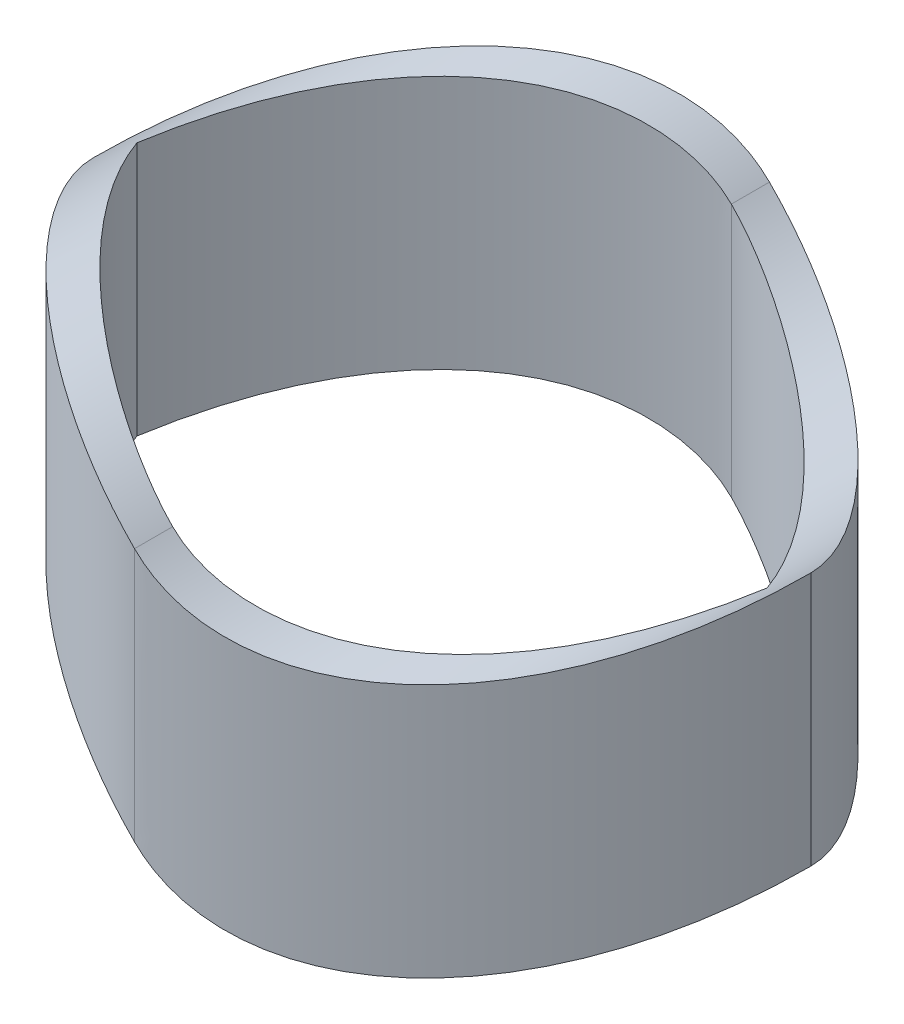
ISO-10303-21;
HEADER;
FILE_DESCRIPTION(('STEP AP214'),'2;1');
FILE_NAME('part.step','',(''),(''),'','','');
FILE_SCHEMA(('AUTOMOTIVE_DESIGN { 1 0 10303 214 1 1 1 1 }'));
ENDSEC;
DATA;
#1=APPLICATION_CONTEXT('core data for automotive mechanical design processes');
#2=APPLICATION_PROTOCOL_DEFINITION('international standard','automotive_design',2000,#1);
#3=PRODUCT_CONTEXT('',#1,'mechanical');
#4=PRODUCT('Part','Part','',(#3));
#5=PRODUCT_RELATED_PRODUCT_CATEGORY('part','',(#4));
#6=PRODUCT_DEFINITION_FORMATION('','',#4);
#7=PRODUCT_DEFINITION_CONTEXT('part definition',#1,'design');
#8=PRODUCT_DEFINITION('design','',#6,#7);
#9=PRODUCT_DEFINITION_SHAPE('','',#8);
#10=(LENGTH_UNIT() NAMED_UNIT(*) SI_UNIT(.MILLI.,.METRE.));
#11=(NAMED_UNIT(*) PLANE_ANGLE_UNIT() SI_UNIT($,.RADIAN.));
#12=(NAMED_UNIT(*) SI_UNIT($,.STERADIAN.) SOLID_ANGLE_UNIT());
#13=UNCERTAINTY_MEASURE_WITH_UNIT(LENGTH_MEASURE(1.E-05),#10,'distance_accuracy_value','');
#14=(GEOMETRIC_REPRESENTATION_CONTEXT(3) GLOBAL_UNCERTAINTY_ASSIGNED_CONTEXT((#13)) GLOBAL_UNIT_ASSIGNED_CONTEXT((#10,
#11,#12)) REPRESENTATION_CONTEXT('',''));
#15=CARTESIAN_POINT('',(0.,0.,0.));
#16=DIRECTION('',(0.,0.,1.));
#17=DIRECTION('',(1.,0.,0.));
#18=AXIS2_PLACEMENT_3D('',#15,#16,#17);
#19=CARTESIAN_POINT('',(9.08947209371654E-12,-30.,25.));
#20=CARTESIAN_POINT('',(0.603244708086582,-30.,24.9999999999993));
#21=CARTESIAN_POINT('',(1.24222668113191,-30.,24.9320459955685));
#22=CARTESIAN_POINT('',(2.25417530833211,-30.,24.7284316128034));
#23=CARTESIAN_POINT('',(2.60129691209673,-30.,24.6431152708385));
#24=CARTESIAN_POINT('',(3.29575924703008,-30.,24.4438463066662));
#25=CARTESIAN_POINT('',(3.64519442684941,-30.,24.3295614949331));
#26=CARTESIAN_POINT('',(4.69959711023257,-30.,23.9461786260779));
#27=CARTESIAN_POINT('',(5.41063246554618,-30.,23.6367468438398));
#28=CARTESIAN_POINT('',(6.48796898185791,-30.,23.1009200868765));
#29=CARTESIAN_POINT('',(6.84984493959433,-30.,22.90973322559));
#30=CARTESIAN_POINT('',(7.5687870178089,-30.,22.5091094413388));
#31=CARTESIAN_POINT('',(7.92661601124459,-30.,22.2993512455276));
#32=CARTESIAN_POINT('',(8.99557323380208,-30.,21.6440180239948));
#33=CARTESIAN_POINT('',(9.70345018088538,-30.,21.1714081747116));
#34=CARTESIAN_POINT('',(11.0916004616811,-30.,20.1783055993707));
#35=CARTESIAN_POINT('',(11.774880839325,-30.,19.6558843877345));
#36=CARTESIAN_POINT('',(13.1178717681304,-30.,18.5698479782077));
#37=CARTESIAN_POINT('',(13.7740082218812,-30.,18.0091879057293));
#38=CARTESIAN_POINT('',(15.0596225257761,-30.,16.8572468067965));
#39=CARTESIAN_POINT('',(15.6902804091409,-30.,16.2647413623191));
#40=CARTESIAN_POINT('',(17.5366071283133,-30.,14.4552195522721));
#41=CARTESIAN_POINT('',(18.7051381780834,-30.,13.2090306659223));
#42=CARTESIAN_POINT('',(20.9384679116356,-30.,10.6503726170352));
#43=CARTESIAN_POINT('',(21.9926027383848,-30.,9.34973977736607));
#44=CARTESIAN_POINT('',(23.9891322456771,-30.,6.71442504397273));
#45=CARTESIAN_POINT('',(24.9330889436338,-30.,5.37679426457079));
#46=CARTESIAN_POINT('',(26.697199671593,-30.,2.69675993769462));
#47=CARTESIAN_POINT('',(27.520627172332,-30.,1.34994475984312));
#48=CARTESIAN_POINT('',(28.2842712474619,-30.,0.));
#49=B_SPLINE_CURVE_WITH_KNOTS('',3,(#19,#20,#21,#22,#23,#24,#25,#26,#27,#28,#29,#30,#31,#32,#33,
#34,#35,#36,#37,#38,#39,#40,#41,#42,#43,#44,#45,#46,#47,#48),.UNSPECIFIED.,.F.,.F.,(4,2,2,2,2,2,
2,2,2,2,2,2,2,2,4),(0.,0.0625000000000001,0.0937500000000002,0.125,0.1875,0.21875,
0.250000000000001,0.312500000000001,0.375000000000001,0.437500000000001,0.500000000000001,0.625,
0.75,0.875,1.),.UNSPECIFIED.);
#50=DIRECTION('',(0.,1.,0.));
#51=VECTOR('',#50,1.);
#52=SURFACE_OF_LINEAR_EXTRUSION('',#49,#51);
#53=CARTESIAN_POINT('',(28.2842712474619,-20.,0.));
#54=CARTESIAN_POINT('',(27.977944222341,-20.3063659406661,0.541549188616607));
#55=CARTESIAN_POINT('',(27.6616723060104,-20.6027959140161,1.08310626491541));
#56=CARTESIAN_POINT('',(27.0089281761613,-21.1757573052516,2.16648712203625));
#57=CARTESIAN_POINT('',(26.672413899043,-21.4522444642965,2.70830896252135));
#58=CARTESIAN_POINT('',(25.9797583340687,-21.9843053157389,3.79081556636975));
#59=CARTESIAN_POINT('',(25.6235926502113,-22.239851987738,4.33149801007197));
#60=CARTESIAN_POINT('',(24.8920952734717,-22.7288922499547,5.41031106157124));
#61=CARTESIAN_POINT('',(24.5167544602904,-22.9623751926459,5.94844031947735));
#62=CARTESIAN_POINT('',(23.7425674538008,-23.4087335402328,7.02726019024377));
#63=CARTESIAN_POINT('',(23.3434925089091,-23.621326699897,7.5679035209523));
#64=CARTESIAN_POINT('',(22.5263756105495,-24.0213684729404,8.64372995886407));
#65=CARTESIAN_POINT('',(22.1083434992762,-24.2088299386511,9.17891572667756));
#66=CARTESIAN_POINT('',(21.4670383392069,-24.4698415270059,9.97645859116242));
#67=CARTESIAN_POINT('',(21.2509617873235,-24.5534595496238,10.2413536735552));
#68=CARTESIAN_POINT('',(20.8139968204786,-24.7137731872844,10.7692783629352));
#69=CARTESIAN_POINT('',(20.5931083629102,-24.7904687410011,11.0323079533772));
#70=CARTESIAN_POINT('',(20.1466616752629,-24.9366881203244,11.5561556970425));
#71=CARTESIAN_POINT('',(19.9211058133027,-25.0062154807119,11.8169748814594));
#72=CARTESIAN_POINT('',(19.465269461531,-25.1379421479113,12.3363121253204));
#73=CARTESIAN_POINT('',(19.2349890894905,-25.20014163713,12.5948302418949));
#74=CARTESIAN_POINT('',(18.6735938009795,-25.340911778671,13.2154626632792));
#75=CARTESIAN_POINT('',(18.3400881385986,-25.4156441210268,13.5762974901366));
#76=CARTESIAN_POINT('',(17.6634909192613,-25.5486932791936,14.2919305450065));
#77=CARTESIAN_POINT('',(17.3204001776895,-25.6070114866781,14.6467292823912));
#78=CARTESIAN_POINT('',(16.7986481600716,-25.6814887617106,15.1737265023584));
#79=CARTESIAN_POINT('',(16.6235303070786,-25.7041491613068,15.3485394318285));
#80=CARTESIAN_POINT('',(16.270951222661,-25.7450276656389,15.6963100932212));
#81=CARTESIAN_POINT('',(16.0934899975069,-25.763245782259,15.8692678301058));
#82=CARTESIAN_POINT('',(15.5585246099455,-25.8108564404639,16.3841971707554));
#83=CARTESIAN_POINT('',(15.1974899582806,-25.8333425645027,16.7231848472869));
#84=CARTESIAN_POINT('',(14.4662372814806,-25.8585885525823,17.391841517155));
#85=CARTESIAN_POINT('',(14.0960197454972,-25.8613494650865,17.7215110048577));
#86=CARTESIAN_POINT('',(13.3466678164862,-25.8455782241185,18.3699108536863));
#87=CARTESIAN_POINT('',(12.9675352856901,-25.8270504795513,18.6886434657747));
#88=CARTESIAN_POINT('',(12.1449737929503,-25.7627721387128,19.3588774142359));
#89=CARTESIAN_POINT('',(11.7002054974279,-25.7134578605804,19.7084126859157));
#90=CARTESIAN_POINT('',(10.8003190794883,-25.5819532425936,20.3875726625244));
#91=CARTESIAN_POINT('',(10.3452007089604,-25.4997621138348,20.7171968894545));
#92=CARTESIAN_POINT('',(9.42652658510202,-25.2996505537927,21.352322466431));
#93=CARTESIAN_POINT('',(8.96297814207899,-25.1817598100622,21.6578435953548));
#94=CARTESIAN_POINT('',(8.0294191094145,-24.9070462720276,22.2401862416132));
#95=CARTESIAN_POINT('',(7.55941088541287,-24.7502373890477,22.5170179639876));
#96=CARTESIAN_POINT('',(6.74457341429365,-24.4430850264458,22.9657524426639));
#97=CARTESIAN_POINT('',(6.40045809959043,-24.3025779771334,23.1457184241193));
#98=CARTESIAN_POINT('',(5.71227603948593,-23.998414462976,23.4851460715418));
#99=CARTESIAN_POINT('',(5.36820929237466,-23.8347597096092,23.6446092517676));
#100=CARTESIAN_POINT('',(4.68317122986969,-23.4839137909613,23.9399961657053));
#101=CARTESIAN_POINT('',(4.34219436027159,-23.2967818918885,24.0759771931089));
#102=CARTESIAN_POINT('',(3.66504484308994,-22.8985346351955,24.3224942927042));
#103=CARTESIAN_POINT('',(3.32887087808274,-22.6874260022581,24.4330374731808));
#104=CARTESIAN_POINT('',(2.86514006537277,-22.3761624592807,24.5678007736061));
#105=CARTESIAN_POINT('',(2.73419150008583,-22.2859864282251,24.6038389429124));
#106=CARTESIAN_POINT('',(2.4737262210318,-22.1020016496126,24.6714387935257));
#107=CARTESIAN_POINT('',(2.34420922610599,-22.0081936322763,24.703001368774));
#108=CARTESIAN_POINT('',(2.08681080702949,-21.8169993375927,24.7615181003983));
#109=CARTESIAN_POINT('',(1.95892916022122,-21.7196135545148,24.7884728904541));
#110=CARTESIAN_POINT('',(1.70499959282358,-21.5213258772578,24.8376538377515));
#111=CARTESIAN_POINT('',(1.57895176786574,-21.4204238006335,24.8598797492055));
#112=CARTESIAN_POINT('',(1.2023443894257,-21.1113521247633,24.9195734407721));
#113=CARTESIAN_POINT('',(0.954828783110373,-20.8979353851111,24.9497128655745));
#114=CARTESIAN_POINT('',(0.591001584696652,-20.5682337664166,24.9798759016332));
#115=CARTESIAN_POINT('',(0.470922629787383,-20.4566928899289,24.9874225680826));
#116=CARTESIAN_POINT('',(0.233426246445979,-20.2305815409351,24.9974856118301));
#117=CARTESIAN_POINT('',(0.1160089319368,-20.1160109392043,25.000001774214));
#118=CARTESIAN_POINT('',(9.08947209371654E-12,-20.0000000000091,25.));
#119=B_SPLINE_CURVE_WITH_KNOTS('',3,(#53,#54,#55,#56,#57,#58,#59,#60,#61,#62,#63,#64,#65,#66,
#67,#68,#69,#70,#71,#72,#73,#74,#75,#76,#77,#78,#79,#80,#81,#82,#83,#84,#85,#86,#87,#88,#89,#90,
#91,#92,#93,#94,#95,#96,#97,#98,#99,#100,#101,#102,#103,#104,#105,#106,#107,#108,#109,#110,#111,
#112,#113,#114,#115,#116,#117,#118),.UNSPECIFIED.,.F.,.F.,(4,2,2,2,2,2,2,2,2,2,2,2,2,2,2,2,2,2,
2,2,2,2,2,2,2,2,2,2,2,2,2,2,4),(0.,2.08043597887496,4.16535537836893,6.25292400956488,
8.34149497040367,10.4552349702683,12.5678898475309,13.6235742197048,14.6792679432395,
15.734438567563,16.7895829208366,18.2802092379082,19.7707091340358,20.5160803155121,
21.2614495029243,22.7481215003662,24.2347144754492,25.7209996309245,27.4231985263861,
29.1254382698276,30.8262663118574,32.5264872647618,33.7643846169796,35.0021904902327,
36.2369322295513,37.4713285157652,37.9603283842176,38.4492304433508,38.9380652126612,
39.4269253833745,40.4103573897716,40.9024478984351,41.3945594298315),.UNSPECIFIED.);
#120=CARTESIAN_POINT('',(28.2842712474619,-20.,0.));
#121=VERTEX_POINT('',#120);
#122=CARTESIAN_POINT('',(9.09832666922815E-12,-20.0000000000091,25.));
#123=VERTEX_POINT('',#122);
#124=EDGE_CURVE('E598',#121,#123,#119,.T.);
#125=ORIENTED_EDGE('',*,*,#124,.F.);
#126=DIRECTION('',(0.,1.,0.));
#127=VECTOR('',#126,1.);
#128=CARTESIAN_POINT('',(28.2842712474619,-30.,0.));
#129=LINE('',#128,#127);
#130=CARTESIAN_POINT('',(28.2842712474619,0.,0.));
#131=VERTEX_POINT('',#130);
#132=EDGE_CURVE('E718',#121,#131,#129,.T.);
#133=ORIENTED_EDGE('',*,*,#132,.T.);
#134=CARTESIAN_POINT('',(28.2842712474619,0.,0.));
#135=CARTESIAN_POINT('',(27.977944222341,-0.30636594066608,0.541549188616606));
#136=CARTESIAN_POINT('',(27.6616723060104,-0.602795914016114,1.08310626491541));
#137=CARTESIAN_POINT('',(27.0089281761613,-1.1757573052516,2.16648712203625));
#138=CARTESIAN_POINT('',(26.672413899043,-1.45224446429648,2.70830896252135));
#139=CARTESIAN_POINT('',(25.9797583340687,-1.9843053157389,3.79081556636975));
#140=CARTESIAN_POINT('',(25.6235926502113,-2.23985198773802,4.33149801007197));
#141=CARTESIAN_POINT('',(24.8920952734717,-2.7288922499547,5.41031106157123));
#142=CARTESIAN_POINT('',(24.5167544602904,-2.96237519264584,5.94844031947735));
#143=CARTESIAN_POINT('',(23.7425674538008,-3.40873354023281,7.02726019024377));
#144=CARTESIAN_POINT('',(23.3434925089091,-3.62132669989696,7.56790352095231));
#145=CARTESIAN_POINT('',(22.5263756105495,-4.02136847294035,8.64372995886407));
#146=CARTESIAN_POINT('',(22.1083434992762,-4.20882993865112,9.17891572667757));
#147=CARTESIAN_POINT('',(21.4670383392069,-4.46984152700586,9.97645859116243));
#148=CARTESIAN_POINT('',(21.2509617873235,-4.55345954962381,10.2413536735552));
#149=CARTESIAN_POINT('',(20.8139968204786,-4.71377318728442,10.7692783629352));
#150=CARTESIAN_POINT('',(20.5931083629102,-4.79046874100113,11.0323079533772));
#151=CARTESIAN_POINT('',(20.1466616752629,-4.93668812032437,11.5561556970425));
#152=CARTESIAN_POINT('',(19.9211058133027,-5.00621548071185,11.8169748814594));
#153=CARTESIAN_POINT('',(19.465269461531,-5.1379421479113,12.3363121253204));
#154=CARTESIAN_POINT('',(19.2349890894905,-5.20014163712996,12.5948302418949));
#155=CARTESIAN_POINT('',(18.6735938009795,-5.34091177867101,13.2154626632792));
#156=CARTESIAN_POINT('',(18.3400881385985,-5.41564412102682,13.5762974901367));
#157=CARTESIAN_POINT('',(17.6634909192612,-5.54869327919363,14.2919305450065));
#158=CARTESIAN_POINT('',(17.3204001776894,-5.6070114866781,14.6467292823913));
#159=CARTESIAN_POINT('',(16.7986481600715,-5.68148876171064,15.1737265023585));
#160=CARTESIAN_POINT('',(16.6235303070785,-5.7041491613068,15.3485394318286));
#161=CARTESIAN_POINT('',(16.2709512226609,-5.7450276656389,15.6963100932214));
#162=CARTESIAN_POINT('',(16.0934899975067,-5.76324578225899,15.8692678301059));
#163=CARTESIAN_POINT('',(15.5585246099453,-5.81085644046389,16.3841971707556));
#164=CARTESIAN_POINT('',(15.1974899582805,-5.83334256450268,16.7231848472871));
#165=CARTESIAN_POINT('',(14.4662372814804,-5.85858855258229,17.3918415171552));
#166=CARTESIAN_POINT('',(14.096019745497,-5.8613494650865,17.7215110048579));
#167=CARTESIAN_POINT('',(13.3466678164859,-5.84557822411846,18.3699108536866));
#168=CARTESIAN_POINT('',(12.9675352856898,-5.82705047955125,18.6886434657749));
#169=CARTESIAN_POINT('',(12.14497379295,-5.7627721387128,19.3588774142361));
#170=CARTESIAN_POINT('',(11.7002054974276,-5.71345786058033,19.7084126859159));
#171=CARTESIAN_POINT('',(10.800319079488,-5.58195324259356,20.3875726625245));
#172=CARTESIAN_POINT('',(10.3452007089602,-5.49976211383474,20.7171968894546));
#173=CARTESIAN_POINT('',(9.42652658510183,-5.29965055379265,21.3523224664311));
#174=CARTESIAN_POINT('',(8.96297814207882,-5.18175981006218,21.6578435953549));
#175=CARTESIAN_POINT('',(8.02941910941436,-4.90704627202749,22.2401862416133));
#176=CARTESIAN_POINT('',(7.55941088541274,-4.75023738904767,22.5170179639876));
#177=CARTESIAN_POINT('',(6.74457341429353,-4.44308502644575,22.965752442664));
#178=CARTESIAN_POINT('',(6.40045809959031,-4.30257797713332,23.1457184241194));
#179=CARTESIAN_POINT('',(5.71227603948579,-3.99841446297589,23.4851460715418));
#180=CARTESIAN_POINT('',(5.36820929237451,-3.83475970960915,23.6446092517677));
#181=CARTESIAN_POINT('',(4.68317122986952,-3.4839137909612,23.9399961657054));
#182=CARTESIAN_POINT('',(4.34219436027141,-3.29678189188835,24.075977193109));
#183=CARTESIAN_POINT('',(3.66504484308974,-2.89853463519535,24.3224942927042));
#184=CARTESIAN_POINT('',(3.32887087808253,-2.68742600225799,24.4330374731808));
#185=CARTESIAN_POINT('',(2.86514006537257,-2.3761624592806,24.5678007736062));
#186=CARTESIAN_POINT('',(2.73419150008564,-2.28598642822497,24.6038389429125));
#187=CARTESIAN_POINT('',(2.47372622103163,-2.10200164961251,24.6714387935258));
#188=CARTESIAN_POINT('',(2.34420922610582,-2.00819363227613,24.7030013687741));
#189=CARTESIAN_POINT('',(2.08681080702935,-1.81699933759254,24.7615181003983));
#190=CARTESIAN_POINT('',(1.95892916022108,-1.71961355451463,24.7884728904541));
#191=CARTESIAN_POINT('',(1.70499959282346,-1.52132587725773,24.8376538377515));
#192=CARTESIAN_POINT('',(1.57895176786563,-1.42042380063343,24.8598797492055));
#193=CARTESIAN_POINT('',(1.20234438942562,-1.11135212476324,24.9195734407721));
#194=CARTESIAN_POINT('',(0.954828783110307,-0.89793538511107,24.9497128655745));
#195=CARTESIAN_POINT('',(0.591001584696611,-0.568233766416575,24.9798759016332));
#196=CARTESIAN_POINT('',(0.47092262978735,-0.456692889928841,24.9874225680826));
#197=CARTESIAN_POINT('',(0.233426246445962,-0.230581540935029,24.9974856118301));
#198=CARTESIAN_POINT('',(0.116008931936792,-0.116010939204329,25.000001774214));
#199=CARTESIAN_POINT('',(9.08947209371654E-12,-9.1177065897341E-12,25.));
#200=B_SPLINE_CURVE_WITH_KNOTS('',3,(#134,#135,#136,#137,#138,#139,#140,#141,#142,#143,#144,
#145,#146,#147,#148,#149,#150,#151,#152,#153,#154,#155,#156,#157,#158,#159,#160,#161,#162,#163,
#164,#165,#166,#167,#168,#169,#170,#171,#172,#173,#174,#175,#176,#177,#178,#179,#180,#181,#182,
#183,#184,#185,#186,#187,#188,#189,#190,#191,#192,#193,#194,#195,#196,#197,#198,#199),
.UNSPECIFIED.,.F.,.F.,(4,2,2,2,2,2,2,2,2,2,2,2,2,2,2,2,2,2,2,2,2,2,2,2,2,2,2,2,2,2,2,2,4),(0.,
2.08043597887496,4.16535537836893,6.25292400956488,8.34149497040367,10.4552349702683,
12.5678898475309,13.6235742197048,14.6792679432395,15.734438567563,16.7895829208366,
18.2802092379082,19.7707091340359,20.5160803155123,21.2614495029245,22.7481215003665,
24.2347144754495,25.7209996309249,27.4231985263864,29.1254382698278,30.8262663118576,
32.5264872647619,33.7643846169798,35.0021904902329,36.2369322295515,37.4713285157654,
37.9603283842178,38.449230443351,38.9380652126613,39.4269253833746,40.4103573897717,
40.9024478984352,41.3945594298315),.UNSPECIFIED.);
#201=CARTESIAN_POINT('',(9.09832666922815E-12,-9.10239204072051E-12,25.0000000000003));
#202=VERTEX_POINT('',#201);
#203=EDGE_CURVE('E749',#131,#202,#200,.T.);
#204=ORIENTED_EDGE('',*,*,#203,.T.);
#205=DIRECTION('',(0.,1.,0.));
#206=VECTOR('',#205,1.);
#207=CARTESIAN_POINT('',(9.09832666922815E-12,-30.,25.));
#208=LINE('',#207,#206);
#209=EDGE_CURVE('E709',#123,#202,#208,.T.);
#210=ORIENTED_EDGE('',*,*,#209,.F.);
#211=EDGE_LOOP('',(#125,#133,#204,#210));
#212=FACE_BOUND('',#211,.T.);
#213=ADVANCED_FACE('F436',(#212),#52,.T.);
#214=CARTESIAN_POINT('',(-28.2842712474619,-30.,0.));
#215=CARTESIAN_POINT('',(-27.5205474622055,-30.,1.35008566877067));
#216=CARTESIAN_POINT('',(-26.6980780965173,-30.,2.69537810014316));
#217=CARTESIAN_POINT('',(-24.9335099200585,-30.,5.37620201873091));
#218=CARTESIAN_POINT('',(-23.9902944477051,-30.,6.71279628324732));
#219=CARTESIAN_POINT('',(-22.4934756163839,-30.,8.68866097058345));
#220=CARTESIAN_POINT('',(-21.9802826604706,-30.,9.3432662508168));
#221=CARTESIAN_POINT('',(-20.9236306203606,-30.,10.6439484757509));
#222=CARTESIAN_POINT('',(-20.3794893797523,-30.,11.2907573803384));
#223=CARTESIAN_POINT('',(-18.7085738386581,-30.,13.2051344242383));
#224=CARTESIAN_POINT('',(-17.5413186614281,-30.,14.4504023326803));
#225=CARTESIAN_POINT('',(-15.6933194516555,-30.,16.2618622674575));
#226=CARTESIAN_POINT('',(-15.0644848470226,-30.,16.8527545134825));
#227=CARTESIAN_POINT('',(-13.7786484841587,-30.,18.0051646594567));
#228=CARTESIAN_POINT('',(-13.1198897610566,-30.,18.5681114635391));
#229=CARTESIAN_POINT('',(-11.7798353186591,-30.,19.6519819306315));
#230=CARTESIAN_POINT('',(-11.0986315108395,-30.,20.1730501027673));
#231=CARTESIAN_POINT('',(-10.0573669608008,-30.,20.9183220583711));
#232=CARTESIAN_POINT('',(-9.70616048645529,-30.,21.1612241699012));
#233=CARTESIAN_POINT('',(-9.00234664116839,-30.,21.6299290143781));
#234=CARTESIAN_POINT('',(-8.64954066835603,-30.,21.8559223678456));
#235=CARTESIAN_POINT('',(-7.58825524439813,-30.,22.5072413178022));
#236=CARTESIAN_POINT('',(-6.87693017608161,-30.,22.906109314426));
#237=CARTESIAN_POINT('',(-5.80324191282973,-30.,23.44211079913));
#238=CARTESIAN_POINT('',(-5.44422427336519,-30.,23.6103501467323));
#239=CARTESIAN_POINT('',(-4.72369996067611,-30.,23.92368663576));
#240=CARTESIAN_POINT('',(-4.36423204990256,-30.,24.0677886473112));
#241=CARTESIAN_POINT('',(-3.3011925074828,-30.,24.4552818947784));
#242=CARTESIAN_POINT('',(-2.60789449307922,-30.,24.6563478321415));
#243=CARTESIAN_POINT('',(-1.59381123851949,-30.,24.8617445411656));
#244=CARTESIAN_POINT('',(-1.25889584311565,-30.,24.9140677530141));
#245=CARTESIAN_POINT('',(-0.613769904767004,-30.,24.9829486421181));
#246=CARTESIAN_POINT('',(-0.301727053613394,-30.,25.0000000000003));
#247=CARTESIAN_POINT('',(9.09832666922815E-12,-30.,25.));
#248=B_SPLINE_CURVE_WITH_KNOTS('',3,(#214,#215,#216,#217,#218,#219,#220,#221,#222,#223,#224,
#225,#226,#227,#228,#229,#230,#231,#232,#233,#234,#235,#236,#237,#238,#239,#240,#241,#242,#243,
#244,#245,#246,#247),.UNSPECIFIED.,.F.,.F.,(4,2,2,2,2,2,2,2,2,2,2,2,2,2,2,2,4),(0.,0.125,0.25,
0.3125,0.375,0.5,0.5625,0.625,0.6875,0.71875,0.75,0.8125,0.84375,0.875,0.9375,0.96875,1.),.UNSPECIFIED.);
#249=DIRECTION('',(0.,1.,0.));
#250=VECTOR('',#249,1.);
#251=SURFACE_OF_LINEAR_EXTRUSION('',#248,#250);
#252=CARTESIAN_POINT('',(9.09832666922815E-12,-20.0000000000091,25.));
#253=CARTESIAN_POINT('',(-0.177611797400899,-19.8223738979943,25.0000126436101));
#254=CARTESIAN_POINT('',(-0.358600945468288,-19.6480923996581,24.9940838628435));
#255=CARTESIAN_POINT('',(-0.726457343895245,-19.3069573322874,24.970465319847));
#256=CARTESIAN_POINT('',(-0.913320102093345,-19.1400983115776,24.95278434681));
#257=CARTESIAN_POINT('',(-1.19755357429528,-18.8957450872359,24.9175348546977));
#258=CARTESIAN_POINT('',(-1.29294821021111,-18.8152883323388,24.9043315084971));
#259=CARTESIAN_POINT('',(-1.48494912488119,-18.6563583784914,24.8751006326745));
#260=CARTESIAN_POINT('',(-1.58155540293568,-18.5778851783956,24.8590731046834));
#261=CARTESIAN_POINT('',(-1.87151896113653,-18.3468052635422,24.8070268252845));
#262=CARTESIAN_POINT('',(-2.06656008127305,-18.1972157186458,24.7668529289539));
#263=CARTESIAN_POINT('',(-2.46038185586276,-17.906439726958,24.6757724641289));
#264=CARTESIAN_POINT('',(-2.65916299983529,-17.7652543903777,24.6248644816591));
#265=CARTESIAN_POINT('',(-3.05974269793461,-17.4915564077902,24.5127158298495));
#266=CARTESIAN_POINT('',(-3.2615412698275,-17.3590438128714,24.4514750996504));
#267=CARTESIAN_POINT('',(-3.75960471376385,-17.044612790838,24.2891654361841));
#268=CARTESIAN_POINT('',(-4.05718318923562,-16.8675612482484,24.1826336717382));
#269=CARTESIAN_POINT('',(-4.65527506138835,-16.5320103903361,23.9505780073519));
#270=CARTESIAN_POINT('',(-4.95578829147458,-16.3735100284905,23.8250551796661));
#271=CARTESIAN_POINT('',(-5.55868474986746,-16.0745432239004,23.5564167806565));
#272=CARTESIAN_POINT('',(-5.86107038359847,-15.9341100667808,23.4132696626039));
#273=CARTESIAN_POINT('',(-6.4657814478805,-15.6710013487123,23.1113329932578));
#274=CARTESIAN_POINT('',(-6.76810684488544,-15.5483302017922,22.9525395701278));
#275=CARTESIAN_POINT('',(-7.55483586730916,-15.2508967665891,22.5200592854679));
#276=CARTESIAN_POINT('',(-8.03831624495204,-15.0897410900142,22.2351618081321));
#277=CARTESIAN_POINT('',(-8.75818904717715,-14.8788135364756,21.7853135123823));
#278=CARTESIAN_POINT('',(-8.99732960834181,-14.8136230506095,21.6315619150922));
#279=CARTESIAN_POINT('',(-9.47360468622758,-14.6930969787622,21.3171212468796));
#280=CARTESIAN_POINT('',(-9.71073883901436,-14.6377631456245,21.1564309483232));
#281=CARTESIAN_POINT('',(-10.4193047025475,-14.4857401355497,20.6645119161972));
#282=CARTESIAN_POINT('',(-10.8872775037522,-14.4032091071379,20.3238263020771));
#283=CARTESIAN_POINT('',(-11.8122703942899,-14.2727685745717,19.6215346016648));
#284=CARTESIAN_POINT('',(-12.2692864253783,-14.2248717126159,19.2599209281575));
#285=CARTESIAN_POINT('',(-13.1812725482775,-14.1599029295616,18.5112562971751));
#286=CARTESIAN_POINT('',(-13.6359749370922,-14.1435345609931,18.1238200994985));
#287=CARTESIAN_POINT('',(-14.5323995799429,-14.1409109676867,17.3338041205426));
#288=CARTESIAN_POINT('',(-14.9741156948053,-14.1546697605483,16.9312173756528));
#289=CARTESIAN_POINT('',(-15.844045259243,-14.2098984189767,16.1134853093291));
#290=CARTESIAN_POINT('',(-16.2722565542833,-14.2513726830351,15.698338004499));
#291=CARTESIAN_POINT('',(-17.1165496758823,-14.3598604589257,14.8561907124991));
#292=CARTESIAN_POINT('',(-17.5325826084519,-14.4269648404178,14.4291536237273));
#293=CARTESIAN_POINT('',(-18.3505492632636,-14.5851854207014,13.5663178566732));
#294=CARTESIAN_POINT('',(-18.7524862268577,-14.6762960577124,13.1305212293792));
#295=CARTESIAN_POINT('',(-19.3449434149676,-14.829577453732,12.47137521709));
#296=CARTESIAN_POINT('',(-19.5406962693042,-14.8834432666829,12.250741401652));
#297=CARTESIAN_POINT('',(-19.9287542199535,-14.9965027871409,11.8078119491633));
#298=CARTESIAN_POINT('',(-20.1210593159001,-15.0556964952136,11.5855163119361));
#299=CARTESIAN_POINT('',(-20.7054682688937,-15.2452024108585,10.9014657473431));
#300=CARTESIAN_POINT('',(-21.0919063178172,-15.3840292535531,10.4371927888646));
#301=CARTESIAN_POINT('',(-21.8500093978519,-15.6825921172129,9.50322322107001));
#302=CARTESIAN_POINT('',(-22.2216713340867,-15.8423324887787,9.03352550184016));
#303=CARTESIAN_POINT('',(-22.9502524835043,-16.1816549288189,8.08962316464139));
#304=CARTESIAN_POINT('',(-23.3071667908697,-16.36124352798,7.6154171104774));
#305=CARTESIAN_POINT('',(-24.0061736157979,-16.7392984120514,6.66342006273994));
#306=CARTESIAN_POINT('',(-24.3482621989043,-16.9377696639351,6.18562815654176));
#307=CARTESIAN_POINT('',(-25.0128179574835,-17.3499064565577,5.23395740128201));
#308=CARTESIAN_POINT('',(-25.3354900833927,-17.5633258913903,4.76011492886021));
#309=CARTESIAN_POINT('',(-25.9660523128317,-18.0069539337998,3.81065589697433));
#310=CARTESIAN_POINT('',(-26.2739460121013,-18.2371584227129,3.33503979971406));
#311=CARTESIAN_POINT('',(-26.8745979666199,-18.7137454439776,2.38288606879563));
#312=CARTESIAN_POINT('',(-27.1673662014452,-18.9601170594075,1.90634926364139));
#313=CARTESIAN_POINT('',(-27.7374019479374,-19.468439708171,0.953206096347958));
#314=CARTESIAN_POINT('',(-28.0146867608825,-19.7303726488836,0.476600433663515));
#315=CARTESIAN_POINT('',(-28.2842712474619,-20.,0.));
#316=B_SPLINE_CURVE_WITH_KNOTS('',3,(#252,#253,#254,#255,#256,#257,#258,#259,#260,#261,#262,
#263,#264,#265,#266,#267,#268,#269,#270,#271,#272,#273,#274,#275,#276,#277,#278,#279,#280,#281,
#282,#283,#284,#285,#286,#287,#288,#289,#290,#291,#292,#293,#294,#295,#296,#297,#298,#299,#300,
#301,#302,#303,#304,#305,#306,#307,#308,#309,#310,#311,#312,#313,#314,#315),.UNSPECIFIED.,.F.,
.F.,(4,2,2,2,2,2,2,2,2,2,2,2,2,2,2,2,2,2,2,2,2,2,2,2,2,2,2,2,2,2,2,4),(0.,0.753507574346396,
1.5064522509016,1.88287502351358,2.25929757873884,3.00603741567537,3.75287568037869,
4.49971834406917,5.58546075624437,6.67114188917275,7.75879539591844,8.8467187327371,
10.5953245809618,11.4701771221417,12.3451850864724,14.097464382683,15.8503829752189,
17.6419840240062,19.4344188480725,21.2271382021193,23.0262734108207,24.8249921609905,
25.7244318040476,26.6238715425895,28.4826453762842,30.3418065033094,32.2015811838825,
34.061846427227,35.8965635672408,37.7308320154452,39.5638743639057,41.3948256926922),.UNSPECIFIED.);
#317=CARTESIAN_POINT('',(-28.2842712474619,-20.0000000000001,0.));
#318=VERTEX_POINT('',#317);
#319=EDGE_CURVE('E458',#123,#318,#316,.T.);
#320=ORIENTED_EDGE('',*,*,#319,.F.);
#321=ORIENTED_EDGE('',*,*,#209,.T.);
#322=CARTESIAN_POINT('',(9.09832666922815E-12,-9.1031104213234E-12,25.));
#323=CARTESIAN_POINT('',(-0.177611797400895,0.177626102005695,25.0000126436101));
#324=CARTESIAN_POINT('',(-0.358600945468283,0.351907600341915,24.9940838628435));
#325=CARTESIAN_POINT('',(-0.726457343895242,0.693042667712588,24.970465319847));
#326=CARTESIAN_POINT('',(-0.913320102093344,0.859901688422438,24.95278434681));
#327=CARTESIAN_POINT('',(-1.19755357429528,1.10425491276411,24.9175348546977));
#328=CARTESIAN_POINT('',(-1.29294821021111,1.18471166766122,24.9043315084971));
#329=CARTESIAN_POINT('',(-1.48494912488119,1.34364162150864,24.8751006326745));
#330=CARTESIAN_POINT('',(-1.58155540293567,1.42211482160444,24.8590731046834));
#331=CARTESIAN_POINT('',(-1.87151896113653,1.65319473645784,24.8070268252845));
#332=CARTESIAN_POINT('',(-2.06656008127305,1.80278428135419,24.7668529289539));
#333=CARTESIAN_POINT('',(-2.46038185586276,2.09356027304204,24.6757724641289));
#334=CARTESIAN_POINT('',(-2.65916299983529,2.23474560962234,24.6248644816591));
#335=CARTESIAN_POINT('',(-3.05974269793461,2.50844359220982,24.5127158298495));
#336=CARTESIAN_POINT('',(-3.2615412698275,2.64095618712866,24.4514750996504));
#337=CARTESIAN_POINT('',(-3.75960471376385,2.95538720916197,24.2891654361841));
#338=CARTESIAN_POINT('',(-4.05718318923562,3.13243875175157,24.1826336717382));
#339=CARTESIAN_POINT('',(-4.65527506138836,3.46798960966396,23.9505780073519));
#340=CARTESIAN_POINT('',(-4.95578829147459,3.62648997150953,23.8250551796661));
#341=CARTESIAN_POINT('',(-5.55868474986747,3.92545677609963,23.5564167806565));
#342=CARTESIAN_POINT('',(-5.86107038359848,4.06588993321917,23.4132696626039));
#343=CARTESIAN_POINT('',(-6.46578144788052,4.32899865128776,23.1113329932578));
#344=CARTESIAN_POINT('',(-6.76810684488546,4.45166979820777,22.9525395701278));
#345=CARTESIAN_POINT('',(-7.55483586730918,4.74910323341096,22.5200592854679));
#346=CARTESIAN_POINT('',(-8.03831624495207,4.91025890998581,22.2351618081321));
#347=CARTESIAN_POINT('',(-8.75818904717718,5.12118646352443,21.7853135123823));
#348=CARTESIAN_POINT('',(-8.99732960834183,5.18637694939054,21.6315619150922));
#349=CARTESIAN_POINT('',(-9.4736046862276,5.30690302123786,21.3171212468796));
#350=CARTESIAN_POINT('',(-9.71073883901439,5.36223685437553,21.1564309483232));
#351=CARTESIAN_POINT('',(-10.4193047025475,5.51425986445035,20.6645119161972));
#352=CARTESIAN_POINT('',(-10.8872775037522,5.59679089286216,20.3238263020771));
#353=CARTESIAN_POINT('',(-11.8122703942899,5.72723142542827,19.6215346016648));
#354=CARTESIAN_POINT('',(-12.2692864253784,5.77512828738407,19.2599209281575));
#355=CARTESIAN_POINT('',(-13.1812725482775,5.84009707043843,18.5112562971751));
#356=CARTESIAN_POINT('',(-13.6359749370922,5.8564654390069,18.1238200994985));
#357=CARTESIAN_POINT('',(-14.5323995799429,5.85908903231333,17.3338041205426));
#358=CARTESIAN_POINT('',(-14.9741156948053,5.84533023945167,16.9312173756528));
#359=CARTESIAN_POINT('',(-15.844045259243,5.79010158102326,16.1134853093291));
#360=CARTESIAN_POINT('',(-16.2722565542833,5.7486273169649,15.698338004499));
#361=CARTESIAN_POINT('',(-17.1165496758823,5.64013954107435,14.8561907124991));
#362=CARTESIAN_POINT('',(-17.5325826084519,5.57303515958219,14.4291536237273));
#363=CARTESIAN_POINT('',(-18.3505492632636,5.41481457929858,13.5663178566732));
#364=CARTESIAN_POINT('',(-18.7524862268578,5.32370394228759,13.1305212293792));
#365=CARTESIAN_POINT('',(-19.3449434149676,5.17042254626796,12.4713752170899));
#366=CARTESIAN_POINT('',(-19.5406962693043,5.11655673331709,12.250741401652));
#367=CARTESIAN_POINT('',(-19.9287542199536,5.00349721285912,11.8078119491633));
#368=CARTESIAN_POINT('',(-20.1210593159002,4.94430350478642,11.5855163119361));
#369=CARTESIAN_POINT('',(-20.7054682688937,4.75479758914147,10.9014657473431));
#370=CARTESIAN_POINT('',(-21.0919063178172,4.6159707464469,10.4371927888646));
#371=CARTESIAN_POINT('',(-21.8500093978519,4.31740788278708,9.50322322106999));
#372=CARTESIAN_POINT('',(-22.2216713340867,4.15766751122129,9.03352550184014));
#373=CARTESIAN_POINT('',(-22.9502524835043,3.81834507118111,8.08962316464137));
#374=CARTESIAN_POINT('',(-23.3071667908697,3.63875647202,7.61541711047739));
#375=CARTESIAN_POINT('',(-24.0061736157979,3.26070158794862,6.66342006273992));
#376=CARTESIAN_POINT('',(-24.3482621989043,3.06223033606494,6.18562815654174));
#377=CARTESIAN_POINT('',(-25.0128179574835,2.65009354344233,5.23395740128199));
#378=CARTESIAN_POINT('',(-25.3354900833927,2.43667410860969,4.7601149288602));
#379=CARTESIAN_POINT('',(-25.9660523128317,1.9930460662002,3.81065589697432));
#380=CARTESIAN_POINT('',(-26.2739460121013,1.76284157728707,3.33503979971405));
#381=CARTESIAN_POINT('',(-26.8745979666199,1.28625455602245,2.38288606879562));
#382=CARTESIAN_POINT('',(-27.1673662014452,1.03988294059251,1.90634926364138));
#383=CARTESIAN_POINT('',(-27.7374019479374,0.531560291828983,0.953206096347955));
#384=CARTESIAN_POINT('',(-28.0146867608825,0.269627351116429,0.476600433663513));
#385=CARTESIAN_POINT('',(-28.2842712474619,0.,0.));
#386=B_SPLINE_CURVE_WITH_KNOTS('',3,(#322,#323,#324,#325,#326,#327,#328,#329,#330,#331,#332,
#333,#334,#335,#336,#337,#338,#339,#340,#341,#342,#343,#344,#345,#346,#347,#348,#349,#350,#351,
#352,#353,#354,#355,#356,#357,#358,#359,#360,#361,#362,#363,#364,#365,#366,#367,#368,#369,#370,
#371,#372,#373,#374,#375,#376,#377,#378,#379,#380,#381,#382,#383,#384,#385),.UNSPECIFIED.,.F.,
.F.,(4,2,2,2,2,2,2,2,2,2,2,2,2,2,2,2,2,2,2,2,2,2,2,2,2,2,2,2,2,2,2,4),(0.,0.753507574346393,
1.5064522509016,1.88287502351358,2.25929757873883,3.00603741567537,3.75287568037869,
4.49971834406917,5.58546075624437,6.67114188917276,7.75879539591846,8.84671873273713,
10.5953245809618,11.4701771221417,12.3451850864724,14.097464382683,15.850382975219,
17.6419840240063,19.4344188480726,21.2271382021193,23.0262734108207,24.8249921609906,
25.7244318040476,26.6238715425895,28.4826453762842,30.3418065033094,32.2015811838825,
34.061846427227,35.8965635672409,37.7308320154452,39.5638743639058,41.3948256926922),.UNSPECIFIED.);
#387=CARTESIAN_POINT('',(-28.2842712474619,0.,0.));
#388=VERTEX_POINT('',#387);
#389=EDGE_CURVE('E550',#202,#388,#386,.T.);
#390=ORIENTED_EDGE('',*,*,#389,.T.);
#391=DIRECTION('',(0.,1.,0.));
#392=VECTOR('',#391,1.);
#393=CARTESIAN_POINT('',(-28.2842712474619,-30.,0.));
#394=LINE('',#393,#392);
#395=EDGE_CURVE('E714',#318,#388,#394,.T.);
#396=ORIENTED_EDGE('',*,*,#395,.F.);
#397=EDGE_LOOP('',(#320,#321,#390,#396));
#398=FACE_BOUND('',#397,.T.);
#399=ADVANCED_FACE('F701',(#398),#251,.T.);
#400=CARTESIAN_POINT('',(0.,-30.,-25.));
#401=CARTESIAN_POINT('',(-0.306302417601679,-30.,-25.));
#402=CARTESIAN_POINT('',(-0.623792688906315,-30.,-24.982263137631));
#403=CARTESIAN_POINT('',(-1.27205853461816,-30.,-24.9122637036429));
#404=CARTESIAN_POINT('',(-1.60363099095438,-30.,-24.8600702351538));
#405=CARTESIAN_POINT('',(-2.28127304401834,-30.,-24.7221784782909));
#406=CARTESIAN_POINT('',(-2.62769202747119,-30.,-24.6362196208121));
#407=CARTESIAN_POINT('',(-3.32175398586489,-30.,-24.4356559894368));
#408=CARTESIAN_POINT('',(-3.67099080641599,-30.,-24.3207794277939));
#409=CARTESIAN_POINT('',(-4.72480738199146,-30.,-23.9357492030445));
#410=CARTESIAN_POINT('',(-5.43546410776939,-30.,-23.6253878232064));
#411=CARTESIAN_POINT('',(-6.51225997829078,-30.,-23.0883172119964));
#412=CARTESIAN_POINT('',(-6.87386396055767,-30.,-22.8967882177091));
#413=CARTESIAN_POINT('',(-7.59205412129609,-30.,-22.4956747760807));
#414=CARTESIAN_POINT('',(-7.94952144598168,-30.,-22.2857017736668));
#415=CARTESIAN_POINT('',(-9.01743079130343,-30.,-21.6297936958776));
#416=CARTESIAN_POINT('',(-9.72451367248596,-30.,-21.1569842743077));
#417=CARTESIAN_POINT('',(-11.1110640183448,-30.,-20.1637167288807));
#418=CARTESIAN_POINT('',(-11.7937216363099,-30.,-19.6411800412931));
#419=CARTESIAN_POINT('',(-13.1350063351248,-30.,-18.5554456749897));
#420=CARTESIAN_POINT('',(-13.7903591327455,-30.,-17.9949750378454));
#421=CARTESIAN_POINT('',(-15.0745091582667,-30.,-16.8434593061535));
#422=CARTESIAN_POINT('',(-15.7045074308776,-30.,-16.2511663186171));
#423=CARTESIAN_POINT('',(-17.548560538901,-30.,-14.4427554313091));
#424=CARTESIAN_POINT('',(-18.7157879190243,-30.,-13.1973577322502));
#425=CARTESIAN_POINT('',(-20.9467822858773,-30.,-10.6403144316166));
#426=CARTESIAN_POINT('',(-21.9996568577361,-30.,-9.34079949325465));
#427=CARTESIAN_POINT('',(-23.9942474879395,-30.,-6.70730013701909));
#428=CARTESIAN_POINT('',(-24.9372419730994,-30.,-5.37070822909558));
#429=CARTESIAN_POINT('',(-26.6991958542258,-30.,-2.69350331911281));
#430=CARTESIAN_POINT('',(-27.5209125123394,-30.,-1.34944034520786));
#431=CARTESIAN_POINT('',(-28.2842712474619,-30.,0.));
#432=B_SPLINE_CURVE_WITH_KNOTS('',3,(#400,#401,#402,#403,#404,#405,#406,#407,#408,#409,#410,
#411,#412,#413,#414,#415,#416,#417,#418,#419,#420,#421,#422,#423,#424,#425,#426,#427,#428,#429,
#430,#431),.UNSPECIFIED.,.F.,.F.,(4,2,2,2,2,2,2,2,2,2,2,2,2,2,2,4),(0.,0.0312499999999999,
0.0624999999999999,0.0937499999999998,0.125,0.1875,0.21875,0.249999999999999,0.312499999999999,
0.374999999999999,0.437499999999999,0.499999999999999,0.625,0.75,0.875,1.),.UNSPECIFIED.);
#433=DIRECTION('',(0.,1.,0.));
#434=VECTOR('',#433,1.);
#435=SURFACE_OF_LINEAR_EXTRUSION('',#432,#434);
#436=CARTESIAN_POINT('',(-28.2842712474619,-20.0000000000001,0.));
#437=CARTESIAN_POINT('',(-28.1310946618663,-19.8468242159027,-0.270779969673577));
#438=CARTESIAN_POINT('',(-27.9754496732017,-19.6961243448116,-0.541552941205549));
#439=CARTESIAN_POINT('',(-27.6592432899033,-19.3997659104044,-1.08298844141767));
#440=CARTESIAN_POINT('',(-27.4986818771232,-19.2541073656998,-1.35365096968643));
#441=CARTESIAN_POINT('',(-27.0089706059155,-18.8242285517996,-2.16646170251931));
#442=CARTESIAN_POINT('',(-26.6724372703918,-18.5477493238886,-2.70829481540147));
#443=CARTESIAN_POINT('',(-25.9797661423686,-18.0156958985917,-3.79080548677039));
#444=CARTESIAN_POINT('',(-25.6236039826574,-17.7601487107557,-4.33148070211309));
#445=CARTESIAN_POINT('',(-24.8921131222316,-17.2711090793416,-5.41028318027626));
#446=CARTESIAN_POINT('',(-24.5167753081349,-17.0376272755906,-5.94840909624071));
#447=CARTESIAN_POINT('',(-23.7425937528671,-16.5912559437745,-7.02722181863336));
#448=CARTESIAN_POINT('',(-23.3435213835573,-16.3786482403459,-7.56786143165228));
#449=CARTESIAN_POINT('',(-22.5264216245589,-15.9786946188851,-8.6436738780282));
#450=CARTESIAN_POINT('',(-22.1084040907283,-15.7913357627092,-9.17884938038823));
#451=CARTESIAN_POINT('',(-21.2533920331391,-15.4433923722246,-10.2421535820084));
#452=CARTESIAN_POINT('',(-20.8164105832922,-15.2827897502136,-10.7702868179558));
#453=CARTESIAN_POINT('',(-20.1467309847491,-15.0633666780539,-11.5560765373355));
#454=CARTESIAN_POINT('',(-19.9211850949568,-14.9938180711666,-11.8168843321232));
#455=CARTESIAN_POINT('',(-19.4653616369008,-14.8620732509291,-12.3362087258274));
#456=CARTESIAN_POINT('',(-19.2350841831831,-14.7998768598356,-12.5947253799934));
#457=CARTESIAN_POINT('',(-18.6737271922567,-14.6591149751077,-13.2153180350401));
#458=CARTESIAN_POINT('',(-18.3402583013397,-14.5843836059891,-13.576113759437));
#459=CARTESIAN_POINT('',(-17.663735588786,-14.4513405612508,-14.29167191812));
#460=CARTESIAN_POINT('',(-17.3206825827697,-14.3930274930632,-14.6464348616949));
#461=CARTESIAN_POINT('',(-16.7989903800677,-14.3185565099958,-15.1733809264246));
#462=CARTESIAN_POINT('',(-16.6238930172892,-14.2958979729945,-15.3481772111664));
#463=CARTESIAN_POINT('',(-16.2713552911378,-14.2550142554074,-15.6959141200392));
#464=CARTESIAN_POINT('',(-16.0939149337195,-14.2367890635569,-15.8688547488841));
#465=CARTESIAN_POINT('',(-15.5590112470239,-14.1891587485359,-16.3837352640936));
#466=CARTESIAN_POINT('',(-15.1980177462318,-14.1666617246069,-16.7226925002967));
#467=CARTESIAN_POINT('',(-14.4668496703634,-14.1414232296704,-17.3912906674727));
#468=CARTESIAN_POINT('',(-14.0966755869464,-14.1386807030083,-17.7209320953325));
#469=CARTESIAN_POINT('',(-13.3474123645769,-14.1544315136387,-18.3692785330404));
#470=CARTESIAN_POINT('',(-12.9683251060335,-14.1729204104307,-18.6879858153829));
#471=CARTESIAN_POINT('',(-12.1458214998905,-14.2371300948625,-19.3582018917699));
#472=CARTESIAN_POINT('',(-11.70106490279,-14.2864189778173,-19.7077436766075));
#473=CARTESIAN_POINT('',(-10.8012023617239,-14.4178801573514,-20.3869213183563));
#474=CARTESIAN_POINT('',(-10.3460961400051,-14.500053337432,-20.7165566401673));
#475=CARTESIAN_POINT('',(-9.42744717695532,-14.7001294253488,-21.3517063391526));
#476=CARTESIAN_POINT('',(-8.96391174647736,-14.8180026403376,-21.6572404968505));
#477=CARTESIAN_POINT('',(-8.03036616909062,-15.0926292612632,-22.239617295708));
#478=CARTESIAN_POINT('',(-7.56035843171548,-15.2493685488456,-22.51647030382));
#479=CARTESIAN_POINT('',(-6.74557622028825,-15.5564596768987,-22.9652174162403));
#480=CARTESIAN_POINT('',(-6.40151069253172,-15.6969531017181,-23.1451778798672));
#481=CARTESIAN_POINT('',(-5.71342684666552,-16.0010809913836,-23.4846009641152));
#482=CARTESIAN_POINT('',(-5.36940852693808,-16.164713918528,-23.6440649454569));
#483=CARTESIAN_POINT('',(-4.68442082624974,-16.5154720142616,-23.939483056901));
#484=CARTESIAN_POINT('',(-4.34344607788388,-16.702539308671,-24.0754932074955));
#485=CARTESIAN_POINT('',(-3.66635192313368,-17.1006395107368,-24.3220465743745));
#486=CARTESIAN_POINT('',(-3.33023066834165,-17.3116630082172,-24.4325997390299));
#487=CARTESIAN_POINT('',(-2.82258428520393,-17.6522980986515,-24.5801898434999));
#488=CARTESIAN_POINT('',(-2.6481829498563,-17.7733768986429,-24.6273109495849));
#489=CARTESIAN_POINT('',(-2.30203972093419,-18.0220078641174,-24.7135206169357));
#490=CARTESIAN_POINT('',(-2.13029749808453,-18.149559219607,-24.7526101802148));
#491=CARTESIAN_POINT('',(-1.78998043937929,-18.4109692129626,-24.8224123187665));
#492=CARTESIAN_POINT('',(-1.62140515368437,-18.5448269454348,-24.8531260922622));
#493=CARTESIAN_POINT('',(-1.28682538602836,-18.8193949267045,-24.9061659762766));
#494=CARTESIAN_POINT('',(-1.1208426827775,-18.9601417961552,-24.9284401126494));
#495=CARTESIAN_POINT('',(-0.793022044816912,-19.247533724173,-24.9641332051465));
#496=CARTESIAN_POINT('',(-0.631184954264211,-19.3941799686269,-24.9775503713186));
#497=CARTESIAN_POINT('',(-0.312049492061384,-19.6930340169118,-24.9954772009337));
#498=CARTESIAN_POINT('',(-0.15475373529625,-19.8452449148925,-24.9999818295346));
#499=CARTESIAN_POINT('',(0.,-20.0000000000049,-25.));
#500=B_SPLINE_CURVE_WITH_KNOTS('',3,(#436,#437,#438,#439,#440,#441,#442,#443,#444,#445,#446,
#447,#448,#449,#450,#451,#452,#453,#454,#455,#456,#457,#458,#459,#460,#461,#462,#463,#464,#465,
#466,#467,#468,#469,#470,#471,#472,#473,#474,#475,#476,#477,#478,#479,#480,#481,#482,#483,#484,
#485,#486,#487,#488,#489,#490,#491,#492,#493,#494,#495,#496,#497,#498,#499),.UNSPECIFIED.,.F.,
.F.,(4,2,2,2,2,2,2,2,2,2,2,2,2,2,2,2,2,2,2,2,2,2,2,2,2,2,2,2,2,2,2,4),(0.,1.04026664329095,
2.08053712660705,4.16544776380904,6.25300761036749,8.34156898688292,10.4552804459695,
12.5679046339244,14.6790948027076,15.7342496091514,16.7893789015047,18.279847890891,
19.7701904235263,20.5154827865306,21.2607732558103,22.7472929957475,24.2337332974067,
25.719862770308,27.4220384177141,29.1242598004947,30.8250692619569,32.5252617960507,
33.7630105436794,35.0006770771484,36.235345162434,37.4695299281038,38.1217399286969,
38.773868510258,39.4259037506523,40.0818915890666,40.7380119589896,41.3945028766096),.UNSPECIFIED.);
#501=CARTESIAN_POINT('',(0.,-20.0000000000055,-25.));
#502=VERTEX_POINT('',#501);
#503=EDGE_CURVE('E466',#318,#502,#500,.T.);
#504=ORIENTED_EDGE('',*,*,#503,.F.);
#505=ORIENTED_EDGE('',*,*,#395,.T.);
#506=CARTESIAN_POINT('',(-28.2842712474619,0.,0.));
#507=CARTESIAN_POINT('',(-28.1310946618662,0.153175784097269,-0.270779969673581));
#508=CARTESIAN_POINT('',(-27.9754496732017,0.303875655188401,-0.541552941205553));
#509=CARTESIAN_POINT('',(-27.6592432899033,0.600234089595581,-1.08298844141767));
#510=CARTESIAN_POINT('',(-27.4986818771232,0.745892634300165,-1.35365096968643));
#511=CARTESIAN_POINT('',(-27.0089706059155,1.17577144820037,-2.16646170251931));
#512=CARTESIAN_POINT('',(-26.6724372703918,1.45225067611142,-2.70829481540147));
#513=CARTESIAN_POINT('',(-25.9797661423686,1.98430410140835,-3.79080548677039));
#514=CARTESIAN_POINT('',(-25.6236039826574,2.23985128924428,-4.33148070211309));
#515=CARTESIAN_POINT('',(-24.8921131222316,2.72889092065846,-5.41028318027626));
#516=CARTESIAN_POINT('',(-24.5167753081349,2.96237272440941,-5.94840909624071));
#517=CARTESIAN_POINT('',(-23.7425937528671,3.40874405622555,-7.02722181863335));
#518=CARTESIAN_POINT('',(-23.3435213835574,3.62135175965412,-7.56786143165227));
#519=CARTESIAN_POINT('',(-22.5264216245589,4.0213053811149,-8.64367387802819));
#520=CARTESIAN_POINT('',(-22.1084040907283,4.2086642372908,-9.17884938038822));
#521=CARTESIAN_POINT('',(-21.2533920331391,4.55660762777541,-10.2421535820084));
#522=CARTESIAN_POINT('',(-20.8164105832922,4.71721024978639,-10.7702868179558));
#523=CARTESIAN_POINT('',(-20.1467309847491,4.93663332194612,-11.5560765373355));
#524=CARTESIAN_POINT('',(-19.9211850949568,5.00618192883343,-11.8168843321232));
#525=CARTESIAN_POINT('',(-19.4653616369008,5.1379267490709,-12.3362087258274));
#526=CARTESIAN_POINT('',(-19.2350841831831,5.20012314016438,-12.5947253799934));
#527=CARTESIAN_POINT('',(-18.6737271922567,5.34088502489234,-13.2153180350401));
#528=CARTESIAN_POINT('',(-18.3402583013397,5.4156163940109,-13.576113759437));
#529=CARTESIAN_POINT('',(-17.663735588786,5.54865943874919,-14.29167191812));
#530=CARTESIAN_POINT('',(-17.3206825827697,5.60697250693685,-14.6464348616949));
#531=CARTESIAN_POINT('',(-16.7989903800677,5.68144349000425,-15.1733809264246));
#532=CARTESIAN_POINT('',(-16.6238930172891,5.70410202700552,-15.3481772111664));
#533=CARTESIAN_POINT('',(-16.2713552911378,5.74498574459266,-15.6959141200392));
#534=CARTESIAN_POINT('',(-16.0939149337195,5.76321093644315,-15.8688547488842));
#535=CARTESIAN_POINT('',(-15.5590112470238,5.81084125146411,-16.3837352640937));
#536=CARTESIAN_POINT('',(-15.1980177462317,5.83333827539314,-16.7226925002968));
#537=CARTESIAN_POINT('',(-14.4668496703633,5.85857677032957,-17.3912906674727));
#538=CARTESIAN_POINT('',(-14.0966755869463,5.86131929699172,-17.7209320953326));
#539=CARTESIAN_POINT('',(-13.3474123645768,5.8455684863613,-18.3692785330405));
#540=CARTESIAN_POINT('',(-12.9683251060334,5.82707958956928,-18.687985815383));
#541=CARTESIAN_POINT('',(-12.1458214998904,5.76286990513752,-19.35820189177));
#542=CARTESIAN_POINT('',(-11.7010649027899,5.71358102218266,-19.7077436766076));
#543=CARTESIAN_POINT('',(-10.8012023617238,5.58211984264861,-20.3869213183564));
#544=CARTESIAN_POINT('',(-10.346096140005,5.49994666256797,-20.7165566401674));
#545=CARTESIAN_POINT('',(-9.42744717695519,5.29987057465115,-21.3517063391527));
#546=CARTESIAN_POINT('',(-8.96391174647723,5.18199735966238,-21.6572404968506));
#547=CARTESIAN_POINT('',(-8.03036616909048,4.90737073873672,-22.2396172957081));
#548=CARTESIAN_POINT('',(-7.56035843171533,4.75063145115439,-22.51647030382));
#549=CARTESIAN_POINT('',(-6.7455762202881,4.44354032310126,-22.9652174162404));
#550=CARTESIAN_POINT('',(-6.40151069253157,4.30304689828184,-23.1451778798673));
#551=CARTESIAN_POINT('',(-5.71342684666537,3.99891900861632,-23.4846009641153));
#552=CARTESIAN_POINT('',(-5.36940852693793,3.83528608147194,-23.6440649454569));
#553=CARTESIAN_POINT('',(-4.68442082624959,3.48452798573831,-23.9394830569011));
#554=CARTESIAN_POINT('',(-4.34344607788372,3.29746069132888,-24.0754932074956));
#555=CARTESIAN_POINT('',(-3.66635192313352,2.89936048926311,-24.3220465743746));
#556=CARTESIAN_POINT('',(-3.33023066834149,2.6883369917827,-24.43259973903));
#557=CARTESIAN_POINT('',(-2.82258428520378,2.3477019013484,-24.5801898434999));
#558=CARTESIAN_POINT('',(-2.64818294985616,2.22662310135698,-24.6273109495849));
#559=CARTESIAN_POINT('',(-2.30203972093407,1.97799213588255,-24.7135206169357));
#560=CARTESIAN_POINT('',(-2.13029749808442,1.85044078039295,-24.7526101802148));
#561=CARTESIAN_POINT('',(-1.78998043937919,1.58903078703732,-24.8224123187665));
#562=CARTESIAN_POINT('',(-1.62140515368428,1.45517305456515,-24.8531260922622));
#563=CARTESIAN_POINT('',(-1.28682538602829,1.18060507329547,-24.9061659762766));
#564=CARTESIAN_POINT('',(-1.12084268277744,1.03985820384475,-24.9284401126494));
#565=CARTESIAN_POINT('',(-0.793022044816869,0.752466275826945,-24.9641332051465));
#566=CARTESIAN_POINT('',(-0.631184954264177,0.605820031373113,-24.9775503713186));
#567=CARTESIAN_POINT('',(-0.312049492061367,0.306965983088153,-24.9954772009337));
#568=CARTESIAN_POINT('',(-0.154753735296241,0.154755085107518,-24.9999818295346));
#569=CARTESIAN_POINT('',(0.,-4.90579799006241E-12,-25.));
#570=B_SPLINE_CURVE_WITH_KNOTS('',3,(#506,#507,#508,#509,#510,#511,#512,#513,#514,#515,#516,
#517,#518,#519,#520,#521,#522,#523,#524,#525,#526,#527,#528,#529,#530,#531,#532,#533,#534,#535,
#536,#537,#538,#539,#540,#541,#542,#543,#544,#545,#546,#547,#548,#549,#550,#551,#552,#553,#554,
#555,#556,#557,#558,#559,#560,#561,#562,#563,#564,#565,#566,#567,#568,#569),.UNSPECIFIED.,.F.,
.F.,(4,2,2,2,2,2,2,2,2,2,2,2,2,2,2,2,2,2,2,2,2,2,2,2,2,2,2,2,2,2,2,4),(0.,1.04026664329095,
2.08053712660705,4.16544776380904,6.25300761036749,8.34156898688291,10.4552804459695,
12.5679046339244,14.6790948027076,15.7342496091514,16.7893789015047,18.279847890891,
19.7701904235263,20.5154827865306,21.2607732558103,22.7472929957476,24.2337332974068,
25.7198627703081,27.4220384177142,29.1242598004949,30.8250692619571,32.5252617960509,
33.7630105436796,35.0006770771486,36.2353451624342,37.469529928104,38.121739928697,
38.7738685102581,39.4259037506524,40.0818915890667,40.7380119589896,41.3945028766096),.UNSPECIFIED.);
#571=CARTESIAN_POINT('',(9.09832666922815E-12,-9.10239204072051E-12,-25.));
#572=VERTEX_POINT('',#571);
#573=EDGE_CURVE('E755',#388,#572,#570,.T.);
#574=ORIENTED_EDGE('',*,*,#573,.T.);
#575=DIRECTION('',(0.,1.,0.));
#576=VECTOR('',#575,1.);
#577=CARTESIAN_POINT('',(0.,-30.,-25.));
#578=LINE('',#577,#576);
#579=EDGE_CURVE('E716',#502,#572,#578,.T.);
#580=ORIENTED_EDGE('',*,*,#579,.F.);
#581=EDGE_LOOP('',(#504,#505,#574,#580));
#582=FACE_BOUND('',#581,.T.);
#583=ADVANCED_FACE('F576',(#582),#435,.T.);
#584=CARTESIAN_POINT('',(28.2842712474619,-30.,0.));
#585=CARTESIAN_POINT('',(27.5211619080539,-30.,-1.34899947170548));
#586=CARTESIAN_POINT('',(26.6993380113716,-30.,-2.69332482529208));
#587=CARTESIAN_POINT('',(24.9360691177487,-30.,-5.37245279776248));
#588=CARTESIAN_POINT('',(23.9930425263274,-30.,-6.70894443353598));
#589=CARTESIAN_POINT('',(22.4975967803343,-30.,-8.68333237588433));
#590=CARTESIAN_POINT('',(21.9850294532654,-30.,-9.33726103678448));
#591=CARTESIAN_POINT('',(20.9300429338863,-30.,-10.6362157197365));
#592=CARTESIAN_POINT('',(20.3869001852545,-30.,-11.2820745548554));
#593=CARTESIAN_POINT('',(19.271802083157,-30.,-12.5600306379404));
#594=CARTESIAN_POINT('',(18.700627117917,-30.,-13.1913074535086));
#595=CARTESIAN_POINT('',(17.528662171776,-30.,-14.4371229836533));
#596=CARTESIAN_POINT('',(16.9270576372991,-30.,-15.0524292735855));
#597=CARTESIAN_POINT('',(15.6979813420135,-30.,-16.257380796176));
#598=CARTESIAN_POINT('',(15.0699755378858,-30.,-16.8476842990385));
#599=CARTESIAN_POINT('',(13.7836150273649,-30.,-18.0008615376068));
#600=CARTESIAN_POINT('',(13.1258785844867,-30.,-18.5630487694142));
#601=CARTESIAN_POINT('',(11.7884145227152,-30.,-19.6452592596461));
#602=CARTESIAN_POINT('',(11.1072409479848,-30.,-20.1666478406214));
#603=CARTESIAN_POINT('',(9.71641026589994,-30.,-21.1625951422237));
#604=CARTESIAN_POINT('',(9.0160949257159,-30.,-21.6304448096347));
#605=CARTESIAN_POINT('',(7.60435846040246,-30.,-22.4978685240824));
#606=CARTESIAN_POINT('',(6.89295278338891,-30.,-22.8975375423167));
#607=CARTESIAN_POINT('',(5.81592465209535,-30.,-23.4360577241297));
#608=CARTESIAN_POINT('',(5.45363306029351,-30.,-23.6060329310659));
#609=CARTESIAN_POINT('',(4.73413689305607,-30.,-23.9193673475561));
#610=CARTESIAN_POINT('',(4.37755074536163,-30.,-24.0625764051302));
#611=CARTESIAN_POINT('',(3.31771937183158,-30.,-24.4499509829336));
#612=CARTESIAN_POINT('',(2.62433220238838,-30.,-24.6521576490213));
#613=CARTESIAN_POINT('',(1.60679096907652,-30.,-24.8595326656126));
#614=CARTESIAN_POINT('',(1.27267542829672,-30.,-24.9121877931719));
#615=CARTESIAN_POINT('',(0.623726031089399,-30.,-24.9822796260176));
#616=CARTESIAN_POINT('',(0.307595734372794,-30.,-25.));
#617=CARTESIAN_POINT('',(0.,-30.,-25.));
#618=B_SPLINE_CURVE_WITH_KNOTS('',3,(#584,#585,#586,#587,#588,#589,#590,#591,#592,#593,#594,
#595,#596,#597,#598,#599,#600,#601,#602,#603,#604,#605,#606,#607,#608,#609,#610,#611,#612,#613,
#614,#615,#616,#617),.UNSPECIFIED.,.F.,.F.,(4,2,2,2,2,2,2,2,2,2,2,2,2,2,2,2,4),(0.,0.125,0.25,
0.3125,0.374999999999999,0.437499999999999,0.499999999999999,0.562499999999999,
0.624999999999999,0.687499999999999,0.75,0.8125,0.84375,0.875,0.9375,0.96875,1.),.UNSPECIFIED.);
#619=DIRECTION('',(0.,1.,0.));
#620=VECTOR('',#619,1.);
#621=SURFACE_OF_LINEAR_EXTRUSION('',#618,#620);
#622=CARTESIAN_POINT('',(4.53606242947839E-12,-20.0000000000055,-25.));
#623=CARTESIAN_POINT('',(0.177907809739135,-20.1779452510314,-25.0000255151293));
#624=CARTESIAN_POINT('',(0.359190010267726,-20.3525045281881,-24.9940704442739));
#625=CARTESIAN_POINT('',(0.727648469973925,-20.6941681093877,-24.9703648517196));
#626=CARTESIAN_POINT('',(0.914820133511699,-20.8612779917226,-24.9526233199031));
#627=CARTESIAN_POINT('',(1.29442953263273,-21.1875925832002,-24.9055158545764));
#628=CARTESIAN_POINT('',(1.48686596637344,-21.3467992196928,-24.8761527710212));
#629=CARTESIAN_POINT('',(1.87472280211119,-21.6556847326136,-24.8063973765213));
#630=CARTESIAN_POINT('',(2.07010676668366,-21.805429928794,-24.7660956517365));
#631=CARTESIAN_POINT('',(2.46461606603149,-22.0965282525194,-24.6747302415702));
#632=CARTESIAN_POINT('',(2.6637419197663,-22.2378802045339,-24.6236650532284));
#633=CARTESIAN_POINT('',(3.06500416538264,-22.5118867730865,-24.5111706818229));
#634=CARTESIAN_POINT('',(3.26714057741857,-22.6445413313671,-24.4497414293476));
#635=CARTESIAN_POINT('',(3.76564264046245,-22.9590423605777,-24.2870747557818));
#636=CARTESIAN_POINT('',(4.06332012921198,-23.1360357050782,-24.1803911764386));
#637=CARTESIAN_POINT('',(4.66155549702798,-23.4714214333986,-23.9480281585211));
#638=CARTESIAN_POINT('',(4.96211319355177,-23.6298149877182,-23.8223499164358));
#639=CARTESIAN_POINT('',(5.86686429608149,-24.0780449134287,-23.4188470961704));
#640=CARTESIAN_POINT('',(6.47329345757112,-24.3404060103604,-23.1148355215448));
#641=CARTESIAN_POINT('',(7.56218067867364,-24.7516120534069,-22.5158425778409));
#642=CARTESIAN_POINT('',(8.04568326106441,-24.9126232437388,-22.2307287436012));
#643=CARTESIAN_POINT('',(8.76581980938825,-25.123309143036,-21.7804633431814));
#644=CARTESIAN_POINT('',(9.00509423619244,-25.188416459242,-21.6265520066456));
#645=CARTESIAN_POINT('',(9.48157694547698,-25.3087903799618,-21.3118045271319));
#646=CARTESIAN_POINT('',(9.71878514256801,-25.364056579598,-21.1509680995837));
#647=CARTESIAN_POINT('',(10.191271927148,-25.4652337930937,-20.8227440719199));
#648=CARTESIAN_POINT('',(10.4265464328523,-25.511128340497,-20.6553455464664));
#649=CARTESIAN_POINT('',(10.8945164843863,-25.5938675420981,-20.3148472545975));
#650=CARTESIAN_POINT('',(11.1272120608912,-25.6307123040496,-20.1417475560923));
#651=CARTESIAN_POINT('',(11.8211326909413,-25.7282466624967,-19.6146245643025));
#652=CARTESIAN_POINT('',(12.2782853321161,-25.7759560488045,-19.2527120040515));
#653=CARTESIAN_POINT('',(12.9598978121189,-25.8242430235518,-18.6928946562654));
#654=CARTESIAN_POINT('',(13.18886749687,-25.8364596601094,-18.5012974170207));
#655=CARTESIAN_POINT('',(13.6435894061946,-25.8529767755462,-18.1139746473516));
#656=CARTESIAN_POINT('',(13.8693416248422,-25.8572772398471,-17.9182491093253));
#657=CARTESIAN_POINT('',(14.5418441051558,-25.858890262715,-17.3252908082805));
#658=CARTESIAN_POINT('',(14.9836848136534,-25.8449039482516,-16.9224043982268));
#659=CARTESIAN_POINT('',(15.8538243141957,-25.7892440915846,-16.1041120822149));
#660=CARTESIAN_POINT('',(16.2821209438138,-25.7475661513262,-15.6887041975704));
#661=CARTESIAN_POINT('',(17.1265082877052,-25.638647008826,-14.8459705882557));
#662=CARTESIAN_POINT('',(17.542549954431,-25.5713150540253,-14.4186076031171));
#663=CARTESIAN_POINT('',(18.3606308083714,-25.4126313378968,-13.5552336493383));
#664=CARTESIAN_POINT('',(18.7626731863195,-25.3212850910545,-13.1192246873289));
#665=CARTESIAN_POINT('',(19.3552615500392,-25.16763340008,-12.4597481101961));
#666=CARTESIAN_POINT('',(19.5510533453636,-25.113641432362,-12.2390024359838));
#667=CARTESIAN_POINT('',(19.9391718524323,-25.000354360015,-11.7958310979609));
#668=CARTESIAN_POINT('',(20.1314985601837,-24.9410592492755,-11.5734054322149));
#669=CARTESIAN_POINT('',(20.7153595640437,-24.7514542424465,-10.8896745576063));
#670=CARTESIAN_POINT('',(21.1012508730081,-24.6126775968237,-10.4258609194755));
#671=CARTESIAN_POINT('',(21.858267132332,-24.3141129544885,-9.49286503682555));
#672=CARTESIAN_POINT('',(22.2293890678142,-24.1543206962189,-9.02368172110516));
#673=CARTESIAN_POINT('',(22.9569371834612,-23.8150401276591,-8.08080463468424));
#674=CARTESIAN_POINT('',(23.3133584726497,-23.6355453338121,-7.60710942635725));
#675=CARTESIAN_POINT('',(24.0114086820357,-23.2577113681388,-6.65614920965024));
#676=CARTESIAN_POINT('',(24.353033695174,-23.059367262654,-6.1788832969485));
#677=CARTESIAN_POINT('',(25.0167224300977,-22.6475389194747,-5.22825020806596));
#678=CARTESIAN_POINT('',(25.3389900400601,-22.434299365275,-4.75491921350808));
#679=CARTESIAN_POINT('',(25.9687653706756,-21.9910463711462,-3.80649378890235));
#680=CARTESIAN_POINT('',(26.2762766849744,-21.7610370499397,-3.33139981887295));
#681=CARTESIAN_POINT('',(26.8762002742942,-21.2848872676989,-2.38029056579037));
#682=CARTESIAN_POINT('',(27.1686224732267,-21.0387576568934,-1.9042761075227));
#683=CARTESIAN_POINT('',(27.7380029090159,-20.5309640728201,-0.952173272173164));
#684=CARTESIAN_POINT('',(28.0149783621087,-20.2693180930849,-0.476085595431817));
#685=CARTESIAN_POINT('',(28.2842712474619,-20.,0.));
#686=B_SPLINE_CURVE_WITH_KNOTS('',3,(#622,#623,#624,#625,#626,#627,#628,#629,#630,#631,#632,
#633,#634,#635,#636,#637,#638,#639,#640,#641,#642,#643,#644,#645,#646,#647,#648,#649,#650,#651,
#652,#653,#654,#655,#656,#657,#658,#659,#660,#661,#662,#663,#664,#665,#666,#667,#668,#669,#670,
#671,#672,#673,#674,#675,#676,#677,#678,#679,#680,#681,#682,#683,#684,#685),.UNSPECIFIED.,.F.,
.F.,(4,2,2,2,2,2,2,2,2,2,2,2,2,2,2,2,2,2,2,2,2,2,2,2,2,2,2,2,2,2,2,4),(0.,0.754749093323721,
1.50892317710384,2.26291242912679,3.01083874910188,3.75886957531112,4.50690541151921,
5.59290547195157,6.6788371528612,8.85376637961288,10.603228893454,11.4785653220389,
12.3539377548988,13.2308352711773,14.1077223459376,15.8611495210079,16.7574605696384,
17.6537732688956,19.4470024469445,21.2405164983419,23.040435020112,24.8399405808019,
25.7397708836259,26.6396022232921,28.4962864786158,30.3533478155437,32.2110221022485,
34.0691839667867,35.9018857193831,37.7341388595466,39.565171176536,41.3941201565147),.UNSPECIFIED.);
#687=EDGE_CURVE('E590',#502,#121,#686,.T.);
#688=ORIENTED_EDGE('',*,*,#687,.F.);
#689=ORIENTED_EDGE('',*,*,#579,.T.);
#690=CARTESIAN_POINT('',(4.53606242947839E-12,-5.48196564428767E-12,-25.));
#691=CARTESIAN_POINT('',(0.177907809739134,-0.177945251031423,-25.0000255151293));
#692=CARTESIAN_POINT('',(0.359190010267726,-0.352504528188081,-24.9940704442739));
#693=CARTESIAN_POINT('',(0.727648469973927,-0.694168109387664,-24.9703648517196));
#694=CARTESIAN_POINT('',(0.914820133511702,-0.861277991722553,-24.9526233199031));
#695=CARTESIAN_POINT('',(1.29442953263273,-1.18759258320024,-24.9055158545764));
#696=CARTESIAN_POINT('',(1.48686596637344,-1.34679921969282,-24.8761527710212));
#697=CARTESIAN_POINT('',(1.87472280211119,-1.65568473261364,-24.8063973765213));
#698=CARTESIAN_POINT('',(2.07010676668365,-1.80542992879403,-24.7660956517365));
#699=CARTESIAN_POINT('',(2.46461606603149,-2.09652825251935,-24.6747302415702));
#700=CARTESIAN_POINT('',(2.6637419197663,-2.23788020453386,-24.6236650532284));
#701=CARTESIAN_POINT('',(3.06500416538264,-2.51188677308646,-24.5111706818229));
#702=CARTESIAN_POINT('',(3.26714057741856,-2.64454133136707,-24.4497414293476));
#703=CARTESIAN_POINT('',(3.76564264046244,-2.95904236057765,-24.2870747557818));
#704=CARTESIAN_POINT('',(4.06332012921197,-3.13603570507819,-24.1803911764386));
#705=CARTESIAN_POINT('',(4.66155549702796,-3.47142143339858,-23.9480281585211));
#706=CARTESIAN_POINT('',(4.96211319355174,-3.62981498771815,-23.8223499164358));
#707=CARTESIAN_POINT('',(5.86686429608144,-4.07804491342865,-23.4188470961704));
#708=CARTESIAN_POINT('',(6.47329345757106,-4.34040601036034,-23.1148355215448));
#709=CARTESIAN_POINT('',(7.56218067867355,-4.75161205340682,-22.515842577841));
#710=CARTESIAN_POINT('',(8.04568326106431,-4.91262324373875,-22.2307287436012));
#711=CARTESIAN_POINT('',(8.76581980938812,-5.12330914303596,-21.7804633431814));
#712=CARTESIAN_POINT('',(9.0050942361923,-5.18841645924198,-21.6265520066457));
#713=CARTESIAN_POINT('',(9.48157694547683,-5.30879037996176,-21.311804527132));
#714=CARTESIAN_POINT('',(9.71878514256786,-5.36405657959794,-21.1509680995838));
#715=CARTESIAN_POINT('',(10.1912719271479,-5.46523379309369,-20.82274407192));
#716=CARTESIAN_POINT('',(10.4265464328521,-5.51112834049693,-20.6553455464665));
#717=CARTESIAN_POINT('',(10.8945164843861,-5.59386754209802,-20.3148472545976));
#718=CARTESIAN_POINT('',(11.127212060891,-5.63071230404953,-20.1417475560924));
#719=CARTESIAN_POINT('',(11.821132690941,-5.72824666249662,-19.6146245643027));
#720=CARTESIAN_POINT('',(12.2782853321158,-5.77595604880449,-19.2527120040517));
#721=CARTESIAN_POINT('',(12.9598978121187,-5.82424302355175,-18.6928946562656));
#722=CARTESIAN_POINT('',(13.1888674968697,-5.83645966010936,-18.5012974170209));
#723=CARTESIAN_POINT('',(13.6435894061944,-5.85297677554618,-18.1139746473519));
#724=CARTESIAN_POINT('',(13.8693416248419,-5.85727723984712,-17.9182491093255));
#725=CARTESIAN_POINT('',(14.5418441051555,-5.85889026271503,-17.3252908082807));
#726=CARTESIAN_POINT('',(14.9836848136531,-5.84490394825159,-16.922404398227));
#727=CARTESIAN_POINT('',(15.8538243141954,-5.78924409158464,-16.1041120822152));
#728=CARTESIAN_POINT('',(16.2821209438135,-5.74756615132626,-15.6887041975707));
#729=CARTESIAN_POINT('',(17.1265082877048,-5.63864700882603,-14.845970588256));
#730=CARTESIAN_POINT('',(17.5425499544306,-5.57131505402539,-14.4186076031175));
#731=CARTESIAN_POINT('',(18.360630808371,-5.41263133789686,-13.5552336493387));
#732=CARTESIAN_POINT('',(18.7626731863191,-5.32128509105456,-13.1192246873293));
#733=CARTESIAN_POINT('',(19.3552615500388,-5.16763340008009,-12.4597481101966));
#734=CARTESIAN_POINT('',(19.5510533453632,-5.11364143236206,-12.2390024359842));
#735=CARTESIAN_POINT('',(19.9391718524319,-5.00035436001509,-11.7958310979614));
#736=CARTESIAN_POINT('',(20.1314985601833,-4.9410592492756,-11.5734054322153));
#737=CARTESIAN_POINT('',(20.7153595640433,-4.75145424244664,-10.8896745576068));
#738=CARTESIAN_POINT('',(21.1012508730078,-4.61267759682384,-10.4258609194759));
#739=CARTESIAN_POINT('',(21.8582671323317,-4.31411295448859,-9.49286503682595));
#740=CARTESIAN_POINT('',(22.2293890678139,-4.154320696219,-9.02368172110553));
#741=CARTESIAN_POINT('',(22.9569371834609,-3.81504012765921,-8.08080463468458));
#742=CARTESIAN_POINT('',(23.3133584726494,-3.6355453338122,-7.60710942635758));
#743=CARTESIAN_POINT('',(24.0114086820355,-3.25771136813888,-6.65614920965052));
#744=CARTESIAN_POINT('',(24.3530336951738,-3.05936726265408,-6.17888329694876));
#745=CARTESIAN_POINT('',(25.0167224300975,-2.64753891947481,-5.22825020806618));
#746=CARTESIAN_POINT('',(25.33899004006,-2.43429936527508,-4.75491921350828));
#747=CARTESIAN_POINT('',(25.9687653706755,-1.99104637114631,-3.80649378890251));
#748=CARTESIAN_POINT('',(26.2762766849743,-1.76103704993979,-3.3313998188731));
#749=CARTESIAN_POINT('',(26.8762002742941,-1.28488726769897,-2.38029056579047));
#750=CARTESIAN_POINT('',(27.1686224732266,-1.03875765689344,-1.90427610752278));
#751=CARTESIAN_POINT('',(27.7380029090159,-0.530964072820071,-0.952173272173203));
#752=CARTESIAN_POINT('',(28.0149783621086,-0.269318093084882,-0.476085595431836));
#753=CARTESIAN_POINT('',(28.2842712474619,0.,0.));
#754=B_SPLINE_CURVE_WITH_KNOTS('',3,(#690,#691,#692,#693,#694,#695,#696,#697,#698,#699,#700,
#701,#702,#703,#704,#705,#706,#707,#708,#709,#710,#711,#712,#713,#714,#715,#716,#717,#718,#719,
#720,#721,#722,#723,#724,#725,#726,#727,#728,#729,#730,#731,#732,#733,#734,#735,#736,#737,#738,
#739,#740,#741,#742,#743,#744,#745,#746,#747,#748,#749,#750,#751,#752,#753),.UNSPECIFIED.,.F.,
.F.,(4,2,2,2,2,2,2,2,2,2,2,2,2,2,2,2,2,2,2,2,2,2,2,2,2,2,2,2,2,2,2,4),(0.,0.754749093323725,
1.50892317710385,2.2629124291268,3.01083874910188,3.75886957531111,4.50690541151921,
5.59290547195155,6.67883715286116,8.85376637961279,10.6032288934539,11.4785653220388,
12.3539377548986,13.2308352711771,14.1077223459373,15.8611495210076,16.757460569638,
17.6537732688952,19.4470024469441,21.2405164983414,23.0404350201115,24.8399405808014,
25.7397708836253,26.6396022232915,28.4962864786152,30.3533478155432,32.2110221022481,
34.0691839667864,35.9018857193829,37.7341388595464,39.5651711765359,41.3941201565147),.UNSPECIFIED.);
#755=EDGE_CURVE('E582',#572,#131,#754,.T.);
#756=ORIENTED_EDGE('',*,*,#755,.T.);
#757=ORIENTED_EDGE('',*,*,#132,.F.);
#758=EDGE_LOOP('',(#688,#689,#756,#757));
#759=FACE_BOUND('',#758,.T.);
#760=ADVANCED_FACE('F571',(#759),#621,.T.);
#761=CARTESIAN_POINT('',(5.61424258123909E-12,-30.,22.));
#762=CARTESIAN_POINT('',(0.365102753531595,-30.,21.9999999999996));
#763=CARTESIAN_POINT('',(0.721529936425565,-30.,21.9618957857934));
#764=CARTESIAN_POINT('',(1.42450700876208,-30.,21.8423050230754));
#765=CARTESIAN_POINT('',(1.7708877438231,-30.,21.7600755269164));
#766=CARTESIAN_POINT('',(2.79919082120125,-30.,21.465780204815));
#767=CARTESIAN_POINT('',(3.47462565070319,-30.,21.2046613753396));
#768=CARTESIAN_POINT('',(4.77763323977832,-30.,20.6156318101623));
#769=CARTESIAN_POINT('',(5.40789964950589,-30.,20.2866790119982));
#770=CARTESIAN_POINT('',(6.63881547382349,-30.,19.580747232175));
#771=CARTESIAN_POINT('',(7.23924377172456,-30.,19.2034096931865));
#772=CARTESIAN_POINT('',(8.41672865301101,-30.,18.4108356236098));
#773=CARTESIAN_POINT('',(8.99370929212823,-30.,17.9954759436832));
#774=CARTESIAN_POINT('',(10.1280020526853,-30.,17.132862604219));
#775=CARTESIAN_POINT('',(10.686316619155,-30.,16.6846570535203));
#776=CARTESIAN_POINT('',(12.3224379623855,-30.,15.309526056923));
#777=CARTESIAN_POINT('',(13.3653676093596,-30.,14.3498749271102));
#778=CARTESIAN_POINT('',(15.3763709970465,-30.,12.3634199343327));
#779=CARTESIAN_POINT('',(16.3440348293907,-30.,11.3362483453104));
#780=CARTESIAN_POINT('',(18.2129602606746,-30.,9.22233616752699));
#781=CARTESIAN_POINT('',(19.1144570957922,-30.,8.13580660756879));
#782=CARTESIAN_POINT('',(20.8541102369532,-30.,5.90592512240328));
#783=CARTESIAN_POINT('',(21.6925603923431,-30.,4.76283680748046));
#784=CARTESIAN_POINT('',(23.3054469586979,-30.,2.41923387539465));
#785=CARTESIAN_POINT('',(24.0782596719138,-30.,1.22107312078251));
#786=CARTESIAN_POINT('',(24.8117442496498,-30.,-1.52080508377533E-05));
#787=B_SPLINE_CURVE_WITH_KNOTS('',3,(#761,#762,#763,#764,#765,#766,#767,#768,#769,#770,#771,
#772,#773,#774,#775,#776,#777,#778,#779,#780,#781,#782,#783,#784,#785,#786),.UNSPECIFIED.,.F.,
.F.,(4,2,2,2,2,2,2,2,2,2,2,2,4),(0.,0.0312499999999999,0.0624999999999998,0.125,0.1875,0.25,
0.312499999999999,0.374999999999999,0.499999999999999,0.625,0.75,0.875,1.),.UNSPECIFIED.);
#788=DIRECTION('',(0.,1.,0.));
#789=VECTOR('',#788,1.);
#790=SURFACE_OF_LINEAR_EXTRUSION('',#787,#789);
#791=DIRECTION('',(0.,1.,0.));
#792=VECTOR('',#791,1.);
#793=CARTESIAN_POINT('',(24.8117442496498,-30.,-1.52080508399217E-05));
#794=LINE('',#793,#792);
#795=CARTESIAN_POINT('',(24.8117442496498,-22.7740972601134,-1.52080508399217E-05));
#796=VERTEX_POINT('',#795);
#797=CARTESIAN_POINT('',(24.8117442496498,-2.77409726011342,-1.52080508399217E-05));
#798=VERTEX_POINT('',#797);
#799=EDGE_CURVE('E544',#796,#798,#794,.T.);
#800=ORIENTED_EDGE('',*,*,#799,.F.);
#801=CARTESIAN_POINT('',(24.8117442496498,-22.7740972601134,-1.52080508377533E-05));
#802=CARTESIAN_POINT('',(24.4716824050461,-22.9886102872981,0.566106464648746));
#803=CARTESIAN_POINT('',(24.121850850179,-23.1949131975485,1.12950729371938));
#804=CARTESIAN_POINT('',(23.4015731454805,-23.5900859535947,2.25273636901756));
#805=CARTESIAN_POINT('',(23.0310484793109,-23.7788809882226,2.81254055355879));
#806=CARTESIAN_POINT('',(22.2702161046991,-24.1366542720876,3.92709790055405));
#807=CARTESIAN_POINT('',(21.8798644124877,-24.3055854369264,4.48183629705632));
#808=CARTESIAN_POINT('',(21.28003429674,-24.5421708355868,5.30870505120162));
#809=CARTESIAN_POINT('',(21.0776130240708,-24.6182611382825,5.58357711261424));
#810=CARTESIAN_POINT('',(20.668063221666,-24.7645689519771,6.13138051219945));
#811=CARTESIAN_POINT('',(20.460934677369,-24.834786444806,6.40431184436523));
#812=CARTESIAN_POINT('',(20.0395814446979,-24.969900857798,6.95127378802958));
#813=CARTESIAN_POINT('',(19.8253021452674,-25.0347261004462,7.22528004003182));
#814=CARTESIAN_POINT('',(19.3919627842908,-25.1579033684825,7.77096068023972));
#815=CARTESIAN_POINT('',(19.1729027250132,-25.2162553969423,8.04263506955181));
#816=CARTESIAN_POINT('',(18.7302201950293,-25.3260257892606,8.58320617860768));
#817=CARTESIAN_POINT('',(18.5066024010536,-25.3774508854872,8.85210535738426));
#818=CARTESIAN_POINT('',(18.0546204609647,-25.4730740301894,9.38718818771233));
#819=CARTESIAN_POINT('',(17.8262563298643,-25.5172721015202,9.65337184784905));
#820=CARTESIAN_POINT('',(17.3651250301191,-25.5980361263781,10.1824989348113));
#821=CARTESIAN_POINT('',(17.1323635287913,-25.6346112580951,10.4454458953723));
#822=CARTESIAN_POINT('',(16.6621555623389,-25.6999212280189,10.9681164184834));
#823=CARTESIAN_POINT('',(16.4247090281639,-25.7286559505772,11.2278399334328));
#824=CARTESIAN_POINT('',(15.9453141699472,-25.7778579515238,11.7435277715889));
#825=CARTESIAN_POINT('',(15.7033694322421,-25.7983315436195,11.9994948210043));
#826=CARTESIAN_POINT('',(15.2148502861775,-25.8305722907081,12.5075074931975));
#827=CARTESIAN_POINT('',(14.9682761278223,-25.8423399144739,12.7595533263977));
#828=CARTESIAN_POINT('',(14.4452109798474,-25.8574523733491,13.2848760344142));
#829=CARTESIAN_POINT('',(14.1682328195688,-25.8598161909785,13.5576976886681));
#830=CARTESIAN_POINT('',(13.6088806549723,-25.8527366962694,14.0975972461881));
#831=CARTESIAN_POINT('',(13.3265067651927,-25.8432936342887,14.3646752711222));
#832=CARTESIAN_POINT('',(12.7563744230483,-25.811857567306,14.892306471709));
#833=CARTESIAN_POINT('',(12.4686157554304,-25.7898640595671,15.1528593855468));
#834=CARTESIAN_POINT('',(11.8881388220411,-25.7325885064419,15.6664664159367));
#835=CARTESIAN_POINT('',(11.5954243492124,-25.6973162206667,15.919525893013));
#836=CARTESIAN_POINT('',(11.0051456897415,-25.6125864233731,16.41750995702));
#837=CARTESIAN_POINT('',(10.7075814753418,-25.563128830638,16.6624344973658));
#838=CARTESIAN_POINT('',(10.1078763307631,-25.4491242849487,17.1430430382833));
#839=CARTESIAN_POINT('',(9.80573533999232,-25.3845771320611,17.3787269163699));
#840=CARTESIAN_POINT('',(9.27009404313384,-25.2568026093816,17.7845414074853));
#841=CARTESIAN_POINT('',(9.03745541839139,-25.1969500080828,17.9568716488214));
#842=CARTESIAN_POINT('',(8.57003726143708,-25.0675037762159,18.2948203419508));
#843=CARTESIAN_POINT('',(8.33525762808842,-24.9979096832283,18.4604384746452));
#844=CARTESIAN_POINT('',(7.62802409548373,-24.7737598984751,18.9464631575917));
#845=CARTESIAN_POINT('',(7.15269482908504,-24.6038412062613,19.2560253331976));
#846=CARTESIAN_POINT('',(6.43725713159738,-24.3159277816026,19.6929929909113));
#847=CARTESIAN_POINT('',(6.19858539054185,-24.214556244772,19.8339722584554));
#848=CARTESIAN_POINT('',(5.72079279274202,-24.0003633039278,20.1062492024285));
#849=CARTESIAN_POINT('',(5.48167191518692,-23.887541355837,20.2375464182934));
#850=CARTESIAN_POINT('',(5.00376876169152,-23.6500955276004,20.4890755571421));
#851=CARTESIAN_POINT('',(4.76498637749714,-23.5254827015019,20.6093176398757));
#852=CARTESIAN_POINT('',(4.40753383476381,-23.3294644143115,20.7806938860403));
#853=CARTESIAN_POINT('',(4.28850040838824,-23.2626068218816,20.8363226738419));
#854=CARTESIAN_POINT('',(4.05078154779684,-23.1258510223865,20.944500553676));
#855=CARTESIAN_POINT('',(3.93209611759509,-23.055952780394,20.9970496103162));
#856=CARTESIAN_POINT('',(3.5490416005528,-22.824949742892,21.1616621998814));
#857=CARTESIAN_POINT('',(3.2855191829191,-22.6576740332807,21.2671989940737));
#858=CARTESIAN_POINT('',(2.76200781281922,-22.3075247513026,21.459756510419));
#859=CARTESIAN_POINT('',(2.50201905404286,-22.1246503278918,21.5467762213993));
#860=CARTESIAN_POINT('',(2.11642026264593,-21.8393096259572,21.6619769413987));
#861=CARTESIAN_POINT('',(1.9888265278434,-21.742527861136,21.6977755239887));
#862=CARTESIAN_POINT('',(1.73513455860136,-21.5452017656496,21.7639885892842));
#863=CARTESIAN_POINT('',(1.60903637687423,-21.4446573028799,21.7944028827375));
#864=CARTESIAN_POINT('',(1.3586332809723,-21.2399711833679,21.8493846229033));
#865=CARTESIAN_POINT('',(1.23432729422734,-21.135831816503,21.8739557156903));
#866=CARTESIAN_POINT('',(0.987716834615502,-20.924031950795,21.9171335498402));
#867=CARTESIAN_POINT('',(0.865412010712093,-20.8163720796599,21.9357413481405));
#868=CARTESIAN_POINT('',(0.680893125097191,-20.6498785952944,21.9589965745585));
#869=CARTESIAN_POINT('',(0.617867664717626,-20.5922734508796,21.9660676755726));
#870=CARTESIAN_POINT('',(0.492469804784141,-20.4761732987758,21.9782708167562));
#871=CARTESIAN_POINT('',(0.430097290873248,-20.4176784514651,21.9834032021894));
#872=CARTESIAN_POINT('',(0.306014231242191,-20.2998028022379,21.9916561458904));
#873=CARTESIAN_POINT('',(0.244303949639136,-20.2404216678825,21.9947759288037));
#874=CARTESIAN_POINT('',(0.121599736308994,-20.1208237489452,21.9989503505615));
#875=CARTESIAN_POINT('',(0.0606059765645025,-20.060606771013,22.0000045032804));
#876=CARTESIAN_POINT('',(5.61424258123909E-12,-20.0000000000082,22.));
#877=B_SPLINE_CURVE_WITH_KNOTS('',3,(#801,#802,#803,#804,#805,#806,#807,#808,#809,#810,#811,
#812,#813,#814,#815,#816,#817,#818,#819,#820,#821,#822,#823,#824,#825,#826,#827,#828,#829,#830,
#831,#832,#833,#834,#835,#836,#837,#838,#839,#840,#841,#842,#843,#844,#845,#846,#847,#848,#849,
#850,#851,#852,#853,#854,#855,#856,#857,#858,#859,#860,#861,#862,#863,#864,#865,#866,#867,#868,
#869,#870,#871,#872,#873,#874,#875,#876),.UNSPECIFIED.,.F.,.F.,(4,2,2,2,2,2,2,2,2,2,2,2,2,2,2,2,
2,2,2,2,2,2,2,2,2,2,2,2,2,2,2,2,2,2,2,2,2,4),(0.,2.08302961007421,4.17458522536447,
6.27100267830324,7.32015430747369,8.36930918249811,9.43071125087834,10.4921128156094,
11.5524752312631,12.612834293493,13.6719091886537,14.730999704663,15.7892792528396,
16.8475018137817,18.0136105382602,19.1796945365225,20.3458252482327,21.5111005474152,
22.6763825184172,23.8416799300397,24.7283450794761,25.6150523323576,27.3885405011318,
28.2737008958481,29.1589033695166,30.043284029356,30.4854948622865,30.927710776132,
31.9152946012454,32.9029323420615,33.3951176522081,33.8873202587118,34.3792149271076,
34.8710223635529,35.1280292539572,35.384990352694,35.6420503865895,35.8991709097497),.UNSPECIFIED.);
#878=CARTESIAN_POINT('',(9.09832666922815E-12,-20.0000000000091,22.));
#879=VERTEX_POINT('',#878);
#880=EDGE_CURVE('E519',#796,#879,#877,.T.);
#881=ORIENTED_EDGE('',*,*,#880,.T.);
#882=DIRECTION('',(0.,1.,0.));
#883=VECTOR('',#882,1.);
#884=CARTESIAN_POINT('',(5.61424258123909E-12,-30.,22.));
#885=LINE('',#884,#883);
#886=CARTESIAN_POINT('',(5.61424258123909E-12,-7.35869698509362E-12,22.));
#887=VERTEX_POINT('',#886);
#888=EDGE_CURVE('E548',#879,#887,#885,.T.);
#889=ORIENTED_EDGE('',*,*,#888,.T.);
#890=CARTESIAN_POINT('',(24.8117442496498,-2.77409726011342,-1.52080508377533E-05));
#891=CARTESIAN_POINT('',(24.4716824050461,-2.98861028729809,0.566106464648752));
#892=CARTESIAN_POINT('',(24.121850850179,-3.19491319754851,1.12950729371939));
#893=CARTESIAN_POINT('',(23.4015731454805,-3.59008595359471,2.25273636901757));
#894=CARTESIAN_POINT('',(23.0310484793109,-3.77888098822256,2.81254055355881));
#895=CARTESIAN_POINT('',(22.2702161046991,-4.1366542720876,3.92709790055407));
#896=CARTESIAN_POINT('',(21.8798644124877,-4.30558543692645,4.48183629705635));
#897=CARTESIAN_POINT('',(21.28003429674,-4.54217083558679,5.30870505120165));
#898=CARTESIAN_POINT('',(21.0776130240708,-4.61826113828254,5.58357711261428));
#899=CARTESIAN_POINT('',(20.6680632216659,-4.76456895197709,6.13138051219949));
#900=CARTESIAN_POINT('',(20.4609346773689,-4.83478644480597,6.40431184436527));
#901=CARTESIAN_POINT('',(20.0395814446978,-4.96990085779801,6.95127378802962));
#902=CARTESIAN_POINT('',(19.8253021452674,-5.03472610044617,7.22528004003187));
#903=CARTESIAN_POINT('',(19.3919627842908,-5.15790336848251,7.77096068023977));
#904=CARTESIAN_POINT('',(19.1729027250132,-5.21625539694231,8.04263506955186));
#905=CARTESIAN_POINT('',(18.7302201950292,-5.32602578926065,8.58320617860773));
#906=CARTESIAN_POINT('',(18.5066024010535,-5.37745088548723,8.85210535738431));
#907=CARTESIAN_POINT('',(18.0546204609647,-5.47307403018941,9.38718818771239));
#908=CARTESIAN_POINT('',(17.8262563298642,-5.51727210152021,9.65337184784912));
#909=CARTESIAN_POINT('',(17.365125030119,-5.59803612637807,10.1824989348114));
#910=CARTESIAN_POINT('',(17.1323635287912,-5.63461125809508,10.4454458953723));
#911=CARTESIAN_POINT('',(16.6621555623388,-5.69992122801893,10.9681164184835));
#912=CARTESIAN_POINT('',(16.4247090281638,-5.72865595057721,11.2278399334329));
#913=CARTESIAN_POINT('',(15.9453141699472,-5.77785795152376,11.743527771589));
#914=CARTESIAN_POINT('',(15.7033694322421,-5.79833154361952,11.9994948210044));
#915=CARTESIAN_POINT('',(15.2148502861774,-5.83057229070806,12.5075074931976));
#916=CARTESIAN_POINT('',(14.9682761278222,-5.8423399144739,12.7595533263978));
#917=CARTESIAN_POINT('',(14.4452109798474,-5.85745237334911,13.2848760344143));
#918=CARTESIAN_POINT('',(14.1682328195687,-5.85981619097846,13.5576976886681));
#919=CARTESIAN_POINT('',(13.6088806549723,-5.85273669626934,14.0975972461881));
#920=CARTESIAN_POINT('',(13.3265067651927,-5.84329363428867,14.3646752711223));
#921=CARTESIAN_POINT('',(12.7563744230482,-5.81185756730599,14.892306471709));
#922=CARTESIAN_POINT('',(12.4686157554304,-5.7898640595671,15.1528593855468));
#923=CARTESIAN_POINT('',(11.8881388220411,-5.73258850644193,15.6664664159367));
#924=CARTESIAN_POINT('',(11.5954243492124,-5.6973162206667,15.919525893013));
#925=CARTESIAN_POINT('',(11.0051456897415,-5.61258642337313,16.4175099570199));
#926=CARTESIAN_POINT('',(10.7075814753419,-5.56312883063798,16.6624344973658));
#927=CARTESIAN_POINT('',(10.1078763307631,-5.44912428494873,17.1430430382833));
#928=CARTESIAN_POINT('',(9.80573533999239,-5.38457713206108,17.3787269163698));
#929=CARTESIAN_POINT('',(9.27009404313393,-5.2568026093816,17.7845414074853));
#930=CARTESIAN_POINT('',(9.0374554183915,-5.19695000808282,17.9568716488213));
#931=CARTESIAN_POINT('',(8.5700372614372,-5.06750377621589,18.2948203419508));
#932=CARTESIAN_POINT('',(8.33525762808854,-4.99790968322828,18.4604384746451));
#933=CARTESIAN_POINT('',(7.62802409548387,-4.77375989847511,18.9464631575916));
#934=CARTESIAN_POINT('',(7.15269482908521,-4.60384120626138,19.2560253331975));
#935=CARTESIAN_POINT('',(6.43725713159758,-4.31592778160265,19.6929929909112));
#936=CARTESIAN_POINT('',(6.19858539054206,-4.21455624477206,19.8339722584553));
#937=CARTESIAN_POINT('',(5.72079279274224,-4.00036330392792,20.1062492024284));
#938=CARTESIAN_POINT('',(5.48167191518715,-3.88754135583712,20.2375464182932));
#939=CARTESIAN_POINT('',(5.00376876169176,-3.65009552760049,20.4890755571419));
#940=CARTESIAN_POINT('',(4.7649863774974,-3.52548270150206,20.6093176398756));
#941=CARTESIAN_POINT('',(4.40753383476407,-3.32946441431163,20.7806938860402));
#942=CARTESIAN_POINT('',(4.28850040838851,-3.26260682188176,20.8363226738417));
#943=CARTESIAN_POINT('',(4.05078154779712,-3.12585102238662,20.9445005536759));
#944=CARTESIAN_POINT('',(3.93209611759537,-3.05595278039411,20.9970496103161));
#945=CARTESIAN_POINT('',(3.54904160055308,-2.8249497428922,21.1616621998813));
#946=CARTESIAN_POINT('',(3.28551918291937,-2.65767403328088,21.2671989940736));
#947=CARTESIAN_POINT('',(2.76200781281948,-2.3075247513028,21.4597565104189));
#948=CARTESIAN_POINT('',(2.50201905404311,-2.12465032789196,21.5467762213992));
#949=CARTESIAN_POINT('',(2.11642026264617,-1.83930962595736,21.6619769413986));
#950=CARTESIAN_POINT('',(1.98882652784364,-1.7425278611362,21.6977755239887));
#951=CARTESIAN_POINT('',(1.73513455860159,-1.54520176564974,21.7639885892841));
#952=CARTESIAN_POINT('',(1.60903637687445,-1.44465730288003,21.7944028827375));
#953=CARTESIAN_POINT('',(1.35863328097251,-1.23997118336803,21.8493846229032));
#954=CARTESIAN_POINT('',(1.23432729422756,-1.13583181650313,21.8739557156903));
#955=CARTESIAN_POINT('',(0.987716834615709,-0.924031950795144,21.9171335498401));
#956=CARTESIAN_POINT('',(0.865412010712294,-0.816372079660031,21.9357413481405));
#957=CARTESIAN_POINT('',(0.680893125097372,-0.649878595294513,21.9589965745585));
#958=CARTESIAN_POINT('',(0.617867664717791,-0.592273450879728,21.9660676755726));
#959=CARTESIAN_POINT('',(0.492469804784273,-0.476173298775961,21.9782708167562));
#960=CARTESIAN_POINT('',(0.430097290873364,-0.417678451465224,21.9834032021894));
#961=CARTESIAN_POINT('',(0.306014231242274,-0.299802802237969,21.9916561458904));
#962=CARTESIAN_POINT('',(0.244303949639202,-0.240421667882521,21.9947759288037));
#963=CARTESIAN_POINT('',(0.121599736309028,-0.120823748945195,21.9989503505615));
#964=CARTESIAN_POINT('',(0.0606059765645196,-0.0606067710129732,22.0000045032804));
#965=CARTESIAN_POINT('',(5.61424258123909E-12,-8.2052420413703E-12,22.));
#966=B_SPLINE_CURVE_WITH_KNOTS('',3,(#890,#891,#892,#893,#894,#895,#896,#897,#898,#899,#900,
#901,#902,#903,#904,#905,#906,#907,#908,#909,#910,#911,#912,#913,#914,#915,#916,#917,#918,#919,
#920,#921,#922,#923,#924,#925,#926,#927,#928,#929,#930,#931,#932,#933,#934,#935,#936,#937,#938,
#939,#940,#941,#942,#943,#944,#945,#946,#947,#948,#949,#950,#951,#952,#953,#954,#955,#956,#957,
#958,#959,#960,#961,#962,#963,#964,#965),.UNSPECIFIED.,.F.,.F.,(4,2,2,2,2,2,2,2,2,2,2,2,2,2,2,2,
2,2,2,2,2,2,2,2,2,2,2,2,2,2,2,2,2,2,2,2,2,4),(0.,2.08302961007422,4.1745852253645,
6.27100267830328,7.32015430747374,8.36930918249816,9.4307112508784,10.4921128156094,
11.5524752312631,12.612834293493,13.6719091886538,14.7309997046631,15.7892792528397,
16.8475018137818,18.0136105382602,19.1796945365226,20.3458252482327,21.5111005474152,
22.6763825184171,23.8416799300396,24.728345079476,25.6150523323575,27.3885405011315,
28.2737008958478,29.1589033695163,30.0432840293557,30.4854948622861,30.9277107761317,
31.9152946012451,32.9029323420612,33.3951176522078,33.8873202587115,34.3792149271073,
34.8710223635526,35.128029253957,35.3849903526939,35.6420503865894,35.8991709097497),.UNSPECIFIED.);
#967=EDGE_CURVE('E739',#798,#887,#966,.T.);
#968=ORIENTED_EDGE('',*,*,#967,.F.);
#969=EDGE_LOOP('',(#800,#881,#889,#968));
#970=FACE_BOUND('',#969,.T.);
#971=ADVANCED_FACE('F575',(#970),#790,.F.);
#972=CARTESIAN_POINT('',(-24.811753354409,-30.,2.77410035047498E-07));
#973=CARTESIAN_POINT('',(-23.3457478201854,-30.,2.44061017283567));
#974=CARTESIAN_POINT('',(-21.7364204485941,-30.,4.7741560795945));
#975=CARTESIAN_POINT('',(-19.1228427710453,-30.,8.12538014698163));
#976=CARTESIAN_POINT('',(-18.2176900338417,-30.,9.21708597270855));
#977=CARTESIAN_POINT('',(-16.8056504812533,-30.,10.8140738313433));
#978=CARTESIAN_POINT('',(-16.3252431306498,-30.,11.3402744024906));
#979=CARTESIAN_POINT('',(-15.3492821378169,-30.,12.3732866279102));
#980=CARTESIAN_POINT('',(-14.8535244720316,-30.,12.8803765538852));
#981=CARTESIAN_POINT('',(-13.3418437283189,-30.,14.3720947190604));
#982=CARTESIAN_POINT('',(-12.3016928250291,-30.,15.3273891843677));
#983=CARTESIAN_POINT('',(-10.1419011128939,-30.,17.1417359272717));
#984=CARTESIAN_POINT('',(-9.02289362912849,-30.,18.0015550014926));
#985=CARTESIAN_POINT('',(-7.26051342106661,-30.,19.1897394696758));
#986=CARTESIAN_POINT('',(-6.65890055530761,-30.,19.5686654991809));
#987=CARTESIAN_POINT('',(-5.41834481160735,-30.,20.2813203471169));
#988=CARTESIAN_POINT('',(-4.78048437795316,-30.,20.6141960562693));
#989=CARTESIAN_POINT('',(-3.47860477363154,-30.,21.2029331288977));
#990=CARTESIAN_POINT('',(-2.81267861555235,-30.,21.4614250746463));
#991=CARTESIAN_POINT('',(-1.7760925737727,-30.,21.7589187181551));
#992=CARTESIAN_POINT('',(-1.42497234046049,-30.,21.84231440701));
#993=CARTESIAN_POINT('',(-0.718489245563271,-30.,21.9622089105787));
#994=CARTESIAN_POINT('',(-0.36200775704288,-30.,22.0000000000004));
#995=CARTESIAN_POINT('',(5.61424258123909E-12,-30.,22.));
#996=B_SPLINE_CURVE_WITH_KNOTS('',3,(#972,#973,#974,#975,#976,#977,#978,#979,#980,#981,#982,
#983,#984,#985,#986,#987,#988,#989,#990,#991,#992,#993,#994,#995),.UNSPECIFIED.,.F.,.F.,(4,2,2,
2,2,2,2,2,2,2,2,4),(0.,0.25,0.375,0.4375,0.5,0.625,0.75,0.8125,0.875,0.9375,0.96875,1.),.UNSPECIFIED.);
#997=DIRECTION('',(0.,1.,0.));
#998=VECTOR('',#997,1.);
#999=SURFACE_OF_LINEAR_EXTRUSION('',#996,#998);
#1000=ORIENTED_EDGE('',*,*,#888,.F.);
#1001=CARTESIAN_POINT('',(7.35628462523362E-12,-20.0000000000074,22.));
#1002=CARTESIAN_POINT('',(-0.0958839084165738,-19.9041109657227,22.0000229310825));
#1003=CARTESIAN_POINT('',(-0.192737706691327,-19.8092101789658,21.9973494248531));
#1004=CARTESIAN_POINT('',(-0.388186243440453,-19.6215537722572,21.9869075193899));
#1005=CARTESIAN_POINT('',(-0.486780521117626,-19.5287975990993,21.9791404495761));
#1006=CARTESIAN_POINT('',(-0.685438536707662,-19.3456621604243,21.9588216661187));
#1007=CARTESIAN_POINT('',(-0.785500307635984,-19.2552800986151,21.9462758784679));
#1008=CARTESIAN_POINT('',(-0.9366759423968,-19.1214718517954,21.9242149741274));
#1009=CARTESIAN_POINT('',(-0.987251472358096,-19.0771605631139,21.9163203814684));
#1010=CARTESIAN_POINT('',(-1.08875463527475,-18.9891386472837,21.8995115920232));
#1011=CARTESIAN_POINT('',(-1.13968226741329,-18.9454280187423,21.8905973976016));
#1012=CARTESIAN_POINT('',(-1.2922814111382,-18.8157737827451,21.8624302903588));
#1013=CARTESIAN_POINT('',(-1.39443349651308,-18.7307202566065,21.8416557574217));
#1014=CARTESIAN_POINT('',(-1.59986671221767,-18.5630607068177,21.7962429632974));
#1015=CARTESIAN_POINT('',(-1.70314779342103,-18.4804545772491,21.7716048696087));
#1016=CARTESIAN_POINT('',(-1.91079501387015,-18.3177314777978,21.7186224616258));
#1017=CARTESIAN_POINT('',(-2.01516163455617,-18.2376156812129,21.6902764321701));
#1018=CARTESIAN_POINT('',(-2.22481707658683,-18.0799066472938,21.6301683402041));
#1019=CARTESIAN_POINT('',(-2.33010595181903,-18.0023135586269,21.5984060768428));
#1020=CARTESIAN_POINT('',(-2.59435882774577,-17.8115233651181,21.514860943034));
#1021=CARTESIAN_POINT('',(-2.75383198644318,-17.6999275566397,21.4610097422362));
#1022=CARTESIAN_POINT('',(-3.07419655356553,-17.4825892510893,21.3461720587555));
#1023=CARTESIAN_POINT('',(-3.23508806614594,-17.3768471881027,21.2851850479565));
#1024=CARTESIAN_POINT('',(-3.55796384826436,-17.1711892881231,21.1565470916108));
#1025=CARTESIAN_POINT('',(-3.71994830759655,-17.071274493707,21.0888949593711));
#1026=CARTESIAN_POINT('',(-4.04474507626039,-16.8771936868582,20.9476177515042));
#1027=CARTESIAN_POINT('',(-4.20755738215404,-16.7830276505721,20.8739927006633));
#1028=CARTESIAN_POINT('',(-4.53436312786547,-16.6000318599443,20.7207456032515));
#1029=CARTESIAN_POINT('',(-4.69835868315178,-16.511225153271,20.6411005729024));
#1030=CARTESIAN_POINT('',(-5.02659853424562,-16.3392933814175,20.4763945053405));
#1031=CARTESIAN_POINT('',(-5.19084282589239,-16.2561682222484,20.3913335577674));
#1032=CARTESIAN_POINT('',(-5.51935352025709,-16.0954942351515,20.2161457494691));
#1033=CARTESIAN_POINT('',(-5.68361992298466,-16.0179454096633,20.1260188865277));
#1034=CARTESIAN_POINT('',(-6.01199118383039,-15.8682911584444,19.9410707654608));
#1035=CARTESIAN_POINT('',(-6.1760960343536,-15.7961859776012,19.8462492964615));
#1036=CARTESIAN_POINT('',(-6.57730283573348,-15.626188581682,19.608811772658));
#1037=CARTESIAN_POINT('',(-6.81421648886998,-15.531191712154,19.4637919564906));
#1038=CARTESIAN_POINT('',(-7.28679070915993,-15.3519641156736,19.1652919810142));
#1039=CARTESIAN_POINT('',(-7.52245115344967,-15.2677344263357,19.0118110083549));
#1040=CARTESIAN_POINT('',(-7.99227340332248,-15.1094968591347,18.6972994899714));
#1041=CARTESIAN_POINT('',(-8.22643466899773,-15.0354924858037,18.536266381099));
#1042=CARTESIAN_POINT('',(-8.69280350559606,-14.8972973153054,18.2073375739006));
#1043=CARTESIAN_POINT('',(-8.92501113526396,-14.8331062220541,18.0394420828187));
#1044=CARTESIAN_POINT('',(-9.38724531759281,-14.714114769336,17.6972356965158));
#1045=CARTESIAN_POINT('',(-9.61727088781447,-14.6593184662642,17.522922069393));
#1046=CARTESIAN_POINT('',(-10.0748169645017,-14.558690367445,17.1685239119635));
#1047=CARTESIAN_POINT('',(-10.3023374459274,-14.5128586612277,16.9884393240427));
#1048=CARTESIAN_POINT('',(-10.7547329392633,-14.4297313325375,16.6230914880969));
#1049=CARTESIAN_POINT('',(-10.9796081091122,-14.3924351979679,16.4378285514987));
#1050=CARTESIAN_POINT('',(-11.4266531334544,-14.326010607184,16.062642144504));
#1051=CARTESIAN_POINT('',(-11.6488229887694,-14.296882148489,15.8727186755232));
#1052=CARTESIAN_POINT('',(-12.1011075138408,-14.2451709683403,15.4790893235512));
#1053=CARTESIAN_POINT('',(-12.3310764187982,-14.2229800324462,15.2751646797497));
#1054=CARTESIAN_POINT('',(-12.7877107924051,-14.186742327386,14.8629455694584));
#1055=CARTESIAN_POINT('',(-13.0143762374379,-14.1726956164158,14.6546510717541));
#1056=CARTESIAN_POINT('',(-13.4644292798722,-14.1523598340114,14.2339755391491));
#1057=CARTESIAN_POINT('',(-13.6878152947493,-14.1460743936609,14.0215926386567));
#1058=CARTESIAN_POINT('',(-14.1311831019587,-14.1409144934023,13.5932206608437));
#1059=CARTESIAN_POINT('',(-14.3511648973,-14.1420400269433,13.3772315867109));
#1060=CARTESIAN_POINT('',(-14.7877196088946,-14.1513584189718,12.9419090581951));
#1061=CARTESIAN_POINT('',(-15.0042918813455,-14.1595525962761,12.7225749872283));
#1062=CARTESIAN_POINT('',(-15.4339076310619,-14.1827140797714,12.2808342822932));
#1063=CARTESIAN_POINT('',(-15.6469511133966,-14.1976813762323,12.0584276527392));
#1064=CARTESIAN_POINT('',(-16.0701269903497,-14.2341420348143,11.6100706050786));
#1065=CARTESIAN_POINT('',(-16.2802481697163,-14.2556557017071,11.384111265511));
#1066=CARTESIAN_POINT('',(-16.6968996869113,-14.304838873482,10.9295702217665));
#1067=CARTESIAN_POINT('',(-16.9034300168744,-14.3325083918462,10.7009885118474));
#1068=CARTESIAN_POINT('',(-17.3128462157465,-14.3938080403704,10.2414895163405));
#1069=CARTESIAN_POINT('',(-17.5157330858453,-14.4274365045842,10.0105729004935));
#1070=CARTESIAN_POINT('',(-17.9179062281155,-14.5004432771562,9.54653388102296));
#1071=CARTESIAN_POINT('',(-18.1171925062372,-14.5398215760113,9.31341148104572));
#1072=CARTESIAN_POINT('',(-18.709553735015,-14.6662342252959,8.61099418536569));
#1073=CARTESIAN_POINT('',(-19.0971979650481,-14.7615564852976,8.13857405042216));
#1074=CARTESIAN_POINT('',(-19.8088115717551,-14.9586449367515,7.2480133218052));
#1075=CARTESIAN_POINT('',(-20.1345429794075,-15.05799254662,6.83073451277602));
#1076=CARTESIAN_POINT('',(-20.7750492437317,-15.271045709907,5.99147839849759));
#1077=CARTESIAN_POINT('',(-21.0898244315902,-15.3847508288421,5.56950123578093));
#1078=CARTESIAN_POINT('',(-21.7081643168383,-15.6255083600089,4.72112724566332));
#1079=CARTESIAN_POINT('',(-22.0117282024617,-15.7525617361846,4.29473010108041));
#1080=CARTESIAN_POINT('',(-22.6045251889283,-16.0177676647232,3.4421412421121));
#1081=CARTESIAN_POINT('',(-22.8938704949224,-16.1557977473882,3.01598936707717));
#1082=CARTESIAN_POINT('',(-23.4612772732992,-16.4431339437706,2.16006540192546));
#1083=CARTESIAN_POINT('',(-23.7393398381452,-16.5924389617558,1.7302936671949));
#1084=CARTESIAN_POINT('',(-24.2840726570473,-16.9015073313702,0.867527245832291));
#1085=CARTESIAN_POINT('',(-24.5507467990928,-17.0612670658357,0.434533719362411));
#1086=CARTESIAN_POINT('',(-24.811753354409,-17.2258912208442,2.77410035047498E-07));
#1087=B_SPLINE_CURVE_WITH_KNOTS('',3,(#1001,#1002,#1003,#1004,#1005,#1006,#1007,#1008,#1009,
#1010,#1011,#1012,#1013,#1014,#1015,#1016,#1017,#1018,#1019,#1020,#1021,#1022,#1023,#1024,#1025,
#1026,#1027,#1028,#1029,#1030,#1031,#1032,#1033,#1034,#1035,#1036,#1037,#1038,#1039,#1040,#1041,
#1042,#1043,#1044,#1045,#1046,#1047,#1048,#1049,#1050,#1051,#1052,#1053,#1054,#1055,#1056,#1057,
#1058,#1059,#1060,#1061,#1062,#1063,#1064,#1065,#1066,#1067,#1068,#1069,#1070,#1071,#1072,#1073,
#1074,#1075,#1076,#1077,#1078,#1079,#1080,#1081,#1082,#1083,#1084,#1085,#1086),.UNSPECIFIED.,
.F.,.F.,(4,2,2,2,2,2,2,2,2,2,2,2,2,2,2,2,2,2,2,2,2,2,2,2,2,2,2,2,2,2,2,2,2,2,2,2,2,2,2,2,2,2,4),
(0.,0.406757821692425,0.813409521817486,1.21955857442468,1.4226581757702,1.62575730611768,
2.02928065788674,2.43278652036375,2.83647969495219,3.240196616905,3.84582037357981,
4.45148898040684,5.05726561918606,5.66303974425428,6.27125644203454,6.87946307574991,
7.48766997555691,8.09590421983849,8.9762531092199,9.85668677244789,10.7374214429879,
11.6181295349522,12.4992169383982,13.3803131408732,14.2613564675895,15.1423995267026,
16.0667174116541,16.9910419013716,17.9157986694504,18.8405546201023,19.7654831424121,
20.6904103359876,21.6182361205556,22.5460639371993,23.4736327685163,24.4012000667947,
26.2560316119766,27.8715267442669,29.4869730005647,31.1025359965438,32.7020888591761,
34.3014864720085,35.9003336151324),.UNSPECIFIED.);
#1088=CARTESIAN_POINT('',(-24.811753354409,-17.2258912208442,2.77410031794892E-07));
#1089=VERTEX_POINT('',#1088);
#1090=EDGE_CURVE('E683',#879,#1089,#1087,.T.);
#1091=ORIENTED_EDGE('',*,*,#1090,.T.);
#1092=DIRECTION('',(0.,1.,0.));
#1093=VECTOR('',#1092,1.);
#1094=CARTESIAN_POINT('',(-24.811753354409,-30.,2.77410035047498E-07));
#1095=LINE('',#1094,#1093);
#1096=CARTESIAN_POINT('',(-24.811753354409,2.77410877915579,2.77410035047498E-07));
#1097=VERTEX_POINT('',#1096);
#1098=EDGE_CURVE('E538',#1089,#1097,#1095,.T.);
#1099=ORIENTED_EDGE('',*,*,#1098,.T.);
#1100=CARTESIAN_POINT('',(7.35628462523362E-12,-7.35971332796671E-12,22.));
#1101=CARTESIAN_POINT('',(-0.0958839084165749,0.0958890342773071,22.0000229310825));
#1102=CARTESIAN_POINT('',(-0.192737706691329,0.190789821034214,21.9973494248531));
#1103=CARTESIAN_POINT('',(-0.388186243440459,0.378446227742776,21.9869075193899));
#1104=CARTESIAN_POINT('',(-0.486780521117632,0.471202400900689,21.9791404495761));
#1105=CARTESIAN_POINT('',(-0.685438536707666,0.654337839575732,21.9588216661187));
#1106=CARTESIAN_POINT('',(-0.785500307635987,0.744719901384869,21.9462758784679));
#1107=CARTESIAN_POINT('',(-0.936675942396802,0.878528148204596,21.9242149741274));
#1108=CARTESIAN_POINT('',(-0.987251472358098,0.922839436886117,21.9163203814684));
#1109=CARTESIAN_POINT('',(-1.08875463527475,1.01086135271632,21.8995115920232));
#1110=CARTESIAN_POINT('',(-1.13968226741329,1.05457198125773,21.8905973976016));
#1111=CARTESIAN_POINT('',(-1.2922814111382,1.18422621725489,21.8624302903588));
#1112=CARTESIAN_POINT('',(-1.39443349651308,1.26927974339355,21.8416557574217));
#1113=CARTESIAN_POINT('',(-1.59986671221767,1.43693929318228,21.7962429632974));
#1114=CARTESIAN_POINT('',(-1.70314779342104,1.51954542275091,21.7716048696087));
#1115=CARTESIAN_POINT('',(-1.91079501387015,1.68226852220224,21.7186224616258));
#1116=CARTESIAN_POINT('',(-2.01516163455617,1.76238431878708,21.6902764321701));
#1117=CARTESIAN_POINT('',(-2.22481707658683,1.92009335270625,21.6301683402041));
#1118=CARTESIAN_POINT('',(-2.33010595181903,1.99768644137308,21.5984060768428));
#1119=CARTESIAN_POINT('',(-2.59435882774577,2.18847663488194,21.514860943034));
#1120=CARTESIAN_POINT('',(-2.75383198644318,2.30007244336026,21.4610097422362));
#1121=CARTESIAN_POINT('',(-3.07419655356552,2.51741074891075,21.3461720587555));
#1122=CARTESIAN_POINT('',(-3.23508806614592,2.6231528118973,21.2851850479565));
#1123=CARTESIAN_POINT('',(-3.55796384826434,2.82881071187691,21.1565470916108));
#1124=CARTESIAN_POINT('',(-3.71994830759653,2.92872550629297,21.0888949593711));
#1125=CARTESIAN_POINT('',(-4.04474507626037,3.12280631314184,20.9476177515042));
#1126=CARTESIAN_POINT('',(-4.20755738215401,3.21697234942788,20.8739927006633));
#1127=CARTESIAN_POINT('',(-4.53436312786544,3.39996814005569,20.7207456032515));
#1128=CARTESIAN_POINT('',(-4.69835868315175,3.48877484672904,20.6411005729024));
#1129=CARTESIAN_POINT('',(-5.02659853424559,3.66070661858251,20.4763945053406));
#1130=CARTESIAN_POINT('',(-5.19084282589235,3.74383177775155,20.3913335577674));
#1131=CARTESIAN_POINT('',(-5.51935352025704,3.90450576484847,20.2161457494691));
#1132=CARTESIAN_POINT('',(-5.68361992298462,3.98205459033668,20.1260188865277));
#1133=CARTESIAN_POINT('',(-6.01199118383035,4.13170884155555,19.9410707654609));
#1134=CARTESIAN_POINT('',(-6.17609603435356,4.20381402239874,19.8462492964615));
#1135=CARTESIAN_POINT('',(-6.57730283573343,4.373811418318,19.608811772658));
#1136=CARTESIAN_POINT('',(-6.81421648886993,4.46880828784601,19.4637919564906));
#1137=CARTESIAN_POINT('',(-7.28679070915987,4.64803588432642,19.1652919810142));
#1138=CARTESIAN_POINT('',(-7.52245115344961,4.73226557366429,19.0118110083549));
#1139=CARTESIAN_POINT('',(-7.99227340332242,4.89050314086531,18.6972994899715));
#1140=CARTESIAN_POINT('',(-8.22643466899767,4.96450751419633,18.536266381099));
#1141=CARTESIAN_POINT('',(-8.69280350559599,5.1027026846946,18.2073375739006));
#1142=CARTESIAN_POINT('',(-8.9250111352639,5.16689377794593,18.0394420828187));
#1143=CARTESIAN_POINT('',(-9.38724531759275,5.28588523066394,17.6972356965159));
#1144=CARTESIAN_POINT('',(-9.61727088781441,5.34068153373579,17.522922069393));
#1145=CARTESIAN_POINT('',(-10.0748169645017,5.44130963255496,17.1685239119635));
#1146=CARTESIAN_POINT('',(-10.3023374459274,5.48714133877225,16.9884393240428));
#1147=CARTESIAN_POINT('',(-10.7547329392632,5.57026866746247,16.6230914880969));
#1148=CARTESIAN_POINT('',(-10.9796081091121,5.60756480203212,16.4378285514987));
#1149=CARTESIAN_POINT('',(-11.4266531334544,5.67398939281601,16.0626421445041));
#1150=CARTESIAN_POINT('',(-11.6488229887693,5.70311785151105,15.8727186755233));
#1151=CARTESIAN_POINT('',(-12.1011075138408,5.75482903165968,15.4790893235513));
#1152=CARTESIAN_POINT('',(-12.3310764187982,5.77701996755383,15.2751646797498));
#1153=CARTESIAN_POINT('',(-12.787710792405,5.81325767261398,14.8629455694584));
#1154=CARTESIAN_POINT('',(-13.0143762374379,5.82730438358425,14.6546510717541));
#1155=CARTESIAN_POINT('',(-13.4644292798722,5.84764016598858,14.2339755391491));
#1156=CARTESIAN_POINT('',(-13.6878152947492,5.8539256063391,14.0215926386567));
#1157=CARTESIAN_POINT('',(-14.1311831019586,5.85908550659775,13.5932206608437));
#1158=CARTESIAN_POINT('',(-14.3511648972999,5.8579599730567,13.3772315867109));
#1159=CARTESIAN_POINT('',(-14.7877196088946,5.84864158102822,12.9419090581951));
#1160=CARTESIAN_POINT('',(-15.0042918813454,5.84044740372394,12.7225749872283));
#1161=CARTESIAN_POINT('',(-15.4339076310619,5.81728592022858,12.2808342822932));
#1162=CARTESIAN_POINT('',(-15.6469511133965,5.80231862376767,12.0584276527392));
#1163=CARTESIAN_POINT('',(-16.0701269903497,5.76585796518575,11.6100706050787));
#1164=CARTESIAN_POINT('',(-16.2802481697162,5.74434429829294,11.384111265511));
#1165=CARTESIAN_POINT('',(-16.6968996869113,5.69516112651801,10.9295702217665));
#1166=CARTESIAN_POINT('',(-16.9034300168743,5.66749160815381,10.7009885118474));
#1167=CARTESIAN_POINT('',(-17.3128462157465,5.60619195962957,10.2414895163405));
#1168=CARTESIAN_POINT('',(-17.5157330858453,5.57256349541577,10.0105729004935));
#1169=CARTESIAN_POINT('',(-17.9179062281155,5.49955672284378,9.54653388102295));
#1170=CARTESIAN_POINT('',(-18.1171925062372,5.46017842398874,9.3134114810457));
#1171=CARTESIAN_POINT('',(-18.709553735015,5.33376577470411,8.61099418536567));
#1172=CARTESIAN_POINT('',(-19.0971979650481,5.23844351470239,8.13857405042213));
#1173=CARTESIAN_POINT('',(-19.8088115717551,5.04135506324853,7.24801332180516));
#1174=CARTESIAN_POINT('',(-20.1345429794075,4.94200745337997,6.83073451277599));
#1175=CARTESIAN_POINT('',(-20.7750492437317,4.72895429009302,5.99147839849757));
#1176=CARTESIAN_POINT('',(-21.0898244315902,4.61524917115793,5.56950123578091));
#1177=CARTESIAN_POINT('',(-21.7081643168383,4.37449163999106,4.72112724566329));
#1178=CARTESIAN_POINT('',(-22.0117282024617,4.24743826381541,4.29473010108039));
#1179=CARTESIAN_POINT('',(-22.6045251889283,3.98223233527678,3.44214124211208));
#1180=CARTESIAN_POINT('',(-22.8938704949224,3.84420225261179,3.01598936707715));
#1181=CARTESIAN_POINT('',(-23.4612772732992,3.55686605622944,2.16006540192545));
#1182=CARTESIAN_POINT('',(-23.7393398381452,3.40756103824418,1.73029366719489));
#1183=CARTESIAN_POINT('',(-24.2840726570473,3.09849266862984,0.867527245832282));
#1184=CARTESIAN_POINT('',(-24.5507467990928,2.93873293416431,0.434533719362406));
#1185=CARTESIAN_POINT('',(-24.811753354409,2.77410877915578,2.77410035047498E-07));
#1186=B_SPLINE_CURVE_WITH_KNOTS('',3,(#1100,#1101,#1102,#1103,#1104,#1105,#1106,#1107,#1108,
#1109,#1110,#1111,#1112,#1113,#1114,#1115,#1116,#1117,#1118,#1119,#1120,#1121,#1122,#1123,#1124,
#1125,#1126,#1127,#1128,#1129,#1130,#1131,#1132,#1133,#1134,#1135,#1136,#1137,#1138,#1139,#1140,
#1141,#1142,#1143,#1144,#1145,#1146,#1147,#1148,#1149,#1150,#1151,#1152,#1153,#1154,#1155,#1156,
#1157,#1158,#1159,#1160,#1161,#1162,#1163,#1164,#1165,#1166,#1167,#1168,#1169,#1170,#1171,#1172,
#1173,#1174,#1175,#1176,#1177,#1178,#1179,#1180,#1181,#1182,#1183,#1184,#1185),.UNSPECIFIED.,
.F.,.F.,(4,2,2,2,2,2,2,2,2,2,2,2,2,2,2,2,2,2,2,2,2,2,2,2,2,2,2,2,2,2,2,2,2,2,2,2,2,2,2,2,2,2,4),
(0.,0.406757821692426,0.813409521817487,1.21955857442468,1.4226581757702,1.62575730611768,
2.02928065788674,2.43278652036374,2.83647969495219,3.240196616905,3.84582037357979,
4.45148898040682,5.05726561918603,5.66303974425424,6.2712564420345,6.87946307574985,
7.48766997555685,8.09590421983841,8.97625310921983,9.85668677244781,10.7374214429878,
11.6181295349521,12.4992169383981,13.3803131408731,14.2613564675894,15.1423995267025,
16.066717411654,16.9910419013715,17.9157986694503,18.8405546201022,19.765483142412,
20.6904103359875,21.6182361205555,22.5460639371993,23.4736327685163,24.4012000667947,
26.2560316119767,27.8715267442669,29.4869730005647,31.1025359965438,32.7020888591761,
34.3014864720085,35.9003336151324),.UNSPECIFIED.);
#1187=EDGE_CURVE('E678',#887,#1097,#1186,.T.);
#1188=ORIENTED_EDGE('',*,*,#1187,.F.);
#1189=EDGE_LOOP('',(#1000,#1091,#1099,#1188));
#1190=FACE_BOUND('',#1189,.T.);
#1191=ADVANCED_FACE('F670',(#1190),#999,.F.);
#1192=CARTESIAN_POINT('',(0.,-30.,-22.));
#1193=CARTESIAN_POINT('',(-0.363721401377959,-30.,-22.));
#1194=CARTESIAN_POINT('',(-0.720591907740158,-30.,-21.9620329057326));
#1195=CARTESIAN_POINT('',(-1.42637302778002,-30.,-21.8419856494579));
#1196=CARTESIAN_POINT('',(-1.77513816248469,-30.,-21.7590992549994));
#1197=CARTESIAN_POINT('',(-2.46677574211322,-30.,-21.5606696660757));
#1198=CARTESIAN_POINT('',(-2.80940455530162,-30.,-21.4448131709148));
#1199=CARTESIAN_POINT('',(-3.47941552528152,-30.,-21.1917120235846));
#1200=CARTESIAN_POINT('',(-3.80841667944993,-30.,-21.0539175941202));
#1201=CARTESIAN_POINT('',(-4.78112104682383,-30.,-20.6137574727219));
#1202=CARTESIAN_POINT('',(-5.41080909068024,-30.,-20.2851466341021));
#1203=CARTESIAN_POINT('',(-6.64348753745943,-30.,-19.577930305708));
#1204=CARTESIAN_POINT('',(-7.2462962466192,-30.,-19.1989845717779));
#1205=CARTESIAN_POINT('',(-8.43059638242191,-30.,-18.4011738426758));
#1206=CARTESIAN_POINT('',(-9.01250427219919,-30.,-17.9816779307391));
#1207=CARTESIAN_POINT('',(-10.1457529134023,-30.,-17.1188466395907));
#1208=CARTESIAN_POINT('',(-10.698922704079,-30.,-16.6742905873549));
#1209=CARTESIAN_POINT('',(-12.3244147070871,-30.,-15.307399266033));
#1210=CARTESIAN_POINT('',(-13.3629283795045,-30.,-14.3520447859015));
#1211=CARTESIAN_POINT('',(-15.3684402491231,-30.,-12.3714900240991));
#1212=CARTESIAN_POINT('',(-16.3350893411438,-30.,-11.3459487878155));
#1213=CARTESIAN_POINT('',(-18.2044294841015,-30.,-9.23240150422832));
#1214=CARTESIAN_POINT('',(-19.1073740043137,-30.,-8.14464300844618));
#1215=CARTESIAN_POINT('',(-20.8518156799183,-30.,-5.90911326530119));
#1216=CARTESIAN_POINT('',(-21.6948527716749,-30.,-4.75964262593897));
#1217=CARTESIAN_POINT('',(-23.3076468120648,-30.,-2.41589674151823));
#1218=CARTESIAN_POINT('',(-24.0786258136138,-30.,-1.2205118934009));
#1219=CARTESIAN_POINT('',(-24.811753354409,-30.,2.77410031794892E-07));
#1220=B_SPLINE_CURVE_WITH_KNOTS('',3,(#1192,#1193,#1194,#1195,#1196,#1197,#1198,#1199,#1200,
#1201,#1202,#1203,#1204,#1205,#1206,#1207,#1208,#1209,#1210,#1211,#1212,#1213,#1214,#1215,#1216,
#1217,#1218,#1219),.UNSPECIFIED.,.F.,.F.,(4,2,2,2,2,2,2,2,2,2,2,2,2,4),(0.,0.03125,
0.0624999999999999,0.0937499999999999,0.125,0.1875,0.25,0.3125,0.375,0.5,0.625,0.75,0.875,1.),.UNSPECIFIED.);
#1221=DIRECTION('',(0.,1.,0.));
#1222=VECTOR('',#1221,1.);
#1223=SURFACE_OF_LINEAR_EXTRUSION('',#1220,#1222);
#1224=ORIENTED_EDGE('',*,*,#1098,.F.);
#1225=CARTESIAN_POINT('',(-24.811753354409,-17.2258912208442,2.77410031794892E-07));
#1226=CARTESIAN_POINT('',(-24.4717012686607,-17.0114105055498,-0.566141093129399));
#1227=CARTESIAN_POINT('',(-24.1218649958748,-16.8050913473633,-1.12955829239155));
#1228=CARTESIAN_POINT('',(-23.4015615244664,-16.4098879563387,-2.25281088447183));
#1229=CARTESIAN_POINT('',(-23.0310157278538,-16.2210785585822,-2.81262217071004));
#1230=CARTESIAN_POINT('',(-22.2701371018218,-15.8633787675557,-3.92718213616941));
#1231=CARTESIAN_POINT('',(-21.8797602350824,-15.6945357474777,-4.4819160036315));
#1232=CARTESIAN_POINT('',(-21.0798187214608,-15.3790468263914,-5.58462085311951));
#1233=CARTESIAN_POINT('',(-20.6702383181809,-15.2324195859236,-6.13258579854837));
#1234=CARTESIAN_POINT('',(-20.0394544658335,-15.0300770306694,-6.95144042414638));
#1235=CARTESIAN_POINT('',(-19.8251729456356,-14.9652404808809,-7.22544816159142));
#1236=CARTESIAN_POINT('',(-19.3918235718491,-14.8420523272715,-7.77113790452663));
#1237=CARTESIAN_POINT('',(-19.1727557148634,-14.7837007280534,-8.04281990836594));
#1238=CARTESIAN_POINT('',(-18.73005897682,-14.6739289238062,-8.58340381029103));
#1239=CARTESIAN_POINT('',(-18.5064347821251,-14.6225019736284,-8.85230817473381));
#1240=CARTESIAN_POINT('',(-18.0544394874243,-14.5268790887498,-9.38740181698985));
#1241=CARTESIAN_POINT('',(-17.8260684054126,-14.4826831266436,-9.65359110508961));
#1242=CARTESIAN_POINT('',(-17.3649233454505,-14.4019243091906,-10.1827294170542));
#1243=CARTESIAN_POINT('',(-17.1321550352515,-14.3653522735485,-10.4456819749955));
#1244=CARTESIAN_POINT('',(-16.661931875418,-14.3000507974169,-10.9683624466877));
#1245=CARTESIAN_POINT('',(-16.424476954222,-14.27132147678,-11.2280903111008));
#1246=CARTESIAN_POINT('',(-15.9450663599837,-14.222112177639,-11.7437862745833));
#1247=CARTESIAN_POINT('',(-15.7031142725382,-14.2016258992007,-11.9997571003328));
#1248=CARTESIAN_POINT('',(-15.2145805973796,-14.1693853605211,-12.5077789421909));
#1249=CARTESIAN_POINT('',(-14.9679992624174,-14.1576306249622,-12.7598301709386));
#1250=CARTESIAN_POINT('',(-14.4449005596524,-14.142547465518,-13.2851819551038));
#1251=CARTESIAN_POINT('',(-14.1678956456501,-14.1402010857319,-13.558026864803));
#1252=CARTESIAN_POINT('',(-13.6084862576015,-14.1473068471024,-14.0979684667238));
#1253=CARTESIAN_POINT('',(-13.3260818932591,-14.1567587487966,-14.3650652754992));
#1254=CARTESIAN_POINT('',(-12.7558899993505,-14.1881979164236,-14.8927369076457));
#1255=CARTESIAN_POINT('',(-12.4681022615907,-14.2101856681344,-15.1533114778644));
#1256=CARTESIAN_POINT('',(-11.8875664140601,-14.2674606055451,-15.66695684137));
#1257=CARTESIAN_POINT('',(-11.5948220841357,-14.3027380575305,-15.920032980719));
#1258=CARTESIAN_POINT('',(-11.0044858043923,-14.387504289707,-16.4180655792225));
#1259=CARTESIAN_POINT('',(-10.7068938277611,-14.4369931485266,-16.663021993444));
#1260=CARTESIAN_POINT('',(-10.1071481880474,-14.5510228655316,-17.1436502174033));
#1261=CARTESIAN_POINT('',(-9.80499445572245,-14.6155639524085,-17.3793218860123));
#1262=CARTESIAN_POINT('',(-9.03776989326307,-14.798613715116,-17.9604961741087));
#1263=CARTESIAN_POINT('',(-8.5699165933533,-14.927713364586,-18.2991779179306));
#1264=CARTESIAN_POINT('',(-7.86270552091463,-15.1518548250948,-18.7851692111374));
#1265=CARTESIAN_POINT('',(-7.6260000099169,-15.2316757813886,-18.9435333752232));
#1266=CARTESIAN_POINT('',(-7.15113111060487,-15.4020228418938,-19.2521730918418));
#1267=CARTESIAN_POINT('',(-6.91296772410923,-15.4925489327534,-19.4024486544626));
#1268=CARTESIAN_POINT('',(-6.43608390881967,-15.6845262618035,-19.6936968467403));
#1269=CARTESIAN_POINT('',(-6.19736555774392,-15.7859552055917,-19.8346875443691));
#1270=CARTESIAN_POINT('',(-5.71952018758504,-16.0002475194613,-20.1069537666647));
#1271=CARTESIAN_POINT('',(-5.48039318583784,-16.1131104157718,-20.2382296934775));
#1272=CARTESIAN_POINT('',(-5.00248903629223,-16.3506253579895,-20.4897152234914));
#1273=CARTESIAN_POINT('',(-4.7637117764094,-16.4752656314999,-20.6099356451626));
#1274=CARTESIAN_POINT('',(-4.406227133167,-16.6713021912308,-20.781307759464));
#1275=CARTESIAN_POINT('',(-4.28716305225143,-16.7381700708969,-20.8369456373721));
#1276=CARTESIAN_POINT('',(-4.04938704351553,-16.8749633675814,-20.9451214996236));
#1277=CARTESIAN_POINT('',(-3.93067512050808,-16.9448888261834,-20.9976594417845));
#1278=CARTESIAN_POINT('',(-3.5474440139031,-17.1760300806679,-21.1622143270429));
#1279=CARTESIAN_POINT('',(-3.28373061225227,-17.3434393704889,-21.2676437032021));
#1280=CARTESIAN_POINT('',(-2.89102859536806,-17.6061214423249,-21.4120601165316));
#1281=CARTESIAN_POINT('',(-2.76061886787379,-17.6956006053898,-21.4579070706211));
#1282=CARTESIAN_POINT('',(-2.50088305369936,-17.8784360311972,-21.5447488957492));
#1283=CARTESIAN_POINT('',(-2.37155700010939,-17.9717924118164,-21.5857436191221));
#1284=CARTESIAN_POINT('',(-2.11461247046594,-18.1620073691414,-21.6625009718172));
#1285=CARTESIAN_POINT('',(-1.98698984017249,-18.2588537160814,-21.6982800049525));
#1286=CARTESIAN_POINT('',(-1.73327665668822,-18.4563000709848,-21.764447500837));
#1287=CARTESIAN_POINT('',(-1.60718592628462,-18.5568996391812,-21.7948365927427));
#1288=CARTESIAN_POINT('',(-1.35676466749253,-18.7616747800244,-21.8497687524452));
#1289=CARTESIAN_POINT('',(-1.23243320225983,-18.8658483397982,-21.8743150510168));
#1290=CARTESIAN_POINT('',(-0.985774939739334,-19.0777255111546,-21.9174259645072));
#1291=CARTESIAN_POINT('',(-0.863447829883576,-19.1854285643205,-21.9359915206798));
#1292=CARTESIAN_POINT('',(-0.679078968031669,-19.3518203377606,-21.9591671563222));
#1293=CARTESIAN_POINT('',(-0.616223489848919,-19.4092791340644,-21.966202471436));
#1294=CARTESIAN_POINT('',(-0.49116208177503,-19.5250807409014,-21.9783476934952));
#1295=CARTESIAN_POINT('',(-0.428956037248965,-19.5834233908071,-21.9834579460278));
#1296=CARTESIAN_POINT('',(-0.305203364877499,-19.7009901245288,-21.9916788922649));
#1297=CARTESIAN_POINT('',(-0.243656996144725,-19.7602145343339,-21.9947888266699));
#1298=CARTESIAN_POINT('',(-0.121278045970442,-19.8794961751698,-21.9989517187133));
#1299=CARTESIAN_POINT('',(-0.0604456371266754,-19.9395536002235,-22.0000041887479));
#1300=CARTESIAN_POINT('',(0.,-20.0000000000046,-22.));
#1301=B_SPLINE_CURVE_WITH_KNOTS('',3,(#1225,#1226,#1227,#1228,#1229,#1230,#1231,#1232,#1233,
#1234,#1235,#1236,#1237,#1238,#1239,#1240,#1241,#1242,#1243,#1244,#1245,#1246,#1247,#1248,#1249,
#1250,#1251,#1252,#1253,#1254,#1255,#1256,#1257,#1258,#1259,#1260,#1261,#1262,#1263,#1264,#1265,
#1266,#1267,#1268,#1269,#1270,#1271,#1272,#1273,#1274,#1275,#1276,#1277,#1278,#1279,#1280,#1281,
#1282,#1283,#1284,#1285,#1286,#1287,#1288,#1289,#1290,#1291,#1292,#1293,#1294,#1295,#1296,#1297,
#1298,#1299,#1300),.UNSPECIFIED.,.F.,.F.,(4,2,2,2,2,2,2,2,2,2,2,2,2,2,2,2,2,2,2,2,2,2,2,2,2,2,2,
2,2,2,2,2,2,2,2,2,2,4),(0.,2.08307180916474,4.17467154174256,6.27113835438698,8.36935648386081,
9.43078541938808,10.4922151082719,11.5526032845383,12.6129874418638,13.6720872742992,
14.7312032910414,15.7895083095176,16.8477557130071,18.0139701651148,19.1801609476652,
20.3463969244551,21.5117803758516,22.6771702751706,23.8425778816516,25.6157791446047,
26.5028489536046,27.389917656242,28.2752057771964,29.1604572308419,30.0448329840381,
30.4871406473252,30.9294543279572,31.9174708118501,32.411380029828,32.9053042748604,
33.3976399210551,33.8899180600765,34.3819233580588,34.8738511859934,35.13017925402,
35.3864612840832,35.6428405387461,35.8992805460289),.UNSPECIFIED.);
#1302=CARTESIAN_POINT('',(9.09832666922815E-12,-20.0000000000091,-22.));
#1303=VERTEX_POINT('',#1302);
#1304=EDGE_CURVE('E311',#1089,#1303,#1301,.T.);
#1305=ORIENTED_EDGE('',*,*,#1304,.T.);
#1306=DIRECTION('',(0.,1.,0.));
#1307=VECTOR('',#1306,1.);
#1308=CARTESIAN_POINT('',(0.,-30.,-22.));
#1309=LINE('',#1308,#1307);
#1310=CARTESIAN_POINT('',(0.,-4.57966997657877E-12,-22.));
#1311=VERTEX_POINT('',#1310);
#1312=EDGE_CURVE('E536',#1303,#1311,#1309,.T.);
#1313=ORIENTED_EDGE('',*,*,#1312,.T.);
#1314=CARTESIAN_POINT('',(-24.811753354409,2.77410877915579,2.77410031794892E-07));
#1315=CARTESIAN_POINT('',(-24.4717012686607,2.98858949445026,-0.566141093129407));
#1316=CARTESIAN_POINT('',(-24.1218649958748,3.19490865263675,-1.12955829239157));
#1317=CARTESIAN_POINT('',(-23.4015615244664,3.59011204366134,-2.25281088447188));
#1318=CARTESIAN_POINT('',(-23.0310157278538,3.77892144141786,-2.8126221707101));
#1319=CARTESIAN_POINT('',(-22.2701371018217,4.13662123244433,-3.92718213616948));
#1320=CARTESIAN_POINT('',(-21.8797602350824,4.30546425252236,-4.48191600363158));
#1321=CARTESIAN_POINT('',(-21.0798187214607,4.62095317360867,-5.58462085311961));
#1322=CARTESIAN_POINT('',(-20.6702383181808,4.76758041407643,-6.13258579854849));
#1323=CARTESIAN_POINT('',(-20.0394544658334,4.9699229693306,-6.95144042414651));
#1324=CARTESIAN_POINT('',(-19.8251729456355,5.03475951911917,-7.22544816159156));
#1325=CARTESIAN_POINT('',(-19.391823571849,5.15794767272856,-7.77113790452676));
#1326=CARTESIAN_POINT('',(-19.1727557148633,5.21629927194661,-8.04281990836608));
#1327=CARTESIAN_POINT('',(-18.7300589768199,5.32607107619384,-8.58340381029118));
#1328=CARTESIAN_POINT('',(-18.506434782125,5.37749802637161,-8.85230817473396));
#1329=CARTESIAN_POINT('',(-18.0544394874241,5.47312091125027,-9.38740181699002));
#1330=CARTESIAN_POINT('',(-17.8260684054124,5.51731687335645,-9.65359110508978));
#1331=CARTESIAN_POINT('',(-17.3649233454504,5.59807569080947,-10.1827294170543));
#1332=CARTESIAN_POINT('',(-17.1321550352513,5.63464772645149,-10.4456819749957));
#1333=CARTESIAN_POINT('',(-16.6619318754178,5.69994920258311,-10.9683624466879));
#1334=CARTESIAN_POINT('',(-16.4244769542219,5.72867852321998,-11.228090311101));
#1335=CARTESIAN_POINT('',(-15.9450663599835,5.77788782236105,-11.7437862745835));
#1336=CARTESIAN_POINT('',(-15.703114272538,5.79837410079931,-11.999757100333));
#1337=CARTESIAN_POINT('',(-15.2145805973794,5.83061463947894,-12.5077789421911));
#1338=CARTESIAN_POINT('',(-14.9679992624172,5.84236937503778,-12.7598301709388));
#1339=CARTESIAN_POINT('',(-14.4449005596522,5.85745253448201,-13.285181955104));
#1340=CARTESIAN_POINT('',(-14.1678956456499,5.8597989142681,-13.5580268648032));
#1341=CARTESIAN_POINT('',(-13.6084862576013,5.85269315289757,-14.0979684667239));
#1342=CARTESIAN_POINT('',(-13.326081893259,5.84324125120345,-14.3650652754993));
#1343=CARTESIAN_POINT('',(-12.7558899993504,5.81180208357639,-14.8927369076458));
#1344=CARTESIAN_POINT('',(-12.4681022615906,5.78981433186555,-15.1533114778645));
#1345=CARTESIAN_POINT('',(-11.88756641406,5.73253939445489,-15.6669568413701));
#1346=CARTESIAN_POINT('',(-11.5948220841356,5.69726194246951,-15.9200329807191));
#1347=CARTESIAN_POINT('',(-11.0044858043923,5.61249571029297,-16.4180655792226));
#1348=CARTESIAN_POINT('',(-10.706893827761,5.56300685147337,-16.6630219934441));
#1349=CARTESIAN_POINT('',(-10.1071481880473,5.44897713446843,-17.1436502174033));
#1350=CARTESIAN_POINT('',(-9.80499445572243,5.38443604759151,-17.3793218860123));
#1351=CARTESIAN_POINT('',(-9.03776989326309,5.20138628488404,-17.9604961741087));
#1352=CARTESIAN_POINT('',(-8.56991659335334,5.072286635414,-18.2991779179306));
#1353=CARTESIAN_POINT('',(-7.8627055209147,4.84814517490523,-18.7851692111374));
#1354=CARTESIAN_POINT('',(-7.62600000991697,4.76832421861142,-18.9435333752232));
#1355=CARTESIAN_POINT('',(-7.15113111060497,4.59797715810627,-19.2521730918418));
#1356=CARTESIAN_POINT('',(-6.91296772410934,4.50745106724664,-19.4024486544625));
#1357=CARTESIAN_POINT('',(-6.4360839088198,4.31547373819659,-19.6936968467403));
#1358=CARTESIAN_POINT('',(-6.19736555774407,4.21404479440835,-19.834687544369));
#1359=CARTESIAN_POINT('',(-5.71952018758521,3.99975248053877,-20.1069537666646));
#1360=CARTESIAN_POINT('',(-5.48039318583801,3.88688958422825,-20.2382296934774));
#1361=CARTESIAN_POINT('',(-5.00248903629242,3.64937464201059,-20.4897152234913));
#1362=CARTESIAN_POINT('',(-4.76371177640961,3.52473436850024,-20.6099356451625));
#1363=CARTESIAN_POINT('',(-4.40622713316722,3.32869780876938,-20.7813077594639));
#1364=CARTESIAN_POINT('',(-4.28716305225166,3.26182992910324,-20.836945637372));
#1365=CARTESIAN_POINT('',(-4.04938704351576,3.12503663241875,-20.9451214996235));
#1366=CARTESIAN_POINT('',(-3.93067512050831,3.05511117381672,-20.9976594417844));
#1367=CARTESIAN_POINT('',(-3.54744401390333,2.8239699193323,-21.1622143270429));
#1368=CARTESIAN_POINT('',(-3.2837306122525,2.65656062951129,-21.267643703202));
#1369=CARTESIAN_POINT('',(-2.89102859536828,2.39387855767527,-21.4120601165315));
#1370=CARTESIAN_POINT('',(-2.76061886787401,2.30439939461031,-21.457907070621));
#1371=CARTESIAN_POINT('',(-2.50088305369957,2.12156396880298,-21.5447488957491));
#1372=CARTESIAN_POINT('',(-2.37155700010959,2.02820758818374,-21.585743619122));
#1373=CARTESIAN_POINT('',(-2.11461247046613,1.8379926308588,-21.6625009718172));
#1374=CARTESIAN_POINT('',(-1.98698984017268,1.74114628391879,-21.6982800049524));
#1375=CARTESIAN_POINT('',(-1.73327665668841,1.5436999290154,-21.764447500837));
#1376=CARTESIAN_POINT('',(-1.6071859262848,1.44310036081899,-21.7948365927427));
#1377=CARTESIAN_POINT('',(-1.35676466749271,1.2383252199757,-21.8497687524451));
#1378=CARTESIAN_POINT('',(-1.23243320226,1.13415166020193,-21.8743150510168));
#1379=CARTESIAN_POINT('',(-0.985774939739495,0.922274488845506,-21.9174259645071));
#1380=CARTESIAN_POINT('',(-0.863447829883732,0.814571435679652,-21.9359915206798));
#1381=CARTESIAN_POINT('',(-0.679078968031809,0.64817966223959,-21.9591671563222));
#1382=CARTESIAN_POINT('',(-0.616223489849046,0.590720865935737,-21.9662024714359));
#1383=CARTESIAN_POINT('',(-0.491162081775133,0.474919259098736,-21.9783476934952));
#1384=CARTESIAN_POINT('',(-0.428956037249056,0.416576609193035,-21.9834579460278));
#1385=CARTESIAN_POINT('',(-0.305203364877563,0.299009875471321,-21.9916788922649));
#1386=CARTESIAN_POINT('',(-0.243656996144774,0.239785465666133,-21.9947888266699));
#1387=CARTESIAN_POINT('',(-0.121278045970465,0.120503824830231,-21.9989517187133));
#1388=CARTESIAN_POINT('',(-0.0604456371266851,0.0604463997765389,-22.0000041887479));
#1389=CARTESIAN_POINT('',(0.,-4.562322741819E-12,-22.));
#1390=B_SPLINE_CURVE_WITH_KNOTS('',3,(#1314,#1315,#1316,#1317,#1318,#1319,#1320,#1321,#1322,
#1323,#1324,#1325,#1326,#1327,#1328,#1329,#1330,#1331,#1332,#1333,#1334,#1335,#1336,#1337,#1338,
#1339,#1340,#1341,#1342,#1343,#1344,#1345,#1346,#1347,#1348,#1349,#1350,#1351,#1352,#1353,#1354,
#1355,#1356,#1357,#1358,#1359,#1360,#1361,#1362,#1363,#1364,#1365,#1366,#1367,#1368,#1369,#1370,
#1371,#1372,#1373,#1374,#1375,#1376,#1377,#1378,#1379,#1380,#1381,#1382,#1383,#1384,#1385,#1386,
#1387,#1388,#1389),.UNSPECIFIED.,.F.,.F.,(4,2,2,2,2,2,2,2,2,2,2,2,2,2,2,2,2,2,2,2,2,2,2,2,2,2,2,
2,2,2,2,2,2,2,2,2,2,4),(0.,2.08307180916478,4.17467154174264,6.2711383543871,8.36935648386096,
9.43078541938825,10.4922151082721,11.5526032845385,12.612987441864,13.6720872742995,
14.7312032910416,15.7895083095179,16.8477557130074,18.013970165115,19.1801609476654,
20.3463969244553,21.5117803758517,22.6771702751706,23.8425778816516,25.6157791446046,
26.5028489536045,27.3899176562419,28.2752057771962,29.1604572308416,30.0448329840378,
30.4871406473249,30.9294543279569,31.9174708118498,32.4113800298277,32.9053042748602,
33.3976399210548,33.8899180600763,34.3819233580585,34.8738511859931,35.1301792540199,
35.386461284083,35.642840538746,35.8992805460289),.UNSPECIFIED.);
#1391=EDGE_CURVE('E524',#1097,#1311,#1390,.T.);
#1392=ORIENTED_EDGE('',*,*,#1391,.F.);
#1393=EDGE_LOOP('',(#1224,#1305,#1313,#1392));
#1394=FACE_BOUND('',#1393,.T.);
#1395=ADVANCED_FACE('F534',(#1394),#1223,.F.);
#1396=CARTESIAN_POINT('',(24.8117442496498,-30.,-1.52080508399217E-05));
#1397=CARTESIAN_POINT('',(23.3457658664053,-30.,-2.44057789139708));
#1398=CARTESIAN_POINT('',(21.7364549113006,-30.,-4.77410927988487));
#1399=CARTESIAN_POINT('',(19.1228709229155,-30.,-8.12534516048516));
#1400=CARTESIAN_POINT('',(18.2177674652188,-30.,-9.2171029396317));
#1401=CARTESIAN_POINT('',(16.3348879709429,-30.,-11.3463514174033));
#1402=CARTESIAN_POINT('',(15.3574129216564,-30.,-12.3830477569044));
#1403=CARTESIAN_POINT('',(13.3419396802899,-30.,-14.3720819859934));
#1404=CARTESIAN_POINT('',(12.3017341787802,-30.,-15.3273670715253));
#1405=CARTESIAN_POINT('',(10.1417839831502,-30.,-17.1418303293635));
#1406=CARTESIAN_POINT('',(9.02267128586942,-30.,-18.001772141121));
#1407=CARTESIAN_POINT('',(7.25995697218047,-30.,-19.19013327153));
#1408=CARTESIAN_POINT('',(6.65819429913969,-30.,-19.5691064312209));
#1409=CARTESIAN_POINT('',(5.41729812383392,-30.,-20.2818977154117));
#1410=CARTESIAN_POINT('',(4.77975495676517,-30.,-20.6144882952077));
#1411=CARTESIAN_POINT('',(3.47814215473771,-30.,-21.2031517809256));
#1412=CARTESIAN_POINT('',(2.81223663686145,-30.,-21.4616016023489));
#1413=CARTESIAN_POINT('',(1.77542959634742,-30.,-21.7590939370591));
#1414=CARTESIAN_POINT('',(1.42459306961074,-30.,-21.8423813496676));
#1415=CARTESIAN_POINT('',(0.718389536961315,-30.,-21.9622691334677));
#1416=CARTESIAN_POINT('',(0.361993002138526,-30.,-22.));
#1417=CARTESIAN_POINT('',(0.,-30.,-22.));
#1418=B_SPLINE_CURVE_WITH_KNOTS('',3,(#1396,#1397,#1398,#1399,#1400,#1401,#1402,#1403,#1404,
#1405,#1406,#1407,#1408,#1409,#1410,#1411,#1412,#1413,#1414,#1415,#1416,#1417),.UNSPECIFIED.,
.F.,.F.,(4,2,2,2,2,2,2,2,2,2,4),(0.,0.25,0.375,0.5,0.624999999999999,0.749999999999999,0.8125,
0.875,0.9375,0.96875,1.),.UNSPECIFIED.);
#1419=DIRECTION('',(0.,1.,0.));
#1420=VECTOR('',#1419,1.);
#1421=SURFACE_OF_LINEAR_EXTRUSION('',#1418,#1420);
#1422=ORIENTED_EDGE('',*,*,#1312,.F.);
#1423=CARTESIAN_POINT('',(4.55105220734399E-12,-20.0000000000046,-22.));
#1424=CARTESIAN_POINT('',(0.0958303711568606,-20.0958350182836,-22.0000227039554));
#1425=CARTESIAN_POINT('',(0.192626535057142,-20.1906864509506,-21.9973564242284));
#1426=CARTESIAN_POINT('',(0.387945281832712,-20.3782387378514,-21.9869379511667));
#1427=CARTESIAN_POINT('',(0.486467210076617,-20.4709403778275,-21.9791876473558));
#1428=CARTESIAN_POINT('',(0.684985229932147,-20.6539718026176,-21.9589048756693));
#1429=CARTESIAN_POINT('',(0.78497942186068,-20.744304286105,-21.9463781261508));
#1430=CARTESIAN_POINT('',(0.936053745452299,-20.8780375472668,-21.9243409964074));
#1431=CARTESIAN_POINT('',(0.986595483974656,-20.9223237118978,-21.9164535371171));
#1432=CARTESIAN_POINT('',(1.08802650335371,-21.0103008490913,-21.899658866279));
#1433=CARTESIAN_POINT('',(1.13891578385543,-21.0539918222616,-21.8907516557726));
#1434=CARTESIAN_POINT('',(1.29140609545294,-21.1835855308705,-21.8626101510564));
#1435=CARTESIAN_POINT('',(1.39349173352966,-21.2685949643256,-21.8418591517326));
#1436=CARTESIAN_POINT('',(1.5988066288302,-21.4361487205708,-21.7964945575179));
#1437=CARTESIAN_POINT('',(1.70203583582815,-21.5186931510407,-21.7718811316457));
#1438=CARTESIAN_POINT('',(1.90956665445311,-21.6813127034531,-21.7189544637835));
#1439=CARTESIAN_POINT('',(2.01386874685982,-21.761386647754,-21.6906394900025));
#1440=CARTESIAN_POINT('',(2.2234064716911,-21.9189976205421,-21.630593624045));
#1441=CARTESIAN_POINT('',(2.32864216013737,-21.9965344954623,-21.5988625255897));
#1442=CARTESIAN_POINT('',(2.59282155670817,-22.1872798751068,-21.5153813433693));
#1443=CARTESIAN_POINT('',(2.75226429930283,-22.298902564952,-21.4615650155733));
#1444=CARTESIAN_POINT('',(3.07257784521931,-22.5162811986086,-21.346792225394));
#1445=CARTESIAN_POINT('',(3.23344874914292,-22.622036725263,-21.2858352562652));
#1446=CARTESIAN_POINT('',(3.55627782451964,-22.82772884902,-21.1572547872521));
#1447=CARTESIAN_POINT('',(3.71823617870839,-22.9276644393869,-21.0896301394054));
#1448=CARTESIAN_POINT('',(4.04298036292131,-23.1217843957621,-20.9483984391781));
#1449=CARTESIAN_POINT('',(4.20576619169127,-23.2159687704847,-20.8747913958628));
#1450=CARTESIAN_POINT('',(4.53252450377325,-23.3990062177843,-20.721595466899));
#1451=CARTESIAN_POINT('',(4.69649912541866,-23.487836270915,-20.6419836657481));
#1452=CARTESIAN_POINT('',(5.02470608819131,-23.6597999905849,-20.47734355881));
#1453=CARTESIAN_POINT('',(5.18893842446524,-23.7429337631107,-20.3923153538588));
#1454=CARTESIAN_POINT('',(5.51742854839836,-23.9036178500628,-20.2171894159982));
#1455=CARTESIAN_POINT('',(5.68168633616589,-23.9811681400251,-20.1270916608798));
#1456=CARTESIAN_POINT('',(6.01003485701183,-24.1308367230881,-19.9421983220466));
#1457=CARTESIAN_POINT('',(6.17412558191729,-24.2029547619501,-19.8474025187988));
#1458=CARTESIAN_POINT('',(6.57533755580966,-24.3729818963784,-19.6100099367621));
#1459=CARTESIAN_POINT('',(6.81227390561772,-24.4679873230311,-19.4650086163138));
#1460=CARTESIAN_POINT('',(7.28488134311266,-24.6472740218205,-19.1665495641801));
#1461=CARTESIAN_POINT('',(7.52055230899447,-24.7315542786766,-19.0130910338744));
#1462=CARTESIAN_POINT('',(7.99039650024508,-24.8898838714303,-18.6986155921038));
#1463=CARTESIAN_POINT('',(8.22456918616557,-24.9639297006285,-18.537596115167));
#1464=CARTESIAN_POINT('',(8.6909663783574,-25.1021769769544,-18.2086875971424));
#1465=CARTESIAN_POINT('',(8.92319094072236,-25.1663787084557,-18.0407987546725));
#1466=CARTESIAN_POINT('',(9.38545457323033,-25.2854197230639,-17.6986059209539));
#1467=CARTESIAN_POINT('',(9.61549264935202,-25.3402549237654,-17.5242991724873));
#1468=CARTESIAN_POINT('',(10.073066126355,-25.4409475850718,-17.169911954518));
#1469=CARTESIAN_POINT('',(10.3006015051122,-25.4868049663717,-16.9898314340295));
#1470=CARTESIAN_POINT('',(10.7530285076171,-25.5699711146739,-16.6244905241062));
#1471=CARTESIAN_POINT('',(10.9779202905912,-25.6072803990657,-16.4392304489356));
#1472=CARTESIAN_POINT('',(11.4250001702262,-25.6737435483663,-16.0640521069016));
#1473=CARTESIAN_POINT('',(11.6471882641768,-25.7028974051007,-15.8741338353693));
#1474=CARTESIAN_POINT('',(12.099488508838,-25.7546530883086,-15.4805343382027));
#1475=CARTESIAN_POINT('',(12.3294552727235,-25.7768637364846,-15.2766347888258));
#1476=CARTESIAN_POINT('',(12.7860834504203,-25.813159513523,-14.8644652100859));
#1477=CARTESIAN_POINT('',(13.0127448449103,-25.8272445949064,-14.6561951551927));
#1478=CARTESIAN_POINT('',(13.4627890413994,-25.8476275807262,-14.2355613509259));
#1479=CARTESIAN_POINT('',(13.68617026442,-25.8539218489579,-14.0231957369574));
#1480=CARTESIAN_POINT('',(14.1295168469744,-25.8590997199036,-13.5948607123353));
#1481=CARTESIAN_POINT('',(14.3494822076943,-25.8579833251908,-13.3788913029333));
#1482=CARTESIAN_POINT('',(15.0042623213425,-25.8440382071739,-12.7259174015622));
#1483=CARTESIAN_POINT('',(15.4339165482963,-25.8206116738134,-12.2838889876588));
#1484=CARTESIAN_POINT('',(16.0683412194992,-25.7660219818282,-11.6117743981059));
#1485=CARTESIAN_POINT('',(16.2784687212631,-25.7445336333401,-11.3858547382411));
#1486=CARTESIAN_POINT('',(16.6951416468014,-25.6953891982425,-10.9313911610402));
#1487=CARTESIAN_POINT('',(16.9016870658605,-25.6677331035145,-10.7028472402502));
#1488=CARTESIAN_POINT('',(17.5158154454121,-25.5758292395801,-10.0137531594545));
#1489=CARTESIAN_POINT('',(17.9180382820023,-25.5026328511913,-9.5495838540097));
#1490=CARTESIAN_POINT('',(18.7078790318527,-25.3341488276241,-8.61304748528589));
#1491=CARTESIAN_POINT('',(19.0954983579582,-25.238863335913,-8.14068122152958));
#1492=CARTESIAN_POINT('',(19.8072114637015,-25.0418395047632,-7.25005169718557));
#1493=CARTESIAN_POINT('',(20.133059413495,-24.9425109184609,-6.8326516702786));
#1494=CARTESIAN_POINT('',(20.7737939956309,-24.7295158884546,-5.99314955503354));
#1495=CARTESIAN_POINT('',(21.0886809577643,-24.6158498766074,-5.57104760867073));
#1496=CARTESIAN_POINT('',(21.7072246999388,-24.3750511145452,-4.72243891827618));
#1497=CARTESIAN_POINT('',(22.0108806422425,-24.247917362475,-4.29593184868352));
#1498=CARTESIAN_POINT('',(22.6038572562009,-23.9825794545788,-3.44311863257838));
#1499=CARTESIAN_POINT('',(22.8932902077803,-23.8444975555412,-3.01685241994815));
#1500=CARTESIAN_POINT('',(23.4608690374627,-23.5570692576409,-2.1606928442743));
#1501=CARTESIAN_POINT('',(23.7390160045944,-23.4077239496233,-1.73079983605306));
#1502=CARTESIAN_POINT('',(24.2839113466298,-23.0985731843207,-0.867788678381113));
#1503=CARTESIAN_POINT('',(24.550663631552,-22.938771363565,-0.434671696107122));
#1504=CARTESIAN_POINT('',(24.8117442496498,-22.7740972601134,-1.52080508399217E-05));
#1505=B_SPLINE_CURVE_WITH_KNOTS('',3,(#1423,#1424,#1425,#1426,#1427,#1428,#1429,#1430,#1431,
#1432,#1433,#1434,#1435,#1436,#1437,#1438,#1439,#1440,#1441,#1442,#1443,#1444,#1445,#1446,#1447,
#1448,#1449,#1450,#1451,#1452,#1453,#1454,#1455,#1456,#1457,#1458,#1459,#1460,#1461,#1462,#1463,
#1464,#1465,#1466,#1467,#1468,#1469,#1470,#1471,#1472,#1473,#1474,#1475,#1476,#1477,#1478,#1479,
#1480,#1481,#1482,#1483,#1484,#1485,#1486,#1487,#1488,#1489,#1490,#1491,#1492,#1493,#1494,#1495,
#1496,#1497,#1498,#1499,#1500,#1501,#1502,#1503,#1504),.UNSPECIFIED.,.F.,.F.,(4,2,2,2,2,2,2,2,2,
2,2,2,2,2,2,2,2,2,2,2,2,2,2,2,2,2,2,2,2,2,2,2,2,2,2,2,2,2,2,2,4),(0.,0.406530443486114,
0.812909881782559,1.21880432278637,1.42177637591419,1.62474822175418,2.02802524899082,
2.43128463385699,2.83473336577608,3.23820647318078,3.84377608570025,4.44938869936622,
5.05510576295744,5.66082190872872,6.26897955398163,6.87712588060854,7.48527487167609,
8.0934523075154,8.97383745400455,9.85430587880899,10.7350752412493,11.6158191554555,
12.4969459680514,13.3780805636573,14.2591618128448,15.1402439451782,16.0645113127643,
16.9887840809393,17.9134880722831,18.8381917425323,20.6877821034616,21.6155565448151,
22.5433322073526,24.3982366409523,26.252961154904,27.8689232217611,29.4848366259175,
31.1008703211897,32.7008815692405,34.3007380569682,35.9000410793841),.UNSPECIFIED.);
#1506=EDGE_CURVE('E451',#1303,#796,#1505,.T.);
#1507=ORIENTED_EDGE('',*,*,#1506,.T.);
#1508=ORIENTED_EDGE('',*,*,#799,.T.);
#1509=CARTESIAN_POINT('',(4.55105220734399E-12,-4.57990943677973E-12,-22.));
#1510=CARTESIAN_POINT('',(0.095830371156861,-0.0958350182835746,-22.0000227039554));
#1511=CARTESIAN_POINT('',(0.192626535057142,-0.190686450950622,-21.9973564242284));
#1512=CARTESIAN_POINT('',(0.387945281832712,-0.378238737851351,-21.9869379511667));
#1513=CARTESIAN_POINT('',(0.486467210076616,-0.470940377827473,-21.9791876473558));
#1514=CARTESIAN_POINT('',(0.684985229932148,-0.653971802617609,-21.9589048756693));
#1515=CARTESIAN_POINT('',(0.784979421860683,-0.744304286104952,-21.9463781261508));
#1516=CARTESIAN_POINT('',(0.936053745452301,-0.878037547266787,-21.9243409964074));
#1517=CARTESIAN_POINT('',(0.986595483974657,-0.922323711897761,-21.9164535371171));
#1518=CARTESIAN_POINT('',(1.08802650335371,-1.01030084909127,-21.899658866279));
#1519=CARTESIAN_POINT('',(1.13891578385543,-1.0539918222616,-21.8907516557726));
#1520=CARTESIAN_POINT('',(1.29140609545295,-1.18358553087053,-21.8626101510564));
#1521=CARTESIAN_POINT('',(1.39349173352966,-1.26859496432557,-21.8418591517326));
#1522=CARTESIAN_POINT('',(1.5988066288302,-1.43614872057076,-21.7964945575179));
#1523=CARTESIAN_POINT('',(1.70203583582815,-1.5186931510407,-21.7718811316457));
#1524=CARTESIAN_POINT('',(1.90956665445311,-1.68131270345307,-21.7189544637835));
#1525=CARTESIAN_POINT('',(2.01386874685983,-1.76138664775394,-21.6906394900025));
#1526=CARTESIAN_POINT('',(2.2234064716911,-1.91899762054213,-21.630593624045));
#1527=CARTESIAN_POINT('',(2.32864216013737,-1.99653449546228,-21.5988625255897));
#1528=CARTESIAN_POINT('',(2.59282155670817,-2.1872798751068,-21.5153813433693));
#1529=CARTESIAN_POINT('',(2.75226429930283,-2.29890256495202,-21.4615650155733));
#1530=CARTESIAN_POINT('',(3.07257784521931,-2.51628119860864,-21.346792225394));
#1531=CARTESIAN_POINT('',(3.23344874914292,-2.62203672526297,-21.2858352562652));
#1532=CARTESIAN_POINT('',(3.55627782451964,-2.82772884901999,-21.1572547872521));
#1533=CARTESIAN_POINT('',(3.71823617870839,-2.92766443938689,-21.0896301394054));
#1534=CARTESIAN_POINT('',(4.04298036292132,-3.12178439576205,-20.9483984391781));
#1535=CARTESIAN_POINT('',(4.20576619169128,-3.21596877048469,-20.8747913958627));
#1536=CARTESIAN_POINT('',(4.53252450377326,-3.39900621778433,-20.721595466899));
#1537=CARTESIAN_POINT('',(4.69649912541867,-3.48783627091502,-20.6419836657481));
#1538=CARTESIAN_POINT('',(5.02470608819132,-3.65979999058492,-20.47734355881));
#1539=CARTESIAN_POINT('',(5.18893842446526,-3.74293376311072,-20.3923153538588));
#1540=CARTESIAN_POINT('',(5.51742854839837,-3.90361785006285,-20.2171894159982));
#1541=CARTESIAN_POINT('',(5.68168633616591,-3.98116814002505,-20.1270916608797));
#1542=CARTESIAN_POINT('',(6.01003485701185,-4.13083672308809,-19.9421983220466));
#1543=CARTESIAN_POINT('',(6.17412558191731,-4.2029547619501,-19.8474025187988));
#1544=CARTESIAN_POINT('',(6.57533755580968,-4.37298189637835,-19.6100099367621));
#1545=CARTESIAN_POINT('',(6.81227390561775,-4.46798732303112,-19.4650086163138));
#1546=CARTESIAN_POINT('',(7.28488134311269,-4.64727402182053,-19.1665495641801));
#1547=CARTESIAN_POINT('',(7.5205523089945,-4.73155427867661,-19.0130910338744));
#1548=CARTESIAN_POINT('',(7.99039650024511,-4.8898838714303,-18.6986155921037));
#1549=CARTESIAN_POINT('',(8.22456918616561,-4.96392970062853,-18.537596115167));
#1550=CARTESIAN_POINT('',(8.69096637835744,-5.10217697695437,-18.2086875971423));
#1551=CARTESIAN_POINT('',(8.9231909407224,-5.16637870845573,-18.0407987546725));
#1552=CARTESIAN_POINT('',(9.38545457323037,-5.28541972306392,-17.6986059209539));
#1553=CARTESIAN_POINT('',(9.61549264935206,-5.34025492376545,-17.5242991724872));
#1554=CARTESIAN_POINT('',(10.0730661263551,-5.44094758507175,-17.1699119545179));
#1555=CARTESIAN_POINT('',(10.3006015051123,-5.48680496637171,-16.9898314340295));
#1556=CARTESIAN_POINT('',(10.7530285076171,-5.56997111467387,-16.6244905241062));
#1557=CARTESIAN_POINT('',(10.9779202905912,-5.60728039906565,-16.4392304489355));
#1558=CARTESIAN_POINT('',(11.4250001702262,-5.67374354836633,-16.0640521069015));
#1559=CARTESIAN_POINT('',(11.6471882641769,-5.70289740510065,-15.8741338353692));
#1560=CARTESIAN_POINT('',(12.0994885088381,-5.75465308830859,-15.4805343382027));
#1561=CARTESIAN_POINT('',(12.3294552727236,-5.77686373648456,-15.2766347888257));
#1562=CARTESIAN_POINT('',(12.7860834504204,-5.81315951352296,-14.8644652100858));
#1563=CARTESIAN_POINT('',(13.0127448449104,-5.82724459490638,-14.6561951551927));
#1564=CARTESIAN_POINT('',(13.4627890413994,-5.84762758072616,-14.2355613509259));
#1565=CARTESIAN_POINT('',(13.6861702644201,-5.85392184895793,-14.0231957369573));
#1566=CARTESIAN_POINT('',(14.1295168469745,-5.85909971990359,-13.5948607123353));
#1567=CARTESIAN_POINT('',(14.3494822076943,-5.85798332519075,-13.3788913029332));
#1568=CARTESIAN_POINT('',(15.0042623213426,-5.84403820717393,-12.7259174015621));
#1569=CARTESIAN_POINT('',(15.4339165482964,-5.82061167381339,-12.2838889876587));
#1570=CARTESIAN_POINT('',(16.0683412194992,-5.76602198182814,-11.6117743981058));
#1571=CARTESIAN_POINT('',(16.2784687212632,-5.74453363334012,-11.385854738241));
#1572=CARTESIAN_POINT('',(16.6951416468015,-5.69538919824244,-10.9313911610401));
#1573=CARTESIAN_POINT('',(16.9016870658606,-5.66773310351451,-10.7028472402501));
#1574=CARTESIAN_POINT('',(17.5158154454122,-5.57582923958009,-10.0137531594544));
#1575=CARTESIAN_POINT('',(17.9180382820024,-5.50263285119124,-9.54958385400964));
#1576=CARTESIAN_POINT('',(18.7078790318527,-5.33414882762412,-8.61304748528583));
#1577=CARTESIAN_POINT('',(19.0954983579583,-5.23886333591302,-8.14068122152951));
#1578=CARTESIAN_POINT('',(19.8072114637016,-5.04183950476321,-7.25005169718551));
#1579=CARTESIAN_POINT('',(20.133059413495,-4.94251091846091,-6.83265167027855));
#1580=CARTESIAN_POINT('',(20.7737939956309,-4.72951588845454,-5.99314955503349));
#1581=CARTESIAN_POINT('',(21.0886809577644,-4.6158498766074,-5.57104760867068));
#1582=CARTESIAN_POINT('',(21.7072246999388,-4.37505111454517,-4.72243891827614));
#1583=CARTESIAN_POINT('',(22.0108806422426,-4.24791736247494,-4.29593184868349));
#1584=CARTESIAN_POINT('',(22.6038572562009,-3.98257945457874,-3.44311863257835));
#1585=CARTESIAN_POINT('',(22.8932902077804,-3.84449755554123,-3.01685241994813));
#1586=CARTESIAN_POINT('',(23.4608690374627,-3.5570692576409,-2.16069284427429));
#1587=CARTESIAN_POINT('',(23.7390160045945,-3.40772394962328,-1.73079983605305));
#1588=CARTESIAN_POINT('',(24.2839113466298,-3.09857318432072,-0.86778867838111));
#1589=CARTESIAN_POINT('',(24.550663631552,-2.93877136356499,-0.434671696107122));
#1590=CARTESIAN_POINT('',(24.8117442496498,-2.77409726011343,-1.52080508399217E-05));
#1591=B_SPLINE_CURVE_WITH_KNOTS('',3,(#1509,#1510,#1511,#1512,#1513,#1514,#1515,#1516,#1517,
#1518,#1519,#1520,#1521,#1522,#1523,#1524,#1525,#1526,#1527,#1528,#1529,#1530,#1531,#1532,#1533,
#1534,#1535,#1536,#1537,#1538,#1539,#1540,#1541,#1542,#1543,#1544,#1545,#1546,#1547,#1548,#1549,
#1550,#1551,#1552,#1553,#1554,#1555,#1556,#1557,#1558,#1559,#1560,#1561,#1562,#1563,#1564,#1565,
#1566,#1567,#1568,#1569,#1570,#1571,#1572,#1573,#1574,#1575,#1576,#1577,#1578,#1579,#1580,#1581,
#1582,#1583,#1584,#1585,#1586,#1587,#1588,#1589,#1590),.UNSPECIFIED.,.F.,.F.,(4,2,2,2,2,2,2,2,2,
2,2,2,2,2,2,2,2,2,2,2,2,2,2,2,2,2,2,2,2,2,2,2,2,2,2,2,2,2,2,2,4),(0.,0.406530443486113,
0.812909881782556,1.21880432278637,1.42177637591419,1.62474822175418,2.02802524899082,
2.43128463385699,2.83473336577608,3.23820647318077,3.84377608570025,4.44938869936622,
5.05510576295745,5.66082190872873,6.26897955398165,6.87712588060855,7.48527487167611,
8.09345230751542,8.97383745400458,9.85430587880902,10.7350752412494,11.6158191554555,
12.4969459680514,13.3780805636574,14.2591618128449,15.1402439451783,16.0645113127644,
16.9887840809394,17.9134880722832,18.8381917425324,20.6877821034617,21.6155565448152,
22.5433322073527,24.3982366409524,26.2529611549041,27.8689232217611,29.4848366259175,
31.1008703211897,32.7008815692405,34.3007380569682,35.9000410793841),.UNSPECIFIED.);
#1592=EDGE_CURVE('E541',#1311,#798,#1591,.T.);
#1593=ORIENTED_EDGE('',*,*,#1592,.F.);
#1594=EDGE_LOOP('',(#1422,#1507,#1508,#1593));
#1595=FACE_BOUND('',#1594,.T.);
#1596=ADVANCED_FACE('F539',(#1595),#1421,.F.);
#1597=CARTESIAN_POINT('',(9.09832666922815E-12,-9.10239204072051E-12,0.));
#1598=CARTESIAN_POINT('',(-0.301727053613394,0.301727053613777,0.));
#1599=CARTESIAN_POINT('',(-0.613769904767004,0.5944784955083,0.));
#1600=CARTESIAN_POINT('',(-1.25889584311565,1.1616746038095,0.));
#1601=CARTESIAN_POINT('',(-1.59381123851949,1.43739304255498,0.));
#1602=CARTESIAN_POINT('',(-2.60789449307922,2.21909644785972,0.));
#1603=CARTESIAN_POINT('',(-3.3011925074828,2.6849143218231,0.));
#1604=CARTESIAN_POINT('',(-4.36423204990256,3.30955529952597,0.));
#1605=CARTESIAN_POINT('',(-4.72369996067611,3.50599039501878,0.));
#1606=CARTESIAN_POINT('',(-5.44422427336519,3.87201493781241,0.));
#1607=CARTESIAN_POINT('',(-5.80324191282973,4.04069148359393,0.));
#1608=CARTESIAN_POINT('',(-6.87693017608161,4.50796329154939,0.));
#1609=CARTESIAN_POINT('',(-7.58825524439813,4.76802073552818,0.));
#1610=CARTESIAN_POINT('',(-8.64954066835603,5.09242288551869,0.));
#1611=CARTESIAN_POINT('',(-9.00234664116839,5.18954656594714,0.));
#1612=CARTESIAN_POINT('',(-9.70616048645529,5.36308141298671,0.));
#1613=CARTESIAN_POINT('',(-10.0573669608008,5.43947551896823,0.));
#1614=CARTESIAN_POINT('',(-11.0986315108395,5.63756110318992,0.));
#1615=CARTESIAN_POINT('',(-11.7798353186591,5.72924357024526,0.));
#1616=CARTESIAN_POINT('',(-13.1198897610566,5.84303856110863,0.));
#1617=CARTESIAN_POINT('',(-13.7786484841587,5.86489568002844,0.));
#1618=CARTESIAN_POINT('',(-15.0644848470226,5.84692879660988,0.));
#1619=CARTESIAN_POINT('',(-15.6933194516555,5.80724513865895,0.));
#1620=CARTESIAN_POINT('',(-17.5413186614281,5.60581138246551,0.));
#1621=CARTESIAN_POINT('',(-18.7085738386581,5.36420674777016,0.));
#1622=CARTESIAN_POINT('',(-20.3794893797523,4.86925190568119,0.));
#1623=CARTESIAN_POINT('',(-20.9236306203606,4.68161240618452,0.));
#1624=CARTESIAN_POINT('',(-21.9802826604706,4.266710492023,0.));
#1625=CARTESIAN_POINT('',(-22.4934756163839,4.03930211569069,0.));
#1626=CARTESIAN_POINT('',(-23.9902944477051,3.30068523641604,0.));
#1627=CARTESIAN_POINT('',(-24.9335099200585,2.73171691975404,0.));
#1628=CARTESIAN_POINT('',(-26.6980780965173,1.46327906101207,0.));
#1629=CARTESIAN_POINT('',(-27.5205474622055,0.763723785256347,0.));
#1630=CARTESIAN_POINT('',(-28.2842712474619,0.,0.));
#1631=B_SPLINE_CURVE_WITH_KNOTS('',3,(#1597,#1598,#1599,#1600,#1601,#1602,#1603,#1604,#1605,
#1606,#1607,#1608,#1609,#1610,#1611,#1612,#1613,#1614,#1615,#1616,#1617,#1618,#1619,#1620,#1621,
#1622,#1623,#1624,#1625,#1626,#1627,#1628,#1629,#1630),.UNSPECIFIED.,.F.,.F.,(4,2,2,2,2,2,2,2,2,
2,2,2,2,2,2,2,4),(0.,0.03125,0.0625,0.125,0.15625,0.1875,0.25,0.28125,0.3125,0.375,0.4375,0.5,
0.625,0.6875,0.75,0.875,1.),.UNSPECIFIED.);
#1632=DIRECTION('',(0.,0.,1.));
#1633=VECTOR('',#1632,1.);
#1634=SURFACE_OF_LINEAR_EXTRUSION('',#1631,#1633);
#1635=ORIENTED_EDGE('',*,*,#389,.F.);
#1636=DIRECTION('',(0.,0.,1.));
#1637=VECTOR('',#1636,1.);
#1638=CARTESIAN_POINT('',(9.09832666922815E-12,-9.10239204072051E-12,0.));
#1639=LINE('',#1638,#1637);
#1640=EDGE_CURVE('E696',#887,#202,#1639,.T.);
#1641=ORIENTED_EDGE('',*,*,#1640,.F.);
#1642=ORIENTED_EDGE('',*,*,#1187,.T.);
#1643=ORIENTED_EDGE('',*,*,#1391,.T.);
#1644=EDGE_CURVE('E733',#572,#1311,#1639,.T.);
#1645=ORIENTED_EDGE('',*,*,#1644,.F.);
#1646=ORIENTED_EDGE('',*,*,#573,.F.);
#1647=EDGE_LOOP('',(#1635,#1641,#1642,#1643,#1645,#1646));
#1648=FACE_BOUND('',#1647,.T.);
#1649=ADVANCED_FACE('F640',(#1648),#1634,.T.);
#1650=CARTESIAN_POINT('',(28.2842712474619,0.,0.));
#1651=CARTESIAN_POINT('',(27.520627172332,-0.763644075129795,0.));
#1652=CARTESIAN_POINT('',(26.697199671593,-1.46396400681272,0.));
#1653=CARTESIAN_POINT('',(24.9330889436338,-2.73196599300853,0.));
#1654=CARTESIAN_POINT('',(23.9891322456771,-3.30136576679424,0.));
#1655=CARTESIAN_POINT('',(21.9926027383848,-4.28635452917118,0.));
#1656=CARTESIAN_POINT('',(20.9384679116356,-4.70371778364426,0.));
#1657=CARTESIAN_POINT('',(18.7051381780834,-5.36517918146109,0.));
#1658=CARTESIAN_POINT('',(17.5366071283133,-5.60654991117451,0.));
#1659=CARTESIAN_POINT('',(15.6902804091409,-5.8074634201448,0.));
#1660=CARTESIAN_POINT('',(15.0596225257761,-5.84714892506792,0.));
#1661=CARTESIAN_POINT('',(13.7740082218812,-5.86480720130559,0.));
#1662=CARTESIAN_POINT('',(13.1178717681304,-5.84298521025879,0.));
#1663=CARTESIAN_POINT('',(11.774880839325,-5.72870421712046,0.));
#1664=CARTESIAN_POINT('',(11.0916004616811,-5.63647596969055,0.));
#1665=CARTESIAN_POINT('',(9.70345018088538,-5.3718929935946,0.));
#1666=CARTESIAN_POINT('',(8.99557323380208,-5.19871305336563,0.));
#1667=CARTESIAN_POINT('',(7.92661601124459,-4.87118073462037,0.));
#1668=CARTESIAN_POINT('',(7.5687870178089,-4.75066604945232,0.));
#1669=CARTESIAN_POINT('',(6.84984493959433,-4.48497804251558,0.));
#1670=CARTESIAN_POINT('',(6.48796898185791,-4.33940532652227,0.));
#1671=CARTESIAN_POINT('',(5.41063246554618,-3.86828758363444,0.));
#1672=CARTESIAN_POINT('',(4.69959711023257,-3.50733432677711,0.));
#1673=CARTESIAN_POINT('',(3.64519442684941,-2.8866798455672,0.));
#1674=CARTESIAN_POINT('',(3.29575924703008,-2.66654317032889,0.));
#1675=CARTESIAN_POINT('',(2.60129691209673,-2.19752793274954,0.));
#1676=CARTESIAN_POINT('',(2.25417530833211,-1.94693075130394,0.));
#1677=CARTESIAN_POINT('',(1.24222668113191,-1.16534550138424,0.));
#1678=CARTESIAN_POINT('',(0.603244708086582,-0.603244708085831,0.));
#1679=CARTESIAN_POINT('',(9.08947209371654E-12,-9.11818551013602E-12,0.));
#1680=B_SPLINE_CURVE_WITH_KNOTS('',3,(#1650,#1651,#1652,#1653,#1654,#1655,#1656,#1657,#1658,
#1659,#1660,#1661,#1662,#1663,#1664,#1665,#1666,#1667,#1668,#1669,#1670,#1671,#1672,#1673,#1674,
#1675,#1676,#1677,#1678,#1679),.UNSPECIFIED.,.F.,.F.,(4,2,2,2,2,2,2,2,2,2,2,2,2,2,4),(0.,0.125,
0.25,0.375,0.499999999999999,0.562499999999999,0.624999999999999,0.687499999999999,
0.749999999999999,0.78125,0.8125,0.875,0.90625,0.9375,1.),.UNSPECIFIED.);
#1681=DIRECTION('',(0.,0.,1.));
#1682=VECTOR('',#1681,1.);
#1683=SURFACE_OF_LINEAR_EXTRUSION('',#1680,#1682);
#1684=ORIENTED_EDGE('',*,*,#203,.F.);
#1685=ORIENTED_EDGE('',*,*,#755,.F.);
#1686=ORIENTED_EDGE('',*,*,#1644,.T.);
#1687=ORIENTED_EDGE('',*,*,#1592,.T.);
#1688=ORIENTED_EDGE('',*,*,#967,.T.);
#1689=ORIENTED_EDGE('',*,*,#1640,.T.);
#1690=EDGE_LOOP('',(#1684,#1685,#1686,#1687,#1688,#1689));
#1691=FACE_BOUND('',#1690,.T.);
#1692=ADVANCED_FACE('F723',(#1691),#1683,.T.);
#1693=CARTESIAN_POINT('',(9.09832666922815E-12,-20.0000000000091,0.));
#1694=CARTESIAN_POINT('',(-0.301727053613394,-19.6982729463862,0.));
#1695=CARTESIAN_POINT('',(-0.613769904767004,-19.4055215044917,0.));
#1696=CARTESIAN_POINT('',(-1.25889584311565,-18.8383253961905,0.));
#1697=CARTESIAN_POINT('',(-1.59381123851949,-18.562606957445,0.));
#1698=CARTESIAN_POINT('',(-2.60789449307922,-17.7809035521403,0.));
#1699=CARTESIAN_POINT('',(-3.3011925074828,-17.3150856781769,0.));
#1700=CARTESIAN_POINT('',(-4.36423204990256,-16.690444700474,0.));
#1701=CARTESIAN_POINT('',(-4.72369996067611,-16.4940096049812,0.));
#1702=CARTESIAN_POINT('',(-5.44422427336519,-16.1279850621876,0.));
#1703=CARTESIAN_POINT('',(-5.80324191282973,-15.9593085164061,0.));
#1704=CARTESIAN_POINT('',(-6.87693017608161,-15.4920367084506,0.));
#1705=CARTESIAN_POINT('',(-7.58825524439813,-15.2319792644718,0.));
#1706=CARTESIAN_POINT('',(-8.64954066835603,-14.9075771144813,0.));
#1707=CARTESIAN_POINT('',(-9.00234664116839,-14.8104534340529,0.));
#1708=CARTESIAN_POINT('',(-9.70616048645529,-14.6369185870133,0.));
#1709=CARTESIAN_POINT('',(-10.0573669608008,-14.5605244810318,0.));
#1710=CARTESIAN_POINT('',(-11.0986315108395,-14.3624388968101,0.));
#1711=CARTESIAN_POINT('',(-11.7798353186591,-14.2707564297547,0.));
#1712=CARTESIAN_POINT('',(-13.1198897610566,-14.1569614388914,0.));
#1713=CARTESIAN_POINT('',(-13.7786484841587,-14.1351043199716,0.));
#1714=CARTESIAN_POINT('',(-15.0644848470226,-14.1530712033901,0.));
#1715=CARTESIAN_POINT('',(-15.6933194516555,-14.1927548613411,0.));
#1716=CARTESIAN_POINT('',(-17.5413186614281,-14.3941886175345,0.));
#1717=CARTESIAN_POINT('',(-18.7085738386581,-14.6357932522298,0.));
#1718=CARTESIAN_POINT('',(-20.3794893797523,-15.1307480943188,0.));
#1719=CARTESIAN_POINT('',(-20.9236306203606,-15.3183875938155,0.));
#1720=CARTESIAN_POINT('',(-21.9802826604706,-15.733289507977,0.));
#1721=CARTESIAN_POINT('',(-22.4934756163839,-15.9606978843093,0.));
#1722=CARTESIAN_POINT('',(-23.9902944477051,-16.699314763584,0.));
#1723=CARTESIAN_POINT('',(-24.9335099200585,-17.268283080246,0.));
#1724=CARTESIAN_POINT('',(-26.6980780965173,-18.5367209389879,0.));
#1725=CARTESIAN_POINT('',(-27.5205474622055,-19.2362762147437,0.));
#1726=CARTESIAN_POINT('',(-28.2842712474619,-20.0000000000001,0.));
#1727=B_SPLINE_CURVE_WITH_KNOTS('',3,(#1693,#1694,#1695,#1696,#1697,#1698,#1699,#1700,#1701,
#1702,#1703,#1704,#1705,#1706,#1707,#1708,#1709,#1710,#1711,#1712,#1713,#1714,#1715,#1716,#1717,
#1718,#1719,#1720,#1721,#1722,#1723,#1724,#1725,#1726),.UNSPECIFIED.,.F.,.F.,(4,2,2,2,2,2,2,2,2,
2,2,2,2,2,2,2,4),(0.,0.03125,0.0625,0.125,0.15625,0.1875,0.25,0.28125,0.3125,0.375,0.4375,0.5,
0.625,0.6875,0.75,0.875,1.),.UNSPECIFIED.);
#1728=DIRECTION('',(0.,0.,1.));
#1729=VECTOR('',#1728,1.);
#1730=SURFACE_OF_LINEAR_EXTRUSION('',#1727,#1729);
#1731=DIRECTION('',(0.,0.,1.));
#1732=VECTOR('',#1731,1.);
#1733=CARTESIAN_POINT('',(9.09832666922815E-12,-20.0000000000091,0.));
#1734=LINE('',#1733,#1732);
#1735=EDGE_CURVE('E530',#879,#123,#1734,.T.);
#1736=ORIENTED_EDGE('',*,*,#1735,.T.);
#1737=ORIENTED_EDGE('',*,*,#319,.T.);
#1738=ORIENTED_EDGE('',*,*,#503,.T.);
#1739=EDGE_CURVE('E516',#502,#1303,#1734,.T.);
#1740=ORIENTED_EDGE('',*,*,#1739,.T.);
#1741=ORIENTED_EDGE('',*,*,#1304,.F.);
#1742=ORIENTED_EDGE('',*,*,#1090,.F.);
#1743=EDGE_LOOP('',(#1736,#1737,#1738,#1740,#1741,#1742));
#1744=FACE_BOUND('',#1743,.T.);
#1745=ADVANCED_FACE('F527',(#1744),#1730,.F.);
#1746=CARTESIAN_POINT('',(28.2842712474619,-20.,0.));
#1747=CARTESIAN_POINT('',(27.520627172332,-20.7636440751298,0.));
#1748=CARTESIAN_POINT('',(26.697199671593,-21.4639640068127,0.));
#1749=CARTESIAN_POINT('',(24.9330889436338,-22.7319659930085,0.));
#1750=CARTESIAN_POINT('',(23.9891322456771,-23.3013657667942,0.));
#1751=CARTESIAN_POINT('',(21.9926027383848,-24.2863545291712,0.));
#1752=CARTESIAN_POINT('',(20.9384679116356,-24.7037177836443,0.));
#1753=CARTESIAN_POINT('',(18.7051381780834,-25.3651791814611,0.));
#1754=CARTESIAN_POINT('',(17.5366071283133,-25.6065499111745,0.));
#1755=CARTESIAN_POINT('',(15.6902804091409,-25.8074634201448,0.));
#1756=CARTESIAN_POINT('',(15.0596225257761,-25.8471489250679,0.));
#1757=CARTESIAN_POINT('',(13.7740082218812,-25.8648072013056,0.));
#1758=CARTESIAN_POINT('',(13.1178717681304,-25.8429852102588,0.));
#1759=CARTESIAN_POINT('',(11.774880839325,-25.7287042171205,0.));
#1760=CARTESIAN_POINT('',(11.0916004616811,-25.6364759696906,0.));
#1761=CARTESIAN_POINT('',(9.70345018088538,-25.3718929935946,0.));
#1762=CARTESIAN_POINT('',(8.99557323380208,-25.1987130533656,0.));
#1763=CARTESIAN_POINT('',(7.92661601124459,-24.8711807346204,0.));
#1764=CARTESIAN_POINT('',(7.5687870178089,-24.7506660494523,0.));
#1765=CARTESIAN_POINT('',(6.84984493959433,-24.4849780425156,0.));
#1766=CARTESIAN_POINT('',(6.48796898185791,-24.3394053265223,0.));
#1767=CARTESIAN_POINT('',(5.41063246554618,-23.8682875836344,0.));
#1768=CARTESIAN_POINT('',(4.69959711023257,-23.5073343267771,0.));
#1769=CARTESIAN_POINT('',(3.64519442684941,-22.8866798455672,0.));
#1770=CARTESIAN_POINT('',(3.29575924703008,-22.6665431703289,0.));
#1771=CARTESIAN_POINT('',(2.60129691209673,-22.1975279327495,0.));
#1772=CARTESIAN_POINT('',(2.25417530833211,-21.946930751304,0.));
#1773=CARTESIAN_POINT('',(1.24222668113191,-21.1653455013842,0.));
#1774=CARTESIAN_POINT('',(0.603244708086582,-20.6032447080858,0.));
#1775=CARTESIAN_POINT('',(9.08947209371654E-12,-20.0000000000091,0.));
#1776=B_SPLINE_CURVE_WITH_KNOTS('',3,(#1746,#1747,#1748,#1749,#1750,#1751,#1752,#1753,#1754,
#1755,#1756,#1757,#1758,#1759,#1760,#1761,#1762,#1763,#1764,#1765,#1766,#1767,#1768,#1769,#1770,
#1771,#1772,#1773,#1774,#1775),.UNSPECIFIED.,.F.,.F.,(4,2,2,2,2,2,2,2,2,2,2,2,2,2,4),(0.,0.125,
0.25,0.375,0.499999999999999,0.562499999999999,0.624999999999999,0.687499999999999,
0.749999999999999,0.78125,0.8125,0.875,0.90625,0.9375,1.),.UNSPECIFIED.);
#1777=DIRECTION('',(0.,0.,1.));
#1778=VECTOR('',#1777,1.);
#1779=SURFACE_OF_LINEAR_EXTRUSION('',#1776,#1778);
#1780=ORIENTED_EDGE('',*,*,#687,.T.);
#1781=ORIENTED_EDGE('',*,*,#124,.T.);
#1782=ORIENTED_EDGE('',*,*,#1735,.F.);
#1783=ORIENTED_EDGE('',*,*,#880,.F.);
#1784=ORIENTED_EDGE('',*,*,#1506,.F.);
#1785=ORIENTED_EDGE('',*,*,#1739,.F.);
#1786=EDGE_LOOP('',(#1780,#1781,#1782,#1783,#1784,#1785));
#1787=FACE_BOUND('',#1786,.T.);
#1788=ADVANCED_FACE('F515',(#1787),#1779,.F.);
#1789=CLOSED_SHELL('',(#213,#399,#583,#760,#971,#1191,#1395,#1596,#1649,#1692,#1745,#1788));
#1790=MANIFOLD_SOLID_BREP('B178',#1789);
#1791=ADVANCED_BREP_SHAPE_REPRESENTATION('',(#18,#1790),#14);
#1792=SHAPE_DEFINITION_REPRESENTATION(#9,#1791);
ENDSEC;
END-ISO-10303-21;
